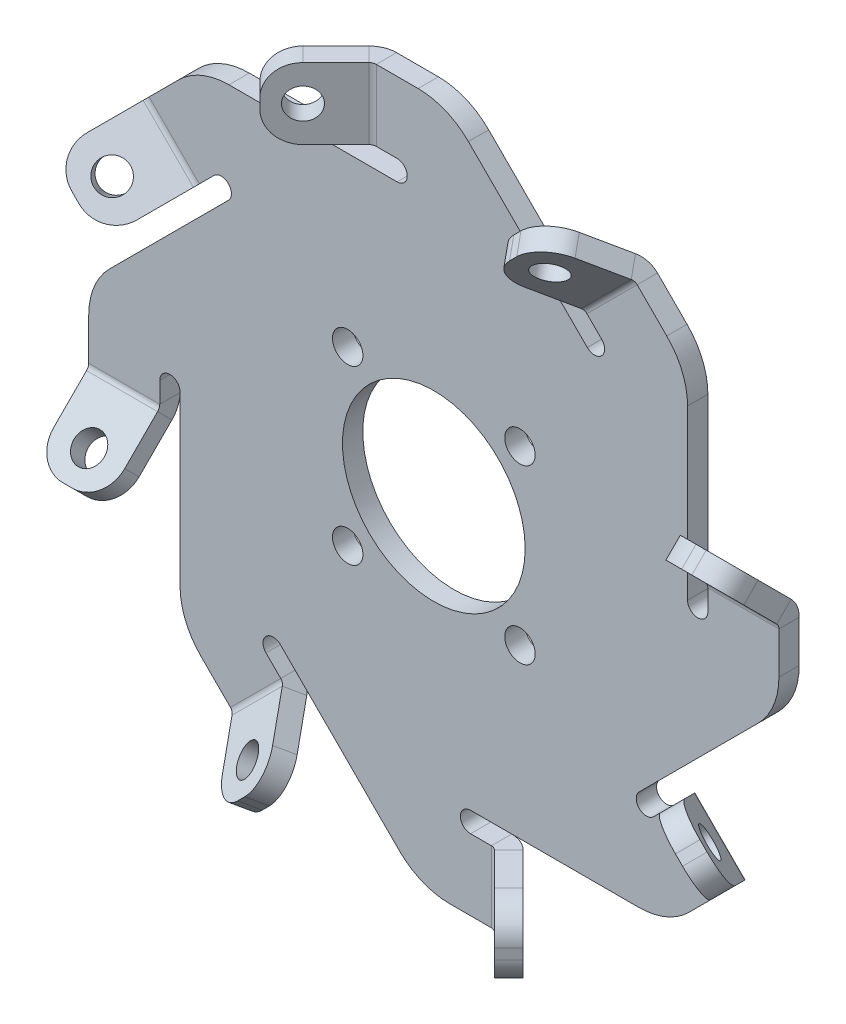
ISO-10303-21;
HEADER;
FILE_DESCRIPTION(('STEP AP214'),'2;1');
FILE_NAME('part.step','',(''),(''),'','','');
FILE_SCHEMA(('AUTOMOTIVE_DESIGN { 1 0 10303 214 1 1 1 1 }'));
ENDSEC;
DATA;
#1=APPLICATION_CONTEXT('core data for automotive mechanical design processes');
#2=APPLICATION_PROTOCOL_DEFINITION('international standard','automotive_design',2000,#1);
#3=PRODUCT_CONTEXT('',#1,'mechanical');
#4=PRODUCT('Part','Part','',(#3));
#5=PRODUCT_RELATED_PRODUCT_CATEGORY('part','',(#4));
#6=PRODUCT_DEFINITION_FORMATION('','',#4);
#7=PRODUCT_DEFINITION_CONTEXT('part definition',#1,'design');
#8=PRODUCT_DEFINITION('design','',#6,#7);
#9=PRODUCT_DEFINITION_SHAPE('','',#8);
#10=(LENGTH_UNIT() NAMED_UNIT(*) SI_UNIT(.MILLI.,.METRE.));
#11=(NAMED_UNIT(*) PLANE_ANGLE_UNIT() SI_UNIT($,.RADIAN.));
#12=(NAMED_UNIT(*) SI_UNIT($,.STERADIAN.) SOLID_ANGLE_UNIT());
#13=UNCERTAINTY_MEASURE_WITH_UNIT(LENGTH_MEASURE(1.E-05),#10,'distance_accuracy_value','');
#14=(GEOMETRIC_REPRESENTATION_CONTEXT(3) GLOBAL_UNCERTAINTY_ASSIGNED_CONTEXT((#13)) GLOBAL_UNIT_ASSIGNED_CONTEXT((#10,
#11,#12)) REPRESENTATION_CONTEXT('',''));
#15=CARTESIAN_POINT('',(0.,0.,0.));
#16=DIRECTION('',(0.,0.,1.));
#17=DIRECTION('',(1.,0.,0.));
#18=AXIS2_PLACEMENT_3D('',#15,#16,#17);
#19=CARTESIAN_POINT('',(-22.9497474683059,-25.1335136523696,-2.));
#20=DIRECTION('',(-0.707106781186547,-0.707106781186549,0.));
#21=DIRECTION('',(0.707106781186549,-0.707106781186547,0.));
#22=AXIS2_PLACEMENT_3D('',#19,#20,#21);
#23=PLANE('',#22);
#24=DIRECTION('',(0.707106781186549,-0.707106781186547,0.));
#25=VECTOR('',#24,1.);
#26=CARTESIAN_POINT('',(-22.9497474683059,-25.1335136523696,-2.));
#27=LINE('',#26,#25);
#28=CARTESIAN_POINT('',(-22.9497474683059,-25.1335136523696,-2.));
#29=VERTEX_POINT('',#28);
#30=CARTESIAN_POINT('',(-20.0337216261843,-28.0495394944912,-2.));
#31=VERTEX_POINT('',#30);
#32=EDGE_CURVE('E1240',#29,#31,#27,.T.);
#33=ORIENTED_EDGE('',*,*,#32,.T.);
#34=DIRECTION('',(0.,0.,1.));
#35=VECTOR('',#34,1.);
#36=CARTESIAN_POINT('',(-20.0337216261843,-28.0495394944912,-2.00000000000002));
#37=LINE('',#36,#35);
#38=CARTESIAN_POINT('',(-20.0337216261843,-28.0495394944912,0.));
#39=VERTEX_POINT('',#38);
#40=EDGE_CURVE('E12',#31,#39,#37,.T.);
#41=ORIENTED_EDGE('',*,*,#40,.T.);
#42=DIRECTION('',(0.707106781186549,-0.707106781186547,0.));
#43=VECTOR('',#42,1.);
#44=CARTESIAN_POINT('',(-22.9497474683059,-25.1335136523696,0.));
#45=LINE('',#44,#43);
#46=CARTESIAN_POINT('',(-22.9497474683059,-25.1335136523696,0.));
#47=VERTEX_POINT('',#46);
#48=EDGE_CURVE('E1322',#47,#39,#45,.T.);
#49=ORIENTED_EDGE('',*,*,#48,.F.);
#50=DIRECTION('',(0.,0.,1.));
#51=VECTOR('',#50,1.);
#52=CARTESIAN_POINT('',(-22.9497474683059,-25.1335136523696,-2.));
#53=LINE('',#52,#51);
#54=EDGE_CURVE('E1390',#29,#47,#53,.T.);
#55=ORIENTED_EDGE('',*,*,#54,.F.);
#56=EDGE_LOOP('',(#33,#41,#49,#55));
#57=FACE_BOUND('',#56,.T.);
#58=ADVANCED_FACE('F73',(#57),#23,.T.);
#59=CARTESIAN_POINT('',(-16.5335430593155,-21.6502231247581,-2.));
#60=DIRECTION('',(0.707106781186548,0.707106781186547,0.));
#61=DIRECTION('',(-0.707106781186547,0.707106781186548,0.));
#62=AXIS2_PLACEMENT_3D('',#59,#60,#61);
#63=PLANE('',#62);
#64=DIRECTION('',(-0.707106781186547,0.707106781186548,0.));
#65=VECTOR('',#64,1.);
#66=CARTESIAN_POINT('',(-16.5335430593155,-21.6502231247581,0.));
#67=LINE('',#66,#65);
#68=CARTESIAN_POINT('',(-15.0839741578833,-23.0997920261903,0.));
#69=VERTEX_POINT('',#68);
#70=CARTESIAN_POINT('',(-16.5335430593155,-21.6502231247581,0.));
#71=VERTEX_POINT('',#70);
#72=EDGE_CURVE('E1327',#69,#71,#67,.T.);
#73=ORIENTED_EDGE('',*,*,#72,.F.);
#74=DIRECTION('',(0.,0.,-1.));
#75=VECTOR('',#74,1.);
#76=CARTESIAN_POINT('',(-15.0839741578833,-23.0997920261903,-2.00000000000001));
#77=LINE('',#76,#75);
#78=CARTESIAN_POINT('',(-15.0839741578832,-23.0997920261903,-2.));
#79=VERTEX_POINT('',#78);
#80=EDGE_CURVE('E1558',#69,#79,#77,.T.);
#81=ORIENTED_EDGE('',*,*,#80,.T.);
#82=DIRECTION('',(-0.707106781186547,0.707106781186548,0.));
#83=VECTOR('',#82,1.);
#84=CARTESIAN_POINT('',(-16.5335430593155,-21.6502231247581,-2.));
#85=LINE('',#84,#83);
#86=CARTESIAN_POINT('',(-16.5335430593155,-21.6502231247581,-2.));
#87=VERTEX_POINT('',#86);
#88=EDGE_CURVE('E76',#79,#87,#85,.T.);
#89=ORIENTED_EDGE('',*,*,#88,.T.);
#90=DIRECTION('',(0.,0.,1.));
#91=VECTOR('',#90,1.);
#92=CARTESIAN_POINT('',(-16.5335430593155,-21.6502231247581,-2.));
#93=LINE('',#92,#91);
#94=EDGE_CURVE('E1387',#87,#71,#93,.T.);
#95=ORIENTED_EDGE('',*,*,#94,.T.);
#96=EDGE_LOOP('',(#73,#81,#89,#95));
#97=FACE_BOUND('',#96,.T.);
#98=ADVANCED_FACE('F1589',(#97),#63,.T.);
#99=CARTESIAN_POINT('',(26.,3.61803917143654,0.));
#100=DIRECTION('',(0.,0.,1.));
#101=DIRECTION('',(1.,0.,0.));
#102=AXIS2_PLACEMENT_3D('',#99,#100,#101);
#103=PLANE('',#102);
#104=CARTESIAN_POINT('',(-8.48528137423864,-8.4852813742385,0.));
#105=DIRECTION('',(0.,0.,1.));
#106=DIRECTION('',(1.,0.,0.));
#107=AXIS2_PLACEMENT_3D('',#104,#105,#106);
#108=CIRCLE('',#107,1.5);
#109=CARTESIAN_POINT('',(-6.98528137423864,-8.4852813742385,0.));
#110=VERTEX_POINT('',#109);
#111=EDGE_CURVE('E1157',#110,#110,#108,.T.);
#112=ORIENTED_EDGE('',*,*,#111,.F.);
#113=EDGE_LOOP('',(#112));
#114=FACE_BOUND('',#113,.T.);
#115=CARTESIAN_POINT('',(8.48528137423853,-8.48528137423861,0.));
#116=DIRECTION('',(0.,0.,1.));
#117=DIRECTION('',(1.,0.,0.));
#118=AXIS2_PLACEMENT_3D('',#115,#116,#117);
#119=CIRCLE('',#118,1.5);
#120=CARTESIAN_POINT('',(9.98528137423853,-8.48528137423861,0.));
#121=VERTEX_POINT('',#120);
#122=EDGE_CURVE('E1164',#121,#121,#119,.T.);
#123=ORIENTED_EDGE('',*,*,#122,.F.);
#124=EDGE_LOOP('',(#123));
#125=FACE_BOUND('',#124,.T.);
#126=CARTESIAN_POINT('',(8.48528137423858,8.48528137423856,0.));
#127=DIRECTION('',(0.,0.,1.));
#128=DIRECTION('',(1.,0.,0.));
#129=AXIS2_PLACEMENT_3D('',#126,#127,#128);
#130=CIRCLE('',#129,1.5);
#131=CARTESIAN_POINT('',(9.98528137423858,8.48528137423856,0.));
#132=VERTEX_POINT('',#131);
#133=EDGE_CURVE('E1170',#132,#132,#130,.T.);
#134=ORIENTED_EDGE('',*,*,#133,.F.);
#135=EDGE_LOOP('',(#134));
#136=FACE_BOUND('',#135,.T.);
#137=CARTESIAN_POINT('',(-8.48528137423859,8.48528137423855,0.));
#138=DIRECTION('',(0.,0.,1.));
#139=DIRECTION('',(1.,0.,0.));
#140=AXIS2_PLACEMENT_3D('',#137,#138,#139);
#141=CIRCLE('',#140,1.5);
#142=CARTESIAN_POINT('',(-6.98528137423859,8.48528137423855,0.));
#143=VERTEX_POINT('',#142);
#144=EDGE_CURVE('E1176',#143,#143,#141,.T.);
#145=ORIENTED_EDGE('',*,*,#144,.F.);
#146=EDGE_LOOP('',(#145));
#147=FACE_BOUND('',#146,.T.);
#148=CARTESIAN_POINT('',(0.,0.,0.));
#149=DIRECTION('',(0.,0.,1.));
#150=DIRECTION('',(1.,0.,0.));
#151=AXIS2_PLACEMENT_3D('',#148,#149,#150);
#152=CIRCLE('',#151,9.);
#153=CARTESIAN_POINT('',(9.,0.,0.));
#154=VERTEX_POINT('',#153);
#155=EDGE_CURVE('E1182',#154,#154,#152,.T.);
#156=ORIENTED_EDGE('',*,*,#155,.F.);
#157=EDGE_LOOP('',(#156));
#158=FACE_BOUND('',#157,.T.);
#159=ORIENTED_EDGE('',*,*,#48,.T.);
#160=DIRECTION('',(0.707106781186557,0.707106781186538,0.));
#161=VECTOR('',#160,1.);
#162=CARTESIAN_POINT('',(18.8169285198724,10.8011106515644,0.));
#163=LINE('',#162,#161);
#164=EDGE_CURVE('E81',#39,#69,#163,.T.);
#165=ORIENTED_EDGE('',*,*,#164,.T.);
#166=ORIENTED_EDGE('',*,*,#72,.T.);
#167=CARTESIAN_POINT('',(-15.8264362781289,-20.9431163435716,0.));
#168=DIRECTION('',(0.,0.,-1.));
#169=DIRECTION('',(1.,0.,0.));
#170=AXIS2_PLACEMENT_3D('',#167,#168,#169);
#171=CIRCLE('',#170,1.);
#172=CARTESIAN_POINT('',(-15.1193294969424,-20.236009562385,0.));
#173=VERTEX_POINT('',#172);
#174=EDGE_CURVE('E1323',#71,#173,#171,.T.);
#175=ORIENTED_EDGE('',*,*,#174,.T.);
#176=DIRECTION('',(0.707106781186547,-0.707106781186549,0.));
#177=VECTOR('',#176,1.);
#178=CARTESIAN_POINT('',(-10.3553390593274,-25.,0.));
#179=LINE('',#178,#177);
#180=CARTESIAN_POINT('',(-3.4055915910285,-31.9497474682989,0.));
#181=VERTEX_POINT('',#180);
#182=EDGE_CURVE('E1326',#173,#181,#179,.T.);
#183=ORIENTED_EDGE('',*,*,#182,.T.);
#184=CARTESIAN_POINT('',(1.54415587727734,-26.9999999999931,0.));
#185=DIRECTION('',(0.,0.,1.));
#186=DIRECTION('',(1.,0.,0.));
#187=AXIS2_PLACEMENT_3D('',#184,#185,#186);
#188=CIRCLE('',#187,7.);
#189=CARTESIAN_POINT('',(1.54415587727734,-33.9999999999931,0.));
#190=VERTEX_POINT('',#189);
#191=EDGE_CURVE('E1330',#181,#190,#188,.T.);
#192=ORIENTED_EDGE('',*,*,#191,.T.);
#193=DIRECTION('',(1.,0.,0.));
#194=VECTOR('',#193,1.);
#195=CARTESIAN_POINT('',(1.54415587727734,-33.9999999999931,0.));
#196=LINE('',#195,#194);
#197=CARTESIAN_POINT('',(5.66803917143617,-33.9999999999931,0.));
#198=VERTEX_POINT('',#197);
#199=EDGE_CURVE('E1333',#190,#198,#196,.T.);
#200=ORIENTED_EDGE('',*,*,#199,.T.);
#201=DIRECTION('',(0.,1.,0.));
#202=VECTOR('',#201,1.);
#203=CARTESIAN_POINT('',(5.66803917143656,3.61803917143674,0.));
#204=LINE('',#203,#202);
#205=CARTESIAN_POINT('',(5.66803917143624,-27.,0.));
#206=VERTEX_POINT('',#205);
#207=EDGE_CURVE('E1544',#198,#206,#204,.T.);
#208=ORIENTED_EDGE('',*,*,#207,.T.);
#209=DIRECTION('',(-1.,0.,0.));
#210=VECTOR('',#209,1.);
#211=CARTESIAN_POINT('',(3.61803917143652,-27.,0.));
#212=LINE('',#211,#210);
#213=CARTESIAN_POINT('',(3.61803917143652,-27.,0.));
#214=VERTEX_POINT('',#213);
#215=EDGE_CURVE('E1338',#206,#214,#212,.T.);
#216=ORIENTED_EDGE('',*,*,#215,.T.);
#217=CARTESIAN_POINT('',(3.61803917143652,-26.,0.));
#218=DIRECTION('',(0.,0.,-1.));
#219=DIRECTION('',(1.,0.,0.));
#220=AXIS2_PLACEMENT_3D('',#217,#218,#219);
#221=CIRCLE('',#220,1.);
#222=CARTESIAN_POINT('',(3.61803917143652,-25.,0.));
#223=VERTEX_POINT('',#222);
#224=EDGE_CURVE('E1334',#214,#223,#221,.T.);
#225=ORIENTED_EDGE('',*,*,#224,.T.);
#226=DIRECTION('',(1.,0.,0.));
#227=VECTOR('',#226,1.);
#228=CARTESIAN_POINT('',(10.3553390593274,-25.,0.));
#229=LINE('',#228,#227);
#230=CARTESIAN_POINT('',(20.1837661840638,-25.,0.));
#231=VERTEX_POINT('',#230);
#232=EDGE_CURVE('E1337',#223,#231,#229,.T.);
#233=ORIENTED_EDGE('',*,*,#232,.T.);
#234=CARTESIAN_POINT('',(20.1837661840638,-18.,0.));
#235=DIRECTION('',(0.,0.,1.));
#236=DIRECTION('',(1.,0.,0.));
#237=AXIS2_PLACEMENT_3D('',#234,#235,#236);
#238=CIRCLE('',#237,7.);
#239=CARTESIAN_POINT('',(25.1335136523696,-22.9497474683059,0.));
#240=VERTEX_POINT('',#239);
#241=EDGE_CURVE('E1341',#231,#240,#238,.T.);
#242=ORIENTED_EDGE('',*,*,#241,.T.);
#243=DIRECTION('',(0.707106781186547,0.707106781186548,0.));
#244=VECTOR('',#243,1.);
#245=CARTESIAN_POINT('',(25.1335136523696,-22.9497474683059,0.));
#246=LINE('',#245,#244);
#247=CARTESIAN_POINT('',(28.0495394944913,-20.0337216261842,0.));
#248=VERTEX_POINT('',#247);
#249=EDGE_CURVE('E1344',#240,#248,#246,.T.);
#250=ORIENTED_EDGE('',*,*,#249,.T.);
#251=DIRECTION('',(-0.707106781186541,0.707106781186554,0.));
#252=VECTOR('',#251,1.);
#253=CARTESIAN_POINT('',(15.1988893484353,-7.18307148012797,0.));
#254=LINE('',#253,#252);
#255=CARTESIAN_POINT('',(23.0997920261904,-15.0839741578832,0.));
#256=VERTEX_POINT('',#255);
#257=EDGE_CURVE('E1527',#248,#256,#254,.T.);
#258=ORIENTED_EDGE('',*,*,#257,.T.);
#259=DIRECTION('',(-0.707106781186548,-0.707106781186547,0.));
#260=VECTOR('',#259,1.);
#261=CARTESIAN_POINT('',(21.6502231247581,-16.5335430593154,0.));
#262=LINE('',#261,#260);
#263=CARTESIAN_POINT('',(21.6502231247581,-16.5335430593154,0.));
#264=VERTEX_POINT('',#263);
#265=EDGE_CURVE('E1349',#256,#264,#262,.T.);
#266=ORIENTED_EDGE('',*,*,#265,.T.);
#267=CARTESIAN_POINT('',(20.9431163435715,-15.8264362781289,0.));
#268=DIRECTION('',(0.,0.,-1.));
#269=DIRECTION('',(1.,0.,0.));
#270=AXIS2_PLACEMENT_3D('',#267,#268,#269);
#271=CIRCLE('',#270,1.);
#272=CARTESIAN_POINT('',(20.236009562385,-15.1193294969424,0.));
#273=VERTEX_POINT('',#272);
#274=EDGE_CURVE('E1345',#264,#273,#271,.T.);
#275=ORIENTED_EDGE('',*,*,#274,.T.);
#276=DIRECTION('',(0.707106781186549,0.707106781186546,0.));
#277=VECTOR('',#276,1.);
#278=CARTESIAN_POINT('',(25.,-10.3553390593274,0.));
#279=LINE('',#278,#277);
#280=CARTESIAN_POINT('',(31.9497474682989,-3.40559159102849,0.));
#281=VERTEX_POINT('',#280);
#282=EDGE_CURVE('E1348',#273,#281,#279,.T.);
#283=ORIENTED_EDGE('',*,*,#282,.T.);
#284=CARTESIAN_POINT('',(26.9999999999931,1.54415587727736,0.));
#285=DIRECTION('',(0.,0.,1.));
#286=DIRECTION('',(1.,0.,0.));
#287=AXIS2_PLACEMENT_3D('',#284,#285,#286);
#288=CIRCLE('',#287,7.00000000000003);
#289=CARTESIAN_POINT('',(33.9999999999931,1.54415587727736,0.));
#290=VERTEX_POINT('',#289);
#291=EDGE_CURVE('E1352',#281,#290,#288,.T.);
#292=ORIENTED_EDGE('',*,*,#291,.T.);
#293=DIRECTION('',(0.,1.,0.));
#294=VECTOR('',#293,1.);
#295=CARTESIAN_POINT('',(33.9999999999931,1.54415587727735,0.));
#296=LINE('',#295,#294);
#297=CARTESIAN_POINT('',(33.9999999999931,5.6680391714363,0.));
#298=VERTEX_POINT('',#297);
#299=EDGE_CURVE('E1355',#290,#298,#296,.T.);
#300=ORIENTED_EDGE('',*,*,#299,.T.);
#301=DIRECTION('',(-1.,0.,0.));
#302=VECTOR('',#301,1.);
#303=CARTESIAN_POINT('',(26.,5.66803917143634,0.));
#304=LINE('',#303,#302);
#305=CARTESIAN_POINT('',(27.,5.66803917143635,0.));
#306=VERTEX_POINT('',#305);
#307=EDGE_CURVE('E1510',#298,#306,#304,.T.);
#308=ORIENTED_EDGE('',*,*,#307,.T.);
#309=DIRECTION('',(0.,-1.,0.));
#310=VECTOR('',#309,1.);
#311=CARTESIAN_POINT('',(27.,3.61803917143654,0.));
#312=LINE('',#311,#310);
#313=CARTESIAN_POINT('',(27.,3.61803917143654,0.));
#314=VERTEX_POINT('',#313);
#315=EDGE_CURVE('E1195',#306,#314,#312,.T.);
#316=ORIENTED_EDGE('',*,*,#315,.T.);
#317=CARTESIAN_POINT('',(26.,3.61803917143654,0.));
#318=DIRECTION('',(0.,0.,-1.));
#319=DIRECTION('',(1.,0.,0.));
#320=AXIS2_PLACEMENT_3D('',#317,#318,#319);
#321=CIRCLE('',#320,1.);
#322=CARTESIAN_POINT('',(25.,3.61803917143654,0.));
#323=VERTEX_POINT('',#322);
#324=EDGE_CURVE('E1188',#314,#323,#321,.T.);
#325=ORIENTED_EDGE('',*,*,#324,.T.);
#326=DIRECTION('',(0.,1.,0.));
#327=VECTOR('',#326,1.);
#328=CARTESIAN_POINT('',(25.,10.3553390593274,0.));
#329=LINE('',#328,#327);
#330=CARTESIAN_POINT('',(25.,20.1837661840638,0.));
#331=VERTEX_POINT('',#330);
#332=EDGE_CURVE('E1272',#323,#331,#329,.T.);
#333=ORIENTED_EDGE('',*,*,#332,.T.);
#334=CARTESIAN_POINT('',(18.,20.1837661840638,0.));
#335=DIRECTION('',(0.,0.,1.));
#336=DIRECTION('',(1.,0.,0.));
#337=AXIS2_PLACEMENT_3D('',#334,#335,#336);
#338=CIRCLE('',#337,7.);
#339=CARTESIAN_POINT('',(22.9497474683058,25.1335136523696,0.));
#340=VERTEX_POINT('',#339);
#341=EDGE_CURVE('E1275',#331,#340,#338,.T.);
#342=ORIENTED_EDGE('',*,*,#341,.T.);
#343=DIRECTION('',(-0.707106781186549,0.707106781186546,0.));
#344=VECTOR('',#343,1.);
#345=CARTESIAN_POINT('',(22.9497474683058,25.1335136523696,0.));
#346=LINE('',#345,#344);
#347=CARTESIAN_POINT('',(20.0337216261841,28.0495394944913,0.));
#348=VERTEX_POINT('',#347);
#349=EDGE_CURVE('E1278',#340,#348,#346,.T.);
#350=ORIENTED_EDGE('',*,*,#349,.T.);
#351=DIRECTION('',(-0.707106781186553,-0.707106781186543,0.));
#352=VECTOR('',#351,1.);
#353=CARTESIAN_POINT('',(10.8011106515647,18.8169285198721,0.));
#354=LINE('',#353,#352);
#355=CARTESIAN_POINT('',(15.0839741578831,23.0997920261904,0.));
#356=VERTEX_POINT('',#355);
#357=EDGE_CURVE('E1493',#348,#356,#354,.T.);
#358=ORIENTED_EDGE('',*,*,#357,.T.);
#359=DIRECTION('',(0.707106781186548,-0.707106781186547,0.));
#360=VECTOR('',#359,1.);
#361=CARTESIAN_POINT('',(16.5335430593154,21.6502231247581,0.));
#362=LINE('',#361,#360);
#363=CARTESIAN_POINT('',(16.5335430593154,21.6502231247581,0.));
#364=VERTEX_POINT('',#363);
#365=EDGE_CURVE('E1283',#356,#364,#362,.T.);
#366=ORIENTED_EDGE('',*,*,#365,.T.);
#367=CARTESIAN_POINT('',(15.8264362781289,20.9431163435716,0.));
#368=DIRECTION('',(0.,0.,-1.));
#369=DIRECTION('',(1.,0.,0.));
#370=AXIS2_PLACEMENT_3D('',#367,#368,#369);
#371=CIRCLE('',#370,1.);
#372=CARTESIAN_POINT('',(15.1193294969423,20.236009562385,0.));
#373=VERTEX_POINT('',#372);
#374=EDGE_CURVE('E1279',#364,#373,#371,.T.);
#375=ORIENTED_EDGE('',*,*,#374,.T.);
#376=DIRECTION('',(-0.707106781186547,0.707106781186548,0.));
#377=VECTOR('',#376,1.);
#378=CARTESIAN_POINT('',(10.3553390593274,25.,0.));
#379=LINE('',#378,#377);
#380=CARTESIAN_POINT('',(3.40559159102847,31.9497474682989,0.));
#381=VERTEX_POINT('',#380);
#382=EDGE_CURVE('E1282',#373,#381,#379,.T.);
#383=ORIENTED_EDGE('',*,*,#382,.T.);
#384=CARTESIAN_POINT('',(-1.54415587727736,26.9999999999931,0.));
#385=DIRECTION('',(0.,0.,1.));
#386=DIRECTION('',(1.,0.,0.));
#387=AXIS2_PLACEMENT_3D('',#384,#385,#386);
#388=CIRCLE('',#387,7.);
#389=CARTESIAN_POINT('',(-1.54415587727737,33.9999999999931,0.));
#390=VERTEX_POINT('',#389);
#391=EDGE_CURVE('E1286',#381,#390,#388,.T.);
#392=ORIENTED_EDGE('',*,*,#391,.T.);
#393=DIRECTION('',(-1.,0.,0.));
#394=VECTOR('',#393,1.);
#395=CARTESIAN_POINT('',(-1.54415587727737,33.9999999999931,0.));
#396=LINE('',#395,#394);
#397=CARTESIAN_POINT('',(-5.66803917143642,33.9999999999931,0.));
#398=VERTEX_POINT('',#397);
#399=EDGE_CURVE('E1289',#390,#398,#396,.T.);
#400=ORIENTED_EDGE('',*,*,#399,.T.);
#401=DIRECTION('',(0.,-1.,0.));
#402=VECTOR('',#401,1.);
#403=CARTESIAN_POINT('',(-5.66803917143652,3.61803917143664,0.));
#404=LINE('',#403,#402);
#405=CARTESIAN_POINT('',(-5.66803917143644,27.,0.));
#406=VERTEX_POINT('',#405);
#407=EDGE_CURVE('E1476',#398,#406,#404,.T.);
#408=ORIENTED_EDGE('',*,*,#407,.T.);
#409=DIRECTION('',(1.,0.,0.));
#410=VECTOR('',#409,1.);
#411=CARTESIAN_POINT('',(-3.61803917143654,27.,0.));
#412=LINE('',#411,#410);
#413=CARTESIAN_POINT('',(-3.61803917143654,27.,0.));
#414=VERTEX_POINT('',#413);
#415=EDGE_CURVE('E1294',#406,#414,#412,.T.);
#416=ORIENTED_EDGE('',*,*,#415,.T.);
#417=CARTESIAN_POINT('',(-3.61803917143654,26.,0.));
#418=DIRECTION('',(0.,0.,-1.));
#419=DIRECTION('',(1.,0.,0.));
#420=AXIS2_PLACEMENT_3D('',#417,#418,#419);
#421=CIRCLE('',#420,1.);
#422=CARTESIAN_POINT('',(-3.61803917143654,25.,0.));
#423=VERTEX_POINT('',#422);
#424=EDGE_CURVE('E1290',#414,#423,#421,.T.);
#425=ORIENTED_EDGE('',*,*,#424,.T.);
#426=DIRECTION('',(-1.,0.,0.));
#427=VECTOR('',#426,1.);
#428=CARTESIAN_POINT('',(-10.3553390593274,25.,0.));
#429=LINE('',#428,#427);
#430=CARTESIAN_POINT('',(-20.1837661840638,25.,0.));
#431=VERTEX_POINT('',#430);
#432=EDGE_CURVE('E1293',#423,#431,#429,.T.);
#433=ORIENTED_EDGE('',*,*,#432,.T.);
#434=CARTESIAN_POINT('',(-20.1837661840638,18.,0.));
#435=DIRECTION('',(0.,0.,1.));
#436=DIRECTION('',(1.,0.,0.));
#437=AXIS2_PLACEMENT_3D('',#434,#435,#436);
#438=CIRCLE('',#437,7.);
#439=CARTESIAN_POINT('',(-25.1335136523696,22.9497474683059,0.));
#440=VERTEX_POINT('',#439);
#441=EDGE_CURVE('E1297',#431,#440,#438,.T.);
#442=ORIENTED_EDGE('',*,*,#441,.T.);
#443=DIRECTION('',(-0.707106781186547,-0.707106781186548,0.));
#444=VECTOR('',#443,1.);
#445=CARTESIAN_POINT('',(-25.1335136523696,22.9497474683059,0.));
#446=LINE('',#445,#444);
#447=CARTESIAN_POINT('',(-28.0495394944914,20.033721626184,0.));
#448=VERTEX_POINT('',#447);
#449=EDGE_CURVE('E1300',#440,#448,#446,.T.);
#450=ORIENTED_EDGE('',*,*,#449,.T.);
#451=DIRECTION('',(0.707106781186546,-0.707106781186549,0.));
#452=VECTOR('',#451,1.);
#453=CARTESIAN_POINT('',(7.18307148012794,-15.1988893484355,0.));
#454=LINE('',#453,#452);
#455=CARTESIAN_POINT('',(-23.0997920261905,15.0839741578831,0.));
#456=VERTEX_POINT('',#455);
#457=EDGE_CURVE('E1459',#448,#456,#454,.T.);
#458=ORIENTED_EDGE('',*,*,#457,.T.);
#459=DIRECTION('',(0.707106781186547,0.707106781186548,0.));
#460=VECTOR('',#459,1.);
#461=CARTESIAN_POINT('',(-21.6502231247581,16.5335430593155,0.));
#462=LINE('',#461,#460);
#463=CARTESIAN_POINT('',(-21.6502231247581,16.5335430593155,0.));
#464=VERTEX_POINT('',#463);
#465=EDGE_CURVE('E1305',#456,#464,#462,.T.);
#466=ORIENTED_EDGE('',*,*,#465,.T.);
#467=CARTESIAN_POINT('',(-20.9431163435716,15.8264362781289,0.));
#468=DIRECTION('',(0.,0.,-1.));
#469=DIRECTION('',(1.,0.,0.));
#470=AXIS2_PLACEMENT_3D('',#467,#468,#469);
#471=CIRCLE('',#470,1.);
#472=CARTESIAN_POINT('',(-20.236009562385,15.1193294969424,0.));
#473=VERTEX_POINT('',#472);
#474=EDGE_CURVE('E1301',#464,#473,#471,.T.);
#475=ORIENTED_EDGE('',*,*,#474,.T.);
#476=DIRECTION('',(-0.707106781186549,-0.707106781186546,0.));
#477=VECTOR('',#476,1.);
#478=CARTESIAN_POINT('',(-25.,10.3553390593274,0.));
#479=LINE('',#478,#477);
#480=CARTESIAN_POINT('',(-31.9497474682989,3.40559159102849,0.));
#481=VERTEX_POINT('',#480);
#482=EDGE_CURVE('E1304',#473,#481,#479,.T.);
#483=ORIENTED_EDGE('',*,*,#482,.T.);
#484=CARTESIAN_POINT('',(-26.9999999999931,-1.54415587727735,0.));
#485=DIRECTION('',(0.,0.,1.));
#486=DIRECTION('',(1.,0.,0.));
#487=AXIS2_PLACEMENT_3D('',#484,#485,#486);
#488=CIRCLE('',#487,7.);
#489=CARTESIAN_POINT('',(-33.9999999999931,-1.54415587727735,0.));
#490=VERTEX_POINT('',#489);
#491=EDGE_CURVE('E1308',#481,#490,#488,.T.);
#492=ORIENTED_EDGE('',*,*,#491,.T.);
#493=DIRECTION('',(0.,-1.,0.));
#494=VECTOR('',#493,1.);
#495=CARTESIAN_POINT('',(-33.9999999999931,-1.54415587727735,0.));
#496=LINE('',#495,#494);
#497=CARTESIAN_POINT('',(-33.9999999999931,-5.66803917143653,0.));
#498=VERTEX_POINT('',#497);
#499=EDGE_CURVE('E1311',#490,#498,#496,.T.);
#500=ORIENTED_EDGE('',*,*,#499,.T.);
#501=DIRECTION('',(1.,0.,0.));
#502=VECTOR('',#501,1.);
#503=CARTESIAN_POINT('',(26.,-5.66803917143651,0.));
#504=LINE('',#503,#502);
#505=CARTESIAN_POINT('',(-27.,-5.66803917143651,0.));
#506=VERTEX_POINT('',#505);
#507=EDGE_CURVE('E1442',#498,#506,#504,.T.);
#508=ORIENTED_EDGE('',*,*,#507,.T.);
#509=DIRECTION('',(0.,1.,0.));
#510=VECTOR('',#509,1.);
#511=CARTESIAN_POINT('',(-27.,-3.61803917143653,0.));
#512=LINE('',#511,#510);
#513=CARTESIAN_POINT('',(-27.,-3.61803917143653,0.));
#514=VERTEX_POINT('',#513);
#515=EDGE_CURVE('E1316',#506,#514,#512,.T.);
#516=ORIENTED_EDGE('',*,*,#515,.T.);
#517=CARTESIAN_POINT('',(-26.,-3.61803917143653,0.));
#518=DIRECTION('',(0.,0.,-1.));
#519=DIRECTION('',(1.,0.,0.));
#520=AXIS2_PLACEMENT_3D('',#517,#518,#519);
#521=CIRCLE('',#520,1.);
#522=CARTESIAN_POINT('',(-25.,-3.61803917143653,0.));
#523=VERTEX_POINT('',#522);
#524=EDGE_CURVE('E1312',#514,#523,#521,.T.);
#525=ORIENTED_EDGE('',*,*,#524,.T.);
#526=DIRECTION('',(0.,-1.,0.));
#527=VECTOR('',#526,1.);
#528=CARTESIAN_POINT('',(-25.,-10.3553390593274,0.));
#529=LINE('',#528,#527);
#530=CARTESIAN_POINT('',(-25.,-20.1837661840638,0.));
#531=VERTEX_POINT('',#530);
#532=EDGE_CURVE('E1315',#523,#531,#529,.T.);
#533=ORIENTED_EDGE('',*,*,#532,.T.);
#534=CARTESIAN_POINT('',(-18.,-20.1837661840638,0.));
#535=DIRECTION('',(0.,0.,1.));
#536=DIRECTION('',(1.,0.,0.));
#537=AXIS2_PLACEMENT_3D('',#534,#535,#536);
#538=CIRCLE('',#537,7.);
#539=EDGE_CURVE('E1319',#531,#47,#538,.T.);
#540=ORIENTED_EDGE('',*,*,#539,.T.);
#541=EDGE_LOOP('',(#159,#165,#166,#175,#183,#192,#200,#208,#216,#225,#233,#242,#250,#258,#266,
#275,#283,#292,#300,#308,#316,#325,#333,#342,#350,#358,#366,#375,#383,#392,#400,#408,#416,#425,
#433,#442,#450,#458,#466,#475,#483,#492,#500,#508,#516,#525,#533,#540));
#542=FACE_BOUND('',#541,.T.);
#543=ADVANCED_FACE('F1568',(#114,#125,#136,#147,#158,#542),#103,.T.);
#544=CARTESIAN_POINT('',(1.54415587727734,-33.9999999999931,-2.));
#545=DIRECTION('',(0.,-1.,0.));
#546=DIRECTION('',(1.,0.,0.));
#547=AXIS2_PLACEMENT_3D('',#544,#545,#546);
#548=PLANE('',#547);
#549=DIRECTION('',(1.,0.,0.));
#550=VECTOR('',#549,1.);
#551=CARTESIAN_POINT('',(1.54415587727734,-33.9999999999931,-2.));
#552=LINE('',#551,#550);
#553=CARTESIAN_POINT('',(1.54415587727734,-33.9999999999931,-2.));
#554=VERTEX_POINT('',#553);
#555=CARTESIAN_POINT('',(5.66803917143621,-33.9999999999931,-2.));
#556=VERTEX_POINT('',#555);
#557=EDGE_CURVE('E1249',#554,#556,#552,.T.);
#558=ORIENTED_EDGE('',*,*,#557,.T.);
#559=DIRECTION('',(0.,0.,1.));
#560=VECTOR('',#559,1.);
#561=CARTESIAN_POINT('',(5.66803917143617,-33.9999999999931,-2.));
#562=LINE('',#561,#560);
#563=EDGE_CURVE('E1547',#556,#198,#562,.T.);
#564=ORIENTED_EDGE('',*,*,#563,.T.);
#565=ORIENTED_EDGE('',*,*,#199,.F.);
#566=DIRECTION('',(0.,0.,1.));
#567=VECTOR('',#566,1.);
#568=CARTESIAN_POINT('',(1.54415587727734,-33.9999999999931,-2.));
#569=LINE('',#568,#567);
#570=EDGE_CURVE('E1380',#554,#190,#569,.T.);
#571=ORIENTED_EDGE('',*,*,#570,.F.);
#572=EDGE_LOOP('',(#558,#564,#565,#571));
#573=FACE_BOUND('',#572,.T.);
#574=ADVANCED_FACE('F1655',(#573),#548,.T.);
#575=CARTESIAN_POINT('',(3.61803917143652,-27.,-2.));
#576=DIRECTION('',(0.,1.,0.));
#577=DIRECTION('',(0.,0.,1.));
#578=AXIS2_PLACEMENT_3D('',#575,#576,#577);
#579=PLANE('',#578);
#580=ORIENTED_EDGE('',*,*,#215,.F.);
#581=DIRECTION('',(0.,0.,-1.));
#582=VECTOR('',#581,1.);
#583=CARTESIAN_POINT('',(5.66803917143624,-27.,-2.));
#584=LINE('',#583,#582);
#585=CARTESIAN_POINT('',(5.66803917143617,-27.,-2.));
#586=VERTEX_POINT('',#585);
#587=EDGE_CURVE('E1541',#206,#586,#584,.T.);
#588=ORIENTED_EDGE('',*,*,#587,.T.);
#589=DIRECTION('',(-1.,0.,0.));
#590=VECTOR('',#589,1.);
#591=CARTESIAN_POINT('',(3.61803917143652,-27.,-2.));
#592=LINE('',#591,#590);
#593=CARTESIAN_POINT('',(3.61803917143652,-27.,-2.));
#594=VERTEX_POINT('',#593);
#595=EDGE_CURVE('E1254',#586,#594,#592,.T.);
#596=ORIENTED_EDGE('',*,*,#595,.T.);
#597=DIRECTION('',(0.,0.,1.));
#598=VECTOR('',#597,1.);
#599=CARTESIAN_POINT('',(3.61803917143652,-27.,-2.));
#600=LINE('',#599,#598);
#601=EDGE_CURVE('E1377',#594,#214,#600,.T.);
#602=ORIENTED_EDGE('',*,*,#601,.T.);
#603=EDGE_LOOP('',(#580,#588,#596,#602));
#604=FACE_BOUND('',#603,.T.);
#605=ADVANCED_FACE('F1664',(#604),#579,.T.);
#606=CARTESIAN_POINT('',(25.1335136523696,-22.9497474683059,-2.));
#607=DIRECTION('',(0.707106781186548,-0.707106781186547,0.));
#608=DIRECTION('',(0.707106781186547,0.707106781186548,0.));
#609=AXIS2_PLACEMENT_3D('',#606,#607,#608);
#610=PLANE('',#609);
#611=DIRECTION('',(0.707106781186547,0.707106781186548,0.));
#612=VECTOR('',#611,1.);
#613=CARTESIAN_POINT('',(25.1335136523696,-22.9497474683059,-2.));
#614=LINE('',#613,#612);
#615=CARTESIAN_POINT('',(25.1335136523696,-22.9497474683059,-2.));
#616=VERTEX_POINT('',#615);
#617=CARTESIAN_POINT('',(28.0495394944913,-20.0337216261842,-2.));
#618=VERTEX_POINT('',#617);
#619=EDGE_CURVE('E1259',#616,#618,#614,.T.);
#620=ORIENTED_EDGE('',*,*,#619,.T.);
#621=DIRECTION('',(0.,0.,1.));
#622=VECTOR('',#621,1.);
#623=CARTESIAN_POINT('',(28.0495394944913,-20.0337216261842,-1.99999999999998));
#624=LINE('',#623,#622);
#625=EDGE_CURVE('E1530',#618,#248,#624,.T.);
#626=ORIENTED_EDGE('',*,*,#625,.T.);
#627=ORIENTED_EDGE('',*,*,#249,.F.);
#628=DIRECTION('',(0.,0.,1.));
#629=VECTOR('',#628,1.);
#630=CARTESIAN_POINT('',(25.1335136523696,-22.9497474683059,-2.));
#631=LINE('',#630,#629);
#632=EDGE_CURVE('E1370',#616,#240,#631,.T.);
#633=ORIENTED_EDGE('',*,*,#632,.F.);
#634=EDGE_LOOP('',(#620,#626,#627,#633));
#635=FACE_BOUND('',#634,.T.);
#636=ADVANCED_FACE('F1668',(#635),#610,.T.);
#637=CARTESIAN_POINT('',(21.6502231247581,-16.5335430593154,-2.));
#638=DIRECTION('',(-0.707106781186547,0.707106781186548,0.));
#639=DIRECTION('',(-0.707106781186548,-0.707106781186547,0.));
#640=AXIS2_PLACEMENT_3D('',#637,#638,#639);
#641=PLANE('',#640);
#642=ORIENTED_EDGE('',*,*,#265,.F.);
#643=DIRECTION('',(0.,0.,-1.));
#644=VECTOR('',#643,1.);
#645=CARTESIAN_POINT('',(23.0997920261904,-15.0839741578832,-1.99999999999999));
#646=LINE('',#645,#644);
#647=CARTESIAN_POINT('',(23.0997920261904,-15.0839741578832,-2.));
#648=VERTEX_POINT('',#647);
#649=EDGE_CURVE('E1524',#256,#648,#646,.T.);
#650=ORIENTED_EDGE('',*,*,#649,.T.);
#651=DIRECTION('',(-0.707106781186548,-0.707106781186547,0.));
#652=VECTOR('',#651,1.);
#653=CARTESIAN_POINT('',(21.6502231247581,-16.5335430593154,-2.));
#654=LINE('',#653,#652);
#655=CARTESIAN_POINT('',(21.6502231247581,-16.5335430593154,-2.));
#656=VERTEX_POINT('',#655);
#657=EDGE_CURVE('E1264',#648,#656,#654,.T.);
#658=ORIENTED_EDGE('',*,*,#657,.T.);
#659=DIRECTION('',(0.,0.,1.));
#660=VECTOR('',#659,1.);
#661=CARTESIAN_POINT('',(21.6502231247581,-16.5335430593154,-2.));
#662=LINE('',#661,#660);
#663=EDGE_CURVE('E1367',#656,#264,#662,.T.);
#664=ORIENTED_EDGE('',*,*,#663,.T.);
#665=EDGE_LOOP('',(#642,#650,#658,#664));
#666=FACE_BOUND('',#665,.T.);
#667=ADVANCED_FACE('F1672',(#666),#641,.T.);
#668=CARTESIAN_POINT('',(33.9999999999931,1.54415587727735,-2.));
#669=DIRECTION('',(1.,0.,0.));
#670=DIRECTION('',(0.,1.,0.));
#671=AXIS2_PLACEMENT_3D('',#668,#669,#670);
#672=PLANE('',#671);
#673=DIRECTION('',(0.,1.,0.));
#674=VECTOR('',#673,1.);
#675=CARTESIAN_POINT('',(33.9999999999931,1.54415587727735,-2.));
#676=LINE('',#675,#674);
#677=CARTESIAN_POINT('',(33.9999999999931,1.54415587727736,-2.));
#678=VERTEX_POINT('',#677);
#679=CARTESIAN_POINT('',(33.9999999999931,5.66803917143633,-2.));
#680=VERTEX_POINT('',#679);
#681=EDGE_CURVE('E1269',#678,#680,#676,.T.);
#682=ORIENTED_EDGE('',*,*,#681,.T.);
#683=DIRECTION('',(0.,0.,1.));
#684=VECTOR('',#683,1.);
#685=CARTESIAN_POINT('',(33.9999999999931,5.6680391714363,-1.99999999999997));
#686=LINE('',#685,#684);
#687=EDGE_CURVE('E1513',#680,#298,#686,.T.);
#688=ORIENTED_EDGE('',*,*,#687,.T.);
#689=ORIENTED_EDGE('',*,*,#299,.F.);
#690=DIRECTION('',(0.,0.,1.));
#691=VECTOR('',#690,1.);
#692=CARTESIAN_POINT('',(33.9999999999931,1.54415587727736,-2.));
#693=LINE('',#692,#691);
#694=EDGE_CURVE('E1360',#678,#290,#693,.T.);
#695=ORIENTED_EDGE('',*,*,#694,.F.);
#696=EDGE_LOOP('',(#682,#688,#689,#695));
#697=FACE_BOUND('',#696,.T.);
#698=ADVANCED_FACE('F1676',(#697),#672,.T.);
#699=CARTESIAN_POINT('',(27.,3.61803917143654,-2.));
#700=DIRECTION('',(-1.,0.,0.));
#701=DIRECTION('',(0.,0.,1.));
#702=AXIS2_PLACEMENT_3D('',#699,#700,#701);
#703=PLANE('',#702);
#704=ORIENTED_EDGE('',*,*,#315,.F.);
#705=DIRECTION('',(0.,0.,-1.));
#706=VECTOR('',#705,1.);
#707=CARTESIAN_POINT('',(27.,5.66803917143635,-1.99999999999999));
#708=LINE('',#707,#706);
#709=CARTESIAN_POINT('',(27.,5.6680391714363,-2.));
#710=VERTEX_POINT('',#709);
#711=EDGE_CURVE('E1507',#306,#710,#708,.T.);
#712=ORIENTED_EDGE('',*,*,#711,.T.);
#713=DIRECTION('',(0.,-1.,0.));
#714=VECTOR('',#713,1.);
#715=CARTESIAN_POINT('',(27.,3.61803917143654,-2.));
#716=LINE('',#715,#714);
#717=CARTESIAN_POINT('',(27.,3.61803917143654,-2.));
#718=VERTEX_POINT('',#717);
#719=EDGE_CURVE('E1437',#710,#718,#716,.T.);
#720=ORIENTED_EDGE('',*,*,#719,.T.);
#721=DIRECTION('',(0.,0.,1.));
#722=VECTOR('',#721,1.);
#723=CARTESIAN_POINT('',(27.,3.61803917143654,-2.));
#724=LINE('',#723,#722);
#725=EDGE_CURVE('E1356',#718,#314,#724,.T.);
#726=ORIENTED_EDGE('',*,*,#725,.T.);
#727=EDGE_LOOP('',(#704,#712,#720,#726));
#728=FACE_BOUND('',#727,.T.);
#729=ADVANCED_FACE('F1680',(#728),#703,.T.);
#730=CARTESIAN_POINT('',(22.9497474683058,25.1335136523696,-2.));
#731=DIRECTION('',(0.707106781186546,0.707106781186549,0.));
#732=DIRECTION('',(-0.707106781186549,0.707106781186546,0.));
#733=AXIS2_PLACEMENT_3D('',#730,#731,#732);
#734=PLANE('',#733);
#735=DIRECTION('',(-0.707106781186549,0.707106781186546,0.));
#736=VECTOR('',#735,1.);
#737=CARTESIAN_POINT('',(22.9497474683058,25.1335136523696,-2.));
#738=LINE('',#737,#736);
#739=CARTESIAN_POINT('',(22.9497474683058,25.1335136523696,-2.));
#740=VERTEX_POINT('',#739);
#741=CARTESIAN_POINT('',(20.0337216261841,28.0495394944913,-2.));
#742=VERTEX_POINT('',#741);
#743=EDGE_CURVE('E1200',#740,#742,#738,.T.);
#744=ORIENTED_EDGE('',*,*,#743,.T.);
#745=DIRECTION('',(0.,0.,1.));
#746=VECTOR('',#745,1.);
#747=CARTESIAN_POINT('',(20.0337216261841,28.0495394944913,-1.99999999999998));
#748=LINE('',#747,#746);
#749=EDGE_CURVE('E1496',#742,#348,#748,.T.);
#750=ORIENTED_EDGE('',*,*,#749,.T.);
#751=ORIENTED_EDGE('',*,*,#349,.F.);
#752=DIRECTION('',(0.,0.,1.));
#753=VECTOR('',#752,1.);
#754=CARTESIAN_POINT('',(22.9497474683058,25.1335136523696,-2.));
#755=LINE('',#754,#753);
#756=EDGE_CURVE('E1430',#740,#340,#755,.T.);
#757=ORIENTED_EDGE('',*,*,#756,.F.);
#758=EDGE_LOOP('',(#744,#750,#751,#757));
#759=FACE_BOUND('',#758,.T.);
#760=ADVANCED_FACE('F1684',(#759),#734,.T.);
#761=CARTESIAN_POINT('',(16.5335430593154,21.6502231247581,-2.));
#762=DIRECTION('',(-0.707106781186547,-0.707106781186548,0.));
#763=DIRECTION('',(0.707106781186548,-0.707106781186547,0.));
#764=AXIS2_PLACEMENT_3D('',#761,#762,#763);
#765=PLANE('',#764);
#766=ORIENTED_EDGE('',*,*,#365,.F.);
#767=DIRECTION('',(0.,0.,-1.));
#768=VECTOR('',#767,1.);
#769=CARTESIAN_POINT('',(15.0839741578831,23.0997920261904,-1.99999999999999));
#770=LINE('',#769,#768);
#771=CARTESIAN_POINT('',(15.0839741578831,23.0997920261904,-2.));
#772=VERTEX_POINT('',#771);
#773=EDGE_CURVE('E1490',#356,#772,#770,.T.);
#774=ORIENTED_EDGE('',*,*,#773,.T.);
#775=DIRECTION('',(0.707106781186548,-0.707106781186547,0.));
#776=VECTOR('',#775,1.);
#777=CARTESIAN_POINT('',(16.5335430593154,21.6502231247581,-2.));
#778=LINE('',#777,#776);
#779=CARTESIAN_POINT('',(16.5335430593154,21.6502231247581,-2.));
#780=VERTEX_POINT('',#779);
#781=EDGE_CURVE('E1205',#772,#780,#778,.T.);
#782=ORIENTED_EDGE('',*,*,#781,.T.);
#783=DIRECTION('',(0.,0.,1.));
#784=VECTOR('',#783,1.);
#785=CARTESIAN_POINT('',(16.5335430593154,21.6502231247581,-2.));
#786=LINE('',#785,#784);
#787=EDGE_CURVE('E1427',#780,#364,#786,.T.);
#788=ORIENTED_EDGE('',*,*,#787,.T.);
#789=EDGE_LOOP('',(#766,#774,#782,#788));
#790=FACE_BOUND('',#789,.T.);
#791=ADVANCED_FACE('F1688',(#790),#765,.T.);
#792=CARTESIAN_POINT('',(-1.54415587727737,33.9999999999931,-2.));
#793=DIRECTION('',(0.,1.,0.));
#794=DIRECTION('',(-1.,0.,0.));
#795=AXIS2_PLACEMENT_3D('',#792,#793,#794);
#796=PLANE('',#795);
#797=DIRECTION('',(-1.,0.,0.));
#798=VECTOR('',#797,1.);
#799=CARTESIAN_POINT('',(-1.54415587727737,33.9999999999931,-2.));
#800=LINE('',#799,#798);
#801=CARTESIAN_POINT('',(-1.54415587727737,33.9999999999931,-2.));
#802=VERTEX_POINT('',#801);
#803=CARTESIAN_POINT('',(-5.66803917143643,33.9999999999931,-2.));
#804=VERTEX_POINT('',#803);
#805=EDGE_CURVE('E1210',#802,#804,#800,.T.);
#806=ORIENTED_EDGE('',*,*,#805,.T.);
#807=DIRECTION('',(0.,0.,1.));
#808=VECTOR('',#807,1.);
#809=CARTESIAN_POINT('',(-5.66803917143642,33.9999999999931,-2.));
#810=LINE('',#809,#808);
#811=EDGE_CURVE('E1479',#804,#398,#810,.T.);
#812=ORIENTED_EDGE('',*,*,#811,.T.);
#813=ORIENTED_EDGE('',*,*,#399,.F.);
#814=DIRECTION('',(0.,0.,1.));
#815=VECTOR('',#814,1.);
#816=CARTESIAN_POINT('',(-1.54415587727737,33.9999999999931,-2.));
#817=LINE('',#816,#815);
#818=EDGE_CURVE('E1420',#802,#390,#817,.T.);
#819=ORIENTED_EDGE('',*,*,#818,.F.);
#820=EDGE_LOOP('',(#806,#812,#813,#819));
#821=FACE_BOUND('',#820,.T.);
#822=ADVANCED_FACE('F1692',(#821),#796,.T.);
#823=CARTESIAN_POINT('',(-3.61803917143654,27.,-2.));
#824=DIRECTION('',(0.,-1.,0.));
#825=DIRECTION('',(1.,0.,0.));
#826=AXIS2_PLACEMENT_3D('',#823,#824,#825);
#827=PLANE('',#826);
#828=ORIENTED_EDGE('',*,*,#415,.F.);
#829=DIRECTION('',(0.,0.,-1.));
#830=VECTOR('',#829,1.);
#831=CARTESIAN_POINT('',(-5.66803917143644,27.,-2.));
#832=LINE('',#831,#830);
#833=CARTESIAN_POINT('',(-5.66803917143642,27.,-2.));
#834=VERTEX_POINT('',#833);
#835=EDGE_CURVE('E1473',#406,#834,#832,.T.);
#836=ORIENTED_EDGE('',*,*,#835,.T.);
#837=DIRECTION('',(1.,0.,0.));
#838=VECTOR('',#837,1.);
#839=CARTESIAN_POINT('',(-3.61803917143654,27.,-2.));
#840=LINE('',#839,#838);
#841=CARTESIAN_POINT('',(-3.61803917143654,27.,-2.));
#842=VERTEX_POINT('',#841);
#843=EDGE_CURVE('E1215',#834,#842,#840,.T.);
#844=ORIENTED_EDGE('',*,*,#843,.T.);
#845=DIRECTION('',(0.,0.,1.));
#846=VECTOR('',#845,1.);
#847=CARTESIAN_POINT('',(-3.61803917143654,27.,-2.));
#848=LINE('',#847,#846);
#849=EDGE_CURVE('E1417',#842,#414,#848,.T.);
#850=ORIENTED_EDGE('',*,*,#849,.T.);
#851=EDGE_LOOP('',(#828,#836,#844,#850));
#852=FACE_BOUND('',#851,.T.);
#853=ADVANCED_FACE('F1696',(#852),#827,.T.);
#854=CARTESIAN_POINT('',(-25.1335136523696,22.9497474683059,-2.));
#855=DIRECTION('',(-0.707106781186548,0.707106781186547,0.));
#856=DIRECTION('',(-0.707106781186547,-0.707106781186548,0.));
#857=AXIS2_PLACEMENT_3D('',#854,#855,#856);
#858=PLANE('',#857);
#859=DIRECTION('',(-0.707106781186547,-0.707106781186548,0.));
#860=VECTOR('',#859,1.);
#861=CARTESIAN_POINT('',(-25.1335136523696,22.9497474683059,-2.));
#862=LINE('',#861,#860);
#863=CARTESIAN_POINT('',(-25.1335136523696,22.9497474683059,-2.));
#864=VERTEX_POINT('',#863);
#865=CARTESIAN_POINT('',(-28.0495394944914,20.033721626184,-2.));
#866=VERTEX_POINT('',#865);
#867=EDGE_CURVE('E1220',#864,#866,#862,.T.);
#868=ORIENTED_EDGE('',*,*,#867,.T.);
#869=DIRECTION('',(0.,0.,1.));
#870=VECTOR('',#869,1.);
#871=CARTESIAN_POINT('',(-28.0495394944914,20.033721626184,-2.00000000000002));
#872=LINE('',#871,#870);
#873=EDGE_CURVE('E1462',#866,#448,#872,.T.);
#874=ORIENTED_EDGE('',*,*,#873,.T.);
#875=ORIENTED_EDGE('',*,*,#449,.F.);
#876=DIRECTION('',(0.,0.,1.));
#877=VECTOR('',#876,1.);
#878=CARTESIAN_POINT('',(-25.1335136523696,22.9497474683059,-2.));
#879=LINE('',#878,#877);
#880=EDGE_CURVE('E1410',#864,#440,#879,.T.);
#881=ORIENTED_EDGE('',*,*,#880,.F.);
#882=EDGE_LOOP('',(#868,#874,#875,#881));
#883=FACE_BOUND('',#882,.T.);
#884=ADVANCED_FACE('F1700',(#883),#858,.T.);
#885=CARTESIAN_POINT('',(-21.6502231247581,16.5335430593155,-2.));
#886=DIRECTION('',(0.707106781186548,-0.707106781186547,0.));
#887=DIRECTION('',(0.707106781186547,0.707106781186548,0.));
#888=AXIS2_PLACEMENT_3D('',#885,#886,#887);
#889=PLANE('',#888);
#890=ORIENTED_EDGE('',*,*,#465,.F.);
#891=DIRECTION('',(0.,0.,-1.));
#892=VECTOR('',#891,1.);
#893=CARTESIAN_POINT('',(-23.0997920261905,15.0839741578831,-2.00000000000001));
#894=LINE('',#893,#892);
#895=CARTESIAN_POINT('',(-23.0997920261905,15.0839741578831,-2.));
#896=VERTEX_POINT('',#895);
#897=EDGE_CURVE('E1456',#456,#896,#894,.T.);
#898=ORIENTED_EDGE('',*,*,#897,.T.);
#899=DIRECTION('',(0.707106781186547,0.707106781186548,0.));
#900=VECTOR('',#899,1.);
#901=CARTESIAN_POINT('',(-21.6502231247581,16.5335430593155,-2.));
#902=LINE('',#901,#900);
#903=CARTESIAN_POINT('',(-21.6502231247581,16.5335430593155,-2.));
#904=VERTEX_POINT('',#903);
#905=EDGE_CURVE('E1225',#896,#904,#902,.T.);
#906=ORIENTED_EDGE('',*,*,#905,.T.);
#907=DIRECTION('',(0.,0.,1.));
#908=VECTOR('',#907,1.);
#909=CARTESIAN_POINT('',(-21.6502231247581,16.5335430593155,-2.));
#910=LINE('',#909,#908);
#911=EDGE_CURVE('E1407',#904,#464,#910,.T.);
#912=ORIENTED_EDGE('',*,*,#911,.T.);
#913=EDGE_LOOP('',(#890,#898,#906,#912));
#914=FACE_BOUND('',#913,.T.);
#915=ADVANCED_FACE('F1704',(#914),#889,.T.);
#916=CARTESIAN_POINT('',(-33.9999999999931,-1.54415587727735,-2.));
#917=DIRECTION('',(-1.,0.,0.));
#918=DIRECTION('',(0.,-1.,0.));
#919=AXIS2_PLACEMENT_3D('',#916,#917,#918);
#920=PLANE('',#919);
#921=DIRECTION('',(0.,-1.,0.));
#922=VECTOR('',#921,1.);
#923=CARTESIAN_POINT('',(-33.9999999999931,-1.54415587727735,-2.));
#924=LINE('',#923,#922);
#925=CARTESIAN_POINT('',(-33.9999999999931,-1.54415587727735,-2.));
#926=VERTEX_POINT('',#925);
#927=CARTESIAN_POINT('',(-33.9999999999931,-5.66803917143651,-2.));
#928=VERTEX_POINT('',#927);
#929=EDGE_CURVE('E1230',#926,#928,#924,.T.);
#930=ORIENTED_EDGE('',*,*,#929,.T.);
#931=DIRECTION('',(0.,0.,1.));
#932=VECTOR('',#931,1.);
#933=CARTESIAN_POINT('',(-33.9999999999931,-5.66803917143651,-2.00000000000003));
#934=LINE('',#933,#932);
#935=EDGE_CURVE('E1445',#928,#498,#934,.T.);
#936=ORIENTED_EDGE('',*,*,#935,.T.);
#937=ORIENTED_EDGE('',*,*,#499,.F.);
#938=DIRECTION('',(0.,0.,1.));
#939=VECTOR('',#938,1.);
#940=CARTESIAN_POINT('',(-33.9999999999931,-1.54415587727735,-2.));
#941=LINE('',#940,#939);
#942=EDGE_CURVE('E1400',#926,#490,#941,.T.);
#943=ORIENTED_EDGE('',*,*,#942,.F.);
#944=EDGE_LOOP('',(#930,#936,#937,#943));
#945=FACE_BOUND('',#944,.T.);
#946=ADVANCED_FACE('F1708',(#945),#920,.T.);
#947=CARTESIAN_POINT('',(-27.,-3.61803917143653,-2.));
#948=DIRECTION('',(1.,0.,0.));
#949=DIRECTION('',(0.,0.,-1.));
#950=AXIS2_PLACEMENT_3D('',#947,#948,#949);
#951=PLANE('',#950);
#952=ORIENTED_EDGE('',*,*,#515,.F.);
#953=DIRECTION('',(0.,0.,-1.));
#954=VECTOR('',#953,1.);
#955=CARTESIAN_POINT('',(-27.,-5.66803917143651,-2.00000000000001));
#956=LINE('',#955,#954);
#957=CARTESIAN_POINT('',(-27.,-5.66803917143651,-2.));
#958=VERTEX_POINT('',#957);
#959=EDGE_CURVE('E1439',#506,#958,#956,.T.);
#960=ORIENTED_EDGE('',*,*,#959,.T.);
#961=DIRECTION('',(0.,1.,0.));
#962=VECTOR('',#961,1.);
#963=CARTESIAN_POINT('',(-27.,-3.61803917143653,-2.));
#964=LINE('',#963,#962);
#965=CARTESIAN_POINT('',(-27.,-3.61803917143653,-2.));
#966=VERTEX_POINT('',#965);
#967=EDGE_CURVE('E1235',#958,#966,#964,.T.);
#968=ORIENTED_EDGE('',*,*,#967,.T.);
#969=DIRECTION('',(0.,0.,1.));
#970=VECTOR('',#969,1.);
#971=CARTESIAN_POINT('',(-27.,-3.61803917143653,-2.));
#972=LINE('',#971,#970);
#973=EDGE_CURVE('E1397',#966,#514,#972,.T.);
#974=ORIENTED_EDGE('',*,*,#973,.T.);
#975=EDGE_LOOP('',(#952,#960,#968,#974));
#976=FACE_BOUND('',#975,.T.);
#977=ADVANCED_FACE('F1712',(#976),#951,.T.);
#978=CARTESIAN_POINT('',(26.,3.61803917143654,-2.));
#979=DIRECTION('',(0.,0.,1.));
#980=DIRECTION('',(1.,0.,0.));
#981=AXIS2_PLACEMENT_3D('',#978,#979,#980);
#982=CYLINDRICAL_SURFACE('',#981,1.);
#983=ORIENTED_EDGE('',*,*,#324,.F.);
#984=ORIENTED_EDGE('',*,*,#725,.F.);
#985=CARTESIAN_POINT('',(26.,3.61803917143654,-2.));
#986=DIRECTION('',(0.,0.,-1.));
#987=DIRECTION('',(1.,0.,0.));
#988=AXIS2_PLACEMENT_3D('',#985,#986,#987);
#989=CIRCLE('',#988,1.);
#990=CARTESIAN_POINT('',(25.,3.61803917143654,-2.));
#991=VERTEX_POINT('',#990);
#992=EDGE_CURVE('E1191',#718,#991,#989,.T.);
#993=ORIENTED_EDGE('',*,*,#992,.T.);
#994=DIRECTION('',(0.,0.,1.));
#995=VECTOR('',#994,1.);
#996=CARTESIAN_POINT('',(25.,3.61803917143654,-2.));
#997=LINE('',#996,#995);
#998=EDGE_CURVE('E1434',#991,#323,#997,.T.);
#999=ORIENTED_EDGE('',*,*,#998,.T.);
#1000=EDGE_LOOP('',(#983,#984,#993,#999));
#1001=FACE_BOUND('',#1000,.T.);
#1002=ADVANCED_FACE('F1716',(#1001),#982,.F.);
#1003=CARTESIAN_POINT('',(26.9999999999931,1.54415587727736,-2.));
#1004=DIRECTION('',(0.,0.,1.));
#1005=DIRECTION('',(1.,0.,0.));
#1006=AXIS2_PLACEMENT_3D('',#1003,#1004,#1005);
#1007=CYLINDRICAL_SURFACE('',#1006,7.00000000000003);
#1008=ORIENTED_EDGE('',*,*,#291,.F.);
#1009=DIRECTION('',(0.,0.,1.));
#1010=VECTOR('',#1009,1.);
#1011=CARTESIAN_POINT('',(31.9497474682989,-3.40559159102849,-2.));
#1012=LINE('',#1011,#1010);
#1013=CARTESIAN_POINT('',(31.9497474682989,-3.40559159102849,-2.));
#1014=VERTEX_POINT('',#1013);
#1015=EDGE_CURVE('E1362',#1014,#281,#1012,.T.);
#1016=ORIENTED_EDGE('',*,*,#1015,.F.);
#1017=CARTESIAN_POINT('',(26.9999999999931,1.54415587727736,-2.));
#1018=DIRECTION('',(0.,0.,1.));
#1019=DIRECTION('',(1.,0.,0.));
#1020=AXIS2_PLACEMENT_3D('',#1017,#1018,#1019);
#1021=CIRCLE('',#1020,7.00000000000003);
#1022=EDGE_CURVE('E1266',#1014,#678,#1021,.T.);
#1023=ORIENTED_EDGE('',*,*,#1022,.T.);
#1024=ORIENTED_EDGE('',*,*,#694,.T.);
#1025=EDGE_LOOP('',(#1008,#1016,#1023,#1024));
#1026=FACE_BOUND('',#1025,.T.);
#1027=ADVANCED_FACE('F1720',(#1026),#1007,.T.);
#1028=CARTESIAN_POINT('',(25.,-10.3553390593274,-2.));
#1029=DIRECTION('',(0.707106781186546,-0.707106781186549,0.));
#1030=DIRECTION('',(0.707106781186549,0.707106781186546,0.));
#1031=AXIS2_PLACEMENT_3D('',#1028,#1029,#1030);
#1032=PLANE('',#1031);
#1033=ORIENTED_EDGE('',*,*,#282,.F.);
#1034=DIRECTION('',(0.,0.,1.));
#1035=VECTOR('',#1034,1.);
#1036=CARTESIAN_POINT('',(20.236009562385,-15.1193294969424,-2.));
#1037=LINE('',#1036,#1035);
#1038=CARTESIAN_POINT('',(20.236009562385,-15.1193294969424,-2.));
#1039=VERTEX_POINT('',#1038);
#1040=EDGE_CURVE('E1364',#1039,#273,#1037,.T.);
#1041=ORIENTED_EDGE('',*,*,#1040,.F.);
#1042=DIRECTION('',(0.70710678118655,0.707106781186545,0.));
#1043=VECTOR('',#1042,1.);
#1044=CARTESIAN_POINT('',(25.,-10.3553390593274,-2.));
#1045=LINE('',#1044,#1043);
#1046=EDGE_CURVE('E1263',#1039,#1014,#1045,.T.);
#1047=ORIENTED_EDGE('',*,*,#1046,.T.);
#1048=ORIENTED_EDGE('',*,*,#1015,.T.);
#1049=EDGE_LOOP('',(#1033,#1041,#1047,#1048));
#1050=FACE_BOUND('',#1049,.T.);
#1051=ADVANCED_FACE('F1804',(#1050),#1032,.T.);
#1052=CARTESIAN_POINT('',(20.9431163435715,-15.8264362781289,-2.));
#1053=DIRECTION('',(0.,0.,1.));
#1054=DIRECTION('',(1.,0.,0.));
#1055=AXIS2_PLACEMENT_3D('',#1052,#1053,#1054);
#1056=CYLINDRICAL_SURFACE('',#1055,1.);
#1057=ORIENTED_EDGE('',*,*,#274,.F.);
#1058=ORIENTED_EDGE('',*,*,#663,.F.);
#1059=CARTESIAN_POINT('',(20.9431163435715,-15.8264362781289,-2.));
#1060=DIRECTION('',(0.,0.,-1.));
#1061=DIRECTION('',(1.,0.,0.));
#1062=AXIS2_PLACEMENT_3D('',#1059,#1060,#1061);
#1063=CIRCLE('',#1062,1.);
#1064=EDGE_CURVE('E1260',#656,#1039,#1063,.T.);
#1065=ORIENTED_EDGE('',*,*,#1064,.T.);
#1066=ORIENTED_EDGE('',*,*,#1040,.T.);
#1067=EDGE_LOOP('',(#1057,#1058,#1065,#1066));
#1068=FACE_BOUND('',#1067,.T.);
#1069=ADVANCED_FACE('F1800',(#1068),#1056,.F.);
#1070=CARTESIAN_POINT('',(20.1837661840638,-18.,-2.));
#1071=DIRECTION('',(0.,0.,1.));
#1072=DIRECTION('',(1.,0.,0.));
#1073=AXIS2_PLACEMENT_3D('',#1070,#1071,#1072);
#1074=CYLINDRICAL_SURFACE('',#1073,7.);
#1075=ORIENTED_EDGE('',*,*,#241,.F.);
#1076=DIRECTION('',(0.,0.,1.));
#1077=VECTOR('',#1076,1.);
#1078=CARTESIAN_POINT('',(20.1837661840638,-25.,-2.));
#1079=LINE('',#1078,#1077);
#1080=CARTESIAN_POINT('',(20.1837661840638,-25.,-2.));
#1081=VERTEX_POINT('',#1080);
#1082=EDGE_CURVE('E1372',#1081,#231,#1079,.T.);
#1083=ORIENTED_EDGE('',*,*,#1082,.F.);
#1084=CARTESIAN_POINT('',(20.1837661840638,-18.,-2.));
#1085=DIRECTION('',(0.,0.,1.));
#1086=DIRECTION('',(1.,0.,0.));
#1087=AXIS2_PLACEMENT_3D('',#1084,#1085,#1086);
#1088=CIRCLE('',#1087,7.);
#1089=EDGE_CURVE('E1256',#1081,#616,#1088,.T.);
#1090=ORIENTED_EDGE('',*,*,#1089,.T.);
#1091=ORIENTED_EDGE('',*,*,#632,.T.);
#1092=EDGE_LOOP('',(#1075,#1083,#1090,#1091));
#1093=FACE_BOUND('',#1092,.T.);
#1094=ADVANCED_FACE('F1796',(#1093),#1074,.T.);
#1095=CARTESIAN_POINT('',(10.3553390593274,-25.,-2.));
#1096=DIRECTION('',(0.,-1.,0.));
#1097=DIRECTION('',(1.,0.,0.));
#1098=AXIS2_PLACEMENT_3D('',#1095,#1096,#1097);
#1099=PLANE('',#1098);
#1100=ORIENTED_EDGE('',*,*,#232,.F.);
#1101=DIRECTION('',(0.,0.,1.));
#1102=VECTOR('',#1101,1.);
#1103=CARTESIAN_POINT('',(3.61803917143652,-25.,-2.));
#1104=LINE('',#1103,#1102);
#1105=CARTESIAN_POINT('',(3.61803917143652,-25.,-2.));
#1106=VERTEX_POINT('',#1105);
#1107=EDGE_CURVE('E1374',#1106,#223,#1104,.T.);
#1108=ORIENTED_EDGE('',*,*,#1107,.F.);
#1109=DIRECTION('',(1.,0.,0.));
#1110=VECTOR('',#1109,1.);
#1111=CARTESIAN_POINT('',(10.3553390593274,-25.,-2.));
#1112=LINE('',#1111,#1110);
#1113=EDGE_CURVE('E1253',#1106,#1081,#1112,.T.);
#1114=ORIENTED_EDGE('',*,*,#1113,.T.);
#1115=ORIENTED_EDGE('',*,*,#1082,.T.);
#1116=EDGE_LOOP('',(#1100,#1108,#1114,#1115));
#1117=FACE_BOUND('',#1116,.T.);
#1118=ADVANCED_FACE('F1792',(#1117),#1099,.T.);
#1119=CARTESIAN_POINT('',(3.61803917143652,-26.,-2.));
#1120=DIRECTION('',(0.,0.,1.));
#1121=DIRECTION('',(1.,0.,0.));
#1122=AXIS2_PLACEMENT_3D('',#1119,#1120,#1121);
#1123=CYLINDRICAL_SURFACE('',#1122,1.);
#1124=ORIENTED_EDGE('',*,*,#224,.F.);
#1125=ORIENTED_EDGE('',*,*,#601,.F.);
#1126=CARTESIAN_POINT('',(3.61803917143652,-26.,-2.));
#1127=DIRECTION('',(0.,0.,-1.));
#1128=DIRECTION('',(1.,0.,0.));
#1129=AXIS2_PLACEMENT_3D('',#1126,#1127,#1128);
#1130=CIRCLE('',#1129,1.);
#1131=EDGE_CURVE('E1250',#594,#1106,#1130,.T.);
#1132=ORIENTED_EDGE('',*,*,#1131,.T.);
#1133=ORIENTED_EDGE('',*,*,#1107,.T.);
#1134=EDGE_LOOP('',(#1124,#1125,#1132,#1133));
#1135=FACE_BOUND('',#1134,.T.);
#1136=ADVANCED_FACE('F1788',(#1135),#1123,.F.);
#1137=CARTESIAN_POINT('',(1.54415587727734,-26.9999999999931,-2.));
#1138=DIRECTION('',(0.,0.,1.));
#1139=DIRECTION('',(1.,0.,0.));
#1140=AXIS2_PLACEMENT_3D('',#1137,#1138,#1139);
#1141=CYLINDRICAL_SURFACE('',#1140,7.);
#1142=ORIENTED_EDGE('',*,*,#191,.F.);
#1143=DIRECTION('',(0.,0.,1.));
#1144=VECTOR('',#1143,1.);
#1145=CARTESIAN_POINT('',(-3.4055915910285,-31.9497474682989,-2.));
#1146=LINE('',#1145,#1144);
#1147=CARTESIAN_POINT('',(-3.4055915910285,-31.9497474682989,-2.));
#1148=VERTEX_POINT('',#1147);
#1149=EDGE_CURVE('E1382',#1148,#181,#1146,.T.);
#1150=ORIENTED_EDGE('',*,*,#1149,.F.);
#1151=CARTESIAN_POINT('',(1.54415587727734,-26.9999999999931,-2.));
#1152=DIRECTION('',(0.,0.,1.));
#1153=DIRECTION('',(1.,0.,0.));
#1154=AXIS2_PLACEMENT_3D('',#1151,#1152,#1153);
#1155=CIRCLE('',#1154,7.);
#1156=EDGE_CURVE('E1246',#1148,#554,#1155,.T.);
#1157=ORIENTED_EDGE('',*,*,#1156,.T.);
#1158=ORIENTED_EDGE('',*,*,#570,.T.);
#1159=EDGE_LOOP('',(#1142,#1150,#1157,#1158));
#1160=FACE_BOUND('',#1159,.T.);
#1161=ADVANCED_FACE('F1784',(#1160),#1141,.T.);
#1162=CARTESIAN_POINT('',(-10.3553390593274,-25.,-2.));
#1163=DIRECTION('',(-0.707106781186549,-0.707106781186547,0.));
#1164=DIRECTION('',(0.707106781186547,-0.707106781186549,0.));
#1165=AXIS2_PLACEMENT_3D('',#1162,#1163,#1164);
#1166=PLANE('',#1165);
#1167=ORIENTED_EDGE('',*,*,#182,.F.);
#1168=DIRECTION('',(0.,0.,1.));
#1169=VECTOR('',#1168,1.);
#1170=CARTESIAN_POINT('',(-15.1193294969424,-20.236009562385,-2.));
#1171=LINE('',#1170,#1169);
#1172=CARTESIAN_POINT('',(-15.1193294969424,-20.236009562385,-2.));
#1173=VERTEX_POINT('',#1172);
#1174=EDGE_CURVE('E1384',#1173,#173,#1171,.T.);
#1175=ORIENTED_EDGE('',*,*,#1174,.F.);
#1176=DIRECTION('',(0.707106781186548,-0.707106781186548,0.));
#1177=VECTOR('',#1176,1.);
#1178=CARTESIAN_POINT('',(-10.3553390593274,-25.,-2.));
#1179=LINE('',#1178,#1177);
#1180=EDGE_CURVE('E1244',#1173,#1148,#1179,.T.);
#1181=ORIENTED_EDGE('',*,*,#1180,.T.);
#1182=ORIENTED_EDGE('',*,*,#1149,.T.);
#1183=EDGE_LOOP('',(#1167,#1175,#1181,#1182));
#1184=FACE_BOUND('',#1183,.T.);
#1185=ADVANCED_FACE('F1780',(#1184),#1166,.T.);
#1186=CARTESIAN_POINT('',(-15.8264362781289,-20.9431163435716,-2.));
#1187=DIRECTION('',(0.,0.,1.));
#1188=DIRECTION('',(1.,0.,0.));
#1189=AXIS2_PLACEMENT_3D('',#1186,#1187,#1188);
#1190=CYLINDRICAL_SURFACE('',#1189,1.);
#1191=ORIENTED_EDGE('',*,*,#174,.F.);
#1192=ORIENTED_EDGE('',*,*,#94,.F.);
#1193=CARTESIAN_POINT('',(-15.8264362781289,-20.9431163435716,-2.));
#1194=DIRECTION('',(0.,0.,-1.));
#1195=DIRECTION('',(1.,0.,0.));
#1196=AXIS2_PLACEMENT_3D('',#1193,#1194,#1195);
#1197=CIRCLE('',#1196,1.);
#1198=EDGE_CURVE('E1241',#87,#1173,#1197,.T.);
#1199=ORIENTED_EDGE('',*,*,#1198,.T.);
#1200=ORIENTED_EDGE('',*,*,#1174,.T.);
#1201=EDGE_LOOP('',(#1191,#1192,#1199,#1200));
#1202=FACE_BOUND('',#1201,.T.);
#1203=ADVANCED_FACE('F1776',(#1202),#1190,.F.);
#1204=CARTESIAN_POINT('',(-18.,-20.1837661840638,-2.));
#1205=DIRECTION('',(0.,0.,1.));
#1206=DIRECTION('',(1.,0.,0.));
#1207=AXIS2_PLACEMENT_3D('',#1204,#1205,#1206);
#1208=CYLINDRICAL_SURFACE('',#1207,7.);
#1209=ORIENTED_EDGE('',*,*,#539,.F.);
#1210=DIRECTION('',(0.,0.,1.));
#1211=VECTOR('',#1210,1.);
#1212=CARTESIAN_POINT('',(-25.,-20.1837661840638,-2.));
#1213=LINE('',#1212,#1211);
#1214=CARTESIAN_POINT('',(-25.,-20.1837661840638,-2.));
#1215=VERTEX_POINT('',#1214);
#1216=EDGE_CURVE('E1392',#1215,#531,#1213,.T.);
#1217=ORIENTED_EDGE('',*,*,#1216,.F.);
#1218=CARTESIAN_POINT('',(-18.,-20.1837661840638,-2.));
#1219=DIRECTION('',(0.,0.,1.));
#1220=DIRECTION('',(1.,0.,0.));
#1221=AXIS2_PLACEMENT_3D('',#1218,#1219,#1220);
#1222=CIRCLE('',#1221,7.);
#1223=EDGE_CURVE('E1237',#1215,#29,#1222,.T.);
#1224=ORIENTED_EDGE('',*,*,#1223,.T.);
#1225=ORIENTED_EDGE('',*,*,#54,.T.);
#1226=EDGE_LOOP('',(#1209,#1217,#1224,#1225));
#1227=FACE_BOUND('',#1226,.T.);
#1228=ADVANCED_FACE('F1772',(#1227),#1208,.T.);
#1229=CARTESIAN_POINT('',(-25.,-10.3553390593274,-2.));
#1230=DIRECTION('',(-1.,0.,0.));
#1231=DIRECTION('',(0.,-1.,0.));
#1232=AXIS2_PLACEMENT_3D('',#1229,#1230,#1231);
#1233=PLANE('',#1232);
#1234=ORIENTED_EDGE('',*,*,#532,.F.);
#1235=DIRECTION('',(0.,0.,1.));
#1236=VECTOR('',#1235,1.);
#1237=CARTESIAN_POINT('',(-25.,-3.61803917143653,-2.));
#1238=LINE('',#1237,#1236);
#1239=CARTESIAN_POINT('',(-25.,-3.61803917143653,-2.));
#1240=VERTEX_POINT('',#1239);
#1241=EDGE_CURVE('E1394',#1240,#523,#1238,.T.);
#1242=ORIENTED_EDGE('',*,*,#1241,.F.);
#1243=DIRECTION('',(0.,-1.,0.));
#1244=VECTOR('',#1243,1.);
#1245=CARTESIAN_POINT('',(-25.,-10.3553390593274,-2.));
#1246=LINE('',#1245,#1244);
#1247=EDGE_CURVE('E1234',#1240,#1215,#1246,.T.);
#1248=ORIENTED_EDGE('',*,*,#1247,.T.);
#1249=ORIENTED_EDGE('',*,*,#1216,.T.);
#1250=EDGE_LOOP('',(#1234,#1242,#1248,#1249));
#1251=FACE_BOUND('',#1250,.T.);
#1252=ADVANCED_FACE('F1768',(#1251),#1233,.T.);
#1253=CARTESIAN_POINT('',(-26.,-3.61803917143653,-2.));
#1254=DIRECTION('',(0.,0.,1.));
#1255=DIRECTION('',(1.,0.,0.));
#1256=AXIS2_PLACEMENT_3D('',#1253,#1254,#1255);
#1257=CYLINDRICAL_SURFACE('',#1256,1.);
#1258=ORIENTED_EDGE('',*,*,#524,.F.);
#1259=ORIENTED_EDGE('',*,*,#973,.F.);
#1260=CARTESIAN_POINT('',(-26.,-3.61803917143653,-2.));
#1261=DIRECTION('',(0.,0.,-1.));
#1262=DIRECTION('',(1.,0.,0.));
#1263=AXIS2_PLACEMENT_3D('',#1260,#1261,#1262);
#1264=CIRCLE('',#1263,1.);
#1265=EDGE_CURVE('E1231',#966,#1240,#1264,.T.);
#1266=ORIENTED_EDGE('',*,*,#1265,.T.);
#1267=ORIENTED_EDGE('',*,*,#1241,.T.);
#1268=EDGE_LOOP('',(#1258,#1259,#1266,#1267));
#1269=FACE_BOUND('',#1268,.T.);
#1270=ADVANCED_FACE('F1764',(#1269),#1257,.F.);
#1271=CARTESIAN_POINT('',(-26.9999999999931,-1.54415587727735,-2.));
#1272=DIRECTION('',(0.,0.,1.));
#1273=DIRECTION('',(1.,0.,0.));
#1274=AXIS2_PLACEMENT_3D('',#1271,#1272,#1273);
#1275=CYLINDRICAL_SURFACE('',#1274,7.);
#1276=ORIENTED_EDGE('',*,*,#491,.F.);
#1277=DIRECTION('',(0.,0.,1.));
#1278=VECTOR('',#1277,1.);
#1279=CARTESIAN_POINT('',(-31.9497474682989,3.40559159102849,-2.));
#1280=LINE('',#1279,#1278);
#1281=CARTESIAN_POINT('',(-31.9497474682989,3.40559159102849,-2.));
#1282=VERTEX_POINT('',#1281);
#1283=EDGE_CURVE('E1402',#1282,#481,#1280,.T.);
#1284=ORIENTED_EDGE('',*,*,#1283,.F.);
#1285=CARTESIAN_POINT('',(-26.9999999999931,-1.54415587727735,-2.));
#1286=DIRECTION('',(0.,0.,1.));
#1287=DIRECTION('',(1.,0.,0.));
#1288=AXIS2_PLACEMENT_3D('',#1285,#1286,#1287);
#1289=CIRCLE('',#1288,7.);
#1290=EDGE_CURVE('E1227',#1282,#926,#1289,.T.);
#1291=ORIENTED_EDGE('',*,*,#1290,.T.);
#1292=ORIENTED_EDGE('',*,*,#942,.T.);
#1293=EDGE_LOOP('',(#1276,#1284,#1291,#1292));
#1294=FACE_BOUND('',#1293,.T.);
#1295=ADVANCED_FACE('F1760',(#1294),#1275,.T.);
#1296=CARTESIAN_POINT('',(-25.,10.3553390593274,-2.));
#1297=DIRECTION('',(-0.707106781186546,0.707106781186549,0.));
#1298=DIRECTION('',(-0.707106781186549,-0.707106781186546,0.));
#1299=AXIS2_PLACEMENT_3D('',#1296,#1297,#1298);
#1300=PLANE('',#1299);
#1301=ORIENTED_EDGE('',*,*,#482,.F.);
#1302=DIRECTION('',(0.,0.,1.));
#1303=VECTOR('',#1302,1.);
#1304=CARTESIAN_POINT('',(-20.236009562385,15.1193294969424,-2.));
#1305=LINE('',#1304,#1303);
#1306=CARTESIAN_POINT('',(-20.236009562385,15.1193294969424,-2.));
#1307=VERTEX_POINT('',#1306);
#1308=EDGE_CURVE('E1404',#1307,#473,#1305,.T.);
#1309=ORIENTED_EDGE('',*,*,#1308,.F.);
#1310=DIRECTION('',(-0.707106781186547,-0.707106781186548,0.));
#1311=VECTOR('',#1310,1.);
#1312=CARTESIAN_POINT('',(-25.,10.3553390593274,-2.));
#1313=LINE('',#1312,#1311);
#1314=EDGE_CURVE('E1224',#1307,#1282,#1313,.T.);
#1315=ORIENTED_EDGE('',*,*,#1314,.T.);
#1316=ORIENTED_EDGE('',*,*,#1283,.T.);
#1317=EDGE_LOOP('',(#1301,#1309,#1315,#1316));
#1318=FACE_BOUND('',#1317,.T.);
#1319=ADVANCED_FACE('F1756',(#1318),#1300,.T.);
#1320=CARTESIAN_POINT('',(-20.9431163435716,15.8264362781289,-2.));
#1321=DIRECTION('',(0.,0.,1.));
#1322=DIRECTION('',(1.,0.,0.));
#1323=AXIS2_PLACEMENT_3D('',#1320,#1321,#1322);
#1324=CYLINDRICAL_SURFACE('',#1323,1.);
#1325=ORIENTED_EDGE('',*,*,#474,.F.);
#1326=ORIENTED_EDGE('',*,*,#911,.F.);
#1327=CARTESIAN_POINT('',(-20.9431163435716,15.8264362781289,-2.));
#1328=DIRECTION('',(0.,0.,-1.));
#1329=DIRECTION('',(1.,0.,0.));
#1330=AXIS2_PLACEMENT_3D('',#1327,#1328,#1329);
#1331=CIRCLE('',#1330,1.);
#1332=EDGE_CURVE('E1221',#904,#1307,#1331,.T.);
#1333=ORIENTED_EDGE('',*,*,#1332,.T.);
#1334=ORIENTED_EDGE('',*,*,#1308,.T.);
#1335=EDGE_LOOP('',(#1325,#1326,#1333,#1334));
#1336=FACE_BOUND('',#1335,.T.);
#1337=ADVANCED_FACE('F1752',(#1336),#1324,.F.);
#1338=CARTESIAN_POINT('',(-20.1837661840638,18.,-2.));
#1339=DIRECTION('',(0.,0.,1.));
#1340=DIRECTION('',(1.,0.,0.));
#1341=AXIS2_PLACEMENT_3D('',#1338,#1339,#1340);
#1342=CYLINDRICAL_SURFACE('',#1341,7.);
#1343=ORIENTED_EDGE('',*,*,#441,.F.);
#1344=DIRECTION('',(0.,0.,1.));
#1345=VECTOR('',#1344,1.);
#1346=CARTESIAN_POINT('',(-20.1837661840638,25.,-2.));
#1347=LINE('',#1346,#1345);
#1348=CARTESIAN_POINT('',(-20.1837661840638,25.,-2.));
#1349=VERTEX_POINT('',#1348);
#1350=EDGE_CURVE('E1412',#1349,#431,#1347,.T.);
#1351=ORIENTED_EDGE('',*,*,#1350,.F.);
#1352=CARTESIAN_POINT('',(-20.1837661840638,18.,-2.));
#1353=DIRECTION('',(0.,0.,1.));
#1354=DIRECTION('',(1.,0.,0.));
#1355=AXIS2_PLACEMENT_3D('',#1352,#1353,#1354);
#1356=CIRCLE('',#1355,7.);
#1357=EDGE_CURVE('E1217',#1349,#864,#1356,.T.);
#1358=ORIENTED_EDGE('',*,*,#1357,.T.);
#1359=ORIENTED_EDGE('',*,*,#880,.T.);
#1360=EDGE_LOOP('',(#1343,#1351,#1358,#1359));
#1361=FACE_BOUND('',#1360,.T.);
#1362=ADVANCED_FACE('F1748',(#1361),#1342,.T.);
#1363=CARTESIAN_POINT('',(-10.3553390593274,25.,-2.));
#1364=DIRECTION('',(0.,1.,0.));
#1365=DIRECTION('',(-1.,0.,0.));
#1366=AXIS2_PLACEMENT_3D('',#1363,#1364,#1365);
#1367=PLANE('',#1366);
#1368=ORIENTED_EDGE('',*,*,#432,.F.);
#1369=DIRECTION('',(0.,0.,1.));
#1370=VECTOR('',#1369,1.);
#1371=CARTESIAN_POINT('',(-3.61803917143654,25.,-2.));
#1372=LINE('',#1371,#1370);
#1373=CARTESIAN_POINT('',(-3.61803917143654,25.,-2.));
#1374=VERTEX_POINT('',#1373);
#1375=EDGE_CURVE('E1414',#1374,#423,#1372,.T.);
#1376=ORIENTED_EDGE('',*,*,#1375,.F.);
#1377=DIRECTION('',(-1.,0.,0.));
#1378=VECTOR('',#1377,1.);
#1379=CARTESIAN_POINT('',(-10.3553390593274,25.,-2.));
#1380=LINE('',#1379,#1378);
#1381=EDGE_CURVE('E1214',#1374,#1349,#1380,.T.);
#1382=ORIENTED_EDGE('',*,*,#1381,.T.);
#1383=ORIENTED_EDGE('',*,*,#1350,.T.);
#1384=EDGE_LOOP('',(#1368,#1376,#1382,#1383));
#1385=FACE_BOUND('',#1384,.T.);
#1386=ADVANCED_FACE('F1744',(#1385),#1367,.T.);
#1387=CARTESIAN_POINT('',(-3.61803917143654,26.,-2.));
#1388=DIRECTION('',(0.,0.,1.));
#1389=DIRECTION('',(1.,0.,0.));
#1390=AXIS2_PLACEMENT_3D('',#1387,#1388,#1389);
#1391=CYLINDRICAL_SURFACE('',#1390,1.);
#1392=ORIENTED_EDGE('',*,*,#424,.F.);
#1393=ORIENTED_EDGE('',*,*,#849,.F.);
#1394=CARTESIAN_POINT('',(-3.61803917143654,26.,-2.));
#1395=DIRECTION('',(0.,0.,-1.));
#1396=DIRECTION('',(1.,0.,0.));
#1397=AXIS2_PLACEMENT_3D('',#1394,#1395,#1396);
#1398=CIRCLE('',#1397,1.);
#1399=EDGE_CURVE('E1211',#842,#1374,#1398,.T.);
#1400=ORIENTED_EDGE('',*,*,#1399,.T.);
#1401=ORIENTED_EDGE('',*,*,#1375,.T.);
#1402=EDGE_LOOP('',(#1392,#1393,#1400,#1401));
#1403=FACE_BOUND('',#1402,.T.);
#1404=ADVANCED_FACE('F1740',(#1403),#1391,.F.);
#1405=CARTESIAN_POINT('',(-1.54415587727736,26.9999999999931,-2.));
#1406=DIRECTION('',(0.,0.,1.));
#1407=DIRECTION('',(1.,0.,0.));
#1408=AXIS2_PLACEMENT_3D('',#1405,#1406,#1407);
#1409=CYLINDRICAL_SURFACE('',#1408,7.);
#1410=ORIENTED_EDGE('',*,*,#391,.F.);
#1411=DIRECTION('',(0.,0.,1.));
#1412=VECTOR('',#1411,1.);
#1413=CARTESIAN_POINT('',(3.40559159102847,31.9497474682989,-2.));
#1414=LINE('',#1413,#1412);
#1415=CARTESIAN_POINT('',(3.40559159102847,31.9497474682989,-2.));
#1416=VERTEX_POINT('',#1415);
#1417=EDGE_CURVE('E1422',#1416,#381,#1414,.T.);
#1418=ORIENTED_EDGE('',*,*,#1417,.F.);
#1419=CARTESIAN_POINT('',(-1.54415587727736,26.9999999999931,-2.));
#1420=DIRECTION('',(0.,0.,1.));
#1421=DIRECTION('',(1.,0.,0.));
#1422=AXIS2_PLACEMENT_3D('',#1419,#1420,#1421);
#1423=CIRCLE('',#1422,7.);
#1424=EDGE_CURVE('E1207',#1416,#802,#1423,.T.);
#1425=ORIENTED_EDGE('',*,*,#1424,.T.);
#1426=ORIENTED_EDGE('',*,*,#818,.T.);
#1427=EDGE_LOOP('',(#1410,#1418,#1425,#1426));
#1428=FACE_BOUND('',#1427,.T.);
#1429=ADVANCED_FACE('F1736',(#1428),#1409,.T.);
#1430=CARTESIAN_POINT('',(10.3553390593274,25.,-2.));
#1431=DIRECTION('',(0.707106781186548,0.707106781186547,0.));
#1432=DIRECTION('',(-0.707106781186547,0.707106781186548,0.));
#1433=AXIS2_PLACEMENT_3D('',#1430,#1431,#1432);
#1434=PLANE('',#1433);
#1435=ORIENTED_EDGE('',*,*,#382,.F.);
#1436=DIRECTION('',(0.,0.,1.));
#1437=VECTOR('',#1436,1.);
#1438=CARTESIAN_POINT('',(15.1193294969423,20.236009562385,-2.));
#1439=LINE('',#1438,#1437);
#1440=CARTESIAN_POINT('',(15.1193294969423,20.236009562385,-2.));
#1441=VERTEX_POINT('',#1440);
#1442=EDGE_CURVE('E1424',#1441,#373,#1439,.T.);
#1443=ORIENTED_EDGE('',*,*,#1442,.F.);
#1444=DIRECTION('',(-0.707106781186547,0.707106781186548,0.));
#1445=VECTOR('',#1444,1.);
#1446=CARTESIAN_POINT('',(10.3553390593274,25.,-2.));
#1447=LINE('',#1446,#1445);
#1448=EDGE_CURVE('E1204',#1441,#1416,#1447,.T.);
#1449=ORIENTED_EDGE('',*,*,#1448,.T.);
#1450=ORIENTED_EDGE('',*,*,#1417,.T.);
#1451=EDGE_LOOP('',(#1435,#1443,#1449,#1450));
#1452=FACE_BOUND('',#1451,.T.);
#1453=ADVANCED_FACE('F1732',(#1452),#1434,.T.);
#1454=CARTESIAN_POINT('',(15.8264362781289,20.9431163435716,-2.));
#1455=DIRECTION('',(0.,0.,1.));
#1456=DIRECTION('',(1.,0.,0.));
#1457=AXIS2_PLACEMENT_3D('',#1454,#1455,#1456);
#1458=CYLINDRICAL_SURFACE('',#1457,1.);
#1459=ORIENTED_EDGE('',*,*,#374,.F.);
#1460=ORIENTED_EDGE('',*,*,#787,.F.);
#1461=CARTESIAN_POINT('',(15.8264362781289,20.9431163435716,-2.));
#1462=DIRECTION('',(0.,0.,-1.));
#1463=DIRECTION('',(1.,0.,0.));
#1464=AXIS2_PLACEMENT_3D('',#1461,#1462,#1463);
#1465=CIRCLE('',#1464,1.);
#1466=EDGE_CURVE('E1201',#780,#1441,#1465,.T.);
#1467=ORIENTED_EDGE('',*,*,#1466,.T.);
#1468=ORIENTED_EDGE('',*,*,#1442,.T.);
#1469=EDGE_LOOP('',(#1459,#1460,#1467,#1468));
#1470=FACE_BOUND('',#1469,.T.);
#1471=ADVANCED_FACE('F1728',(#1470),#1458,.F.);
#1472=CARTESIAN_POINT('',(18.,20.1837661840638,-2.));
#1473=DIRECTION('',(0.,0.,1.));
#1474=DIRECTION('',(1.,0.,0.));
#1475=AXIS2_PLACEMENT_3D('',#1472,#1473,#1474);
#1476=CYLINDRICAL_SURFACE('',#1475,7.);
#1477=ORIENTED_EDGE('',*,*,#341,.F.);
#1478=DIRECTION('',(0.,0.,1.));
#1479=VECTOR('',#1478,1.);
#1480=CARTESIAN_POINT('',(25.,20.1837661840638,-2.));
#1481=LINE('',#1480,#1479);
#1482=CARTESIAN_POINT('',(25.,20.1837661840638,-2.));
#1483=VERTEX_POINT('',#1482);
#1484=EDGE_CURVE('E1432',#1483,#331,#1481,.T.);
#1485=ORIENTED_EDGE('',*,*,#1484,.F.);
#1486=CARTESIAN_POINT('',(18.,20.1837661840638,-2.));
#1487=DIRECTION('',(0.,0.,1.));
#1488=DIRECTION('',(1.,0.,0.));
#1489=AXIS2_PLACEMENT_3D('',#1486,#1487,#1488);
#1490=CIRCLE('',#1489,7.);
#1491=EDGE_CURVE('E1197',#1483,#740,#1490,.T.);
#1492=ORIENTED_EDGE('',*,*,#1491,.T.);
#1493=ORIENTED_EDGE('',*,*,#756,.T.);
#1494=EDGE_LOOP('',(#1477,#1485,#1492,#1493));
#1495=FACE_BOUND('',#1494,.T.);
#1496=ADVANCED_FACE('F1724',(#1495),#1476,.T.);
#1497=CARTESIAN_POINT('',(25.,10.3553390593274,-2.));
#1498=DIRECTION('',(1.,0.,0.));
#1499=DIRECTION('',(0.,1.,0.));
#1500=AXIS2_PLACEMENT_3D('',#1497,#1498,#1499);
#1501=PLANE('',#1500);
#1502=ORIENTED_EDGE('',*,*,#332,.F.);
#1503=ORIENTED_EDGE('',*,*,#998,.F.);
#1504=DIRECTION('',(0.,1.,0.));
#1505=VECTOR('',#1504,1.);
#1506=CARTESIAN_POINT('',(25.,10.3553390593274,-2.));
#1507=LINE('',#1506,#1505);
#1508=EDGE_CURVE('E1194',#991,#1483,#1507,.T.);
#1509=ORIENTED_EDGE('',*,*,#1508,.T.);
#1510=ORIENTED_EDGE('',*,*,#1484,.T.);
#1511=EDGE_LOOP('',(#1502,#1503,#1509,#1510));
#1512=FACE_BOUND('',#1511,.T.);
#1513=ADVANCED_FACE('F1661',(#1512),#1501,.T.);
#1514=CARTESIAN_POINT('',(26.,3.61803917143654,-2.));
#1515=DIRECTION('',(0.,0.,1.));
#1516=DIRECTION('',(1.,0.,0.));
#1517=AXIS2_PLACEMENT_3D('',#1514,#1515,#1516);
#1518=PLANE('',#1517);
#1519=DIRECTION('',(0.707106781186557,0.707106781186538,0.));
#1520=VECTOR('',#1519,1.);
#1521=CARTESIAN_POINT('',(18.8169285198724,10.8011106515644,-2.));
#1522=LINE('',#1521,#1520);
#1523=EDGE_CURVE('E1550',#31,#79,#1522,.T.);
#1524=ORIENTED_EDGE('',*,*,#1523,.F.);
#1525=ORIENTED_EDGE('',*,*,#32,.F.);
#1526=ORIENTED_EDGE('',*,*,#1223,.F.);
#1527=ORIENTED_EDGE('',*,*,#1247,.F.);
#1528=ORIENTED_EDGE('',*,*,#1265,.F.);
#1529=ORIENTED_EDGE('',*,*,#967,.F.);
#1530=DIRECTION('',(1.,0.,0.));
#1531=VECTOR('',#1530,1.);
#1532=CARTESIAN_POINT('',(26.,-5.6680391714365,-2.));
#1533=LINE('',#1532,#1531);
#1534=EDGE_CURVE('E1359',#928,#958,#1533,.T.);
#1535=ORIENTED_EDGE('',*,*,#1534,.F.);
#1536=ORIENTED_EDGE('',*,*,#929,.F.);
#1537=ORIENTED_EDGE('',*,*,#1290,.F.);
#1538=ORIENTED_EDGE('',*,*,#1314,.F.);
#1539=ORIENTED_EDGE('',*,*,#1332,.F.);
#1540=ORIENTED_EDGE('',*,*,#905,.F.);
#1541=DIRECTION('',(0.707106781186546,-0.707106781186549,0.));
#1542=VECTOR('',#1541,1.);
#1543=CARTESIAN_POINT('',(7.18307148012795,-15.1988893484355,-2.));
#1544=LINE('',#1543,#1542);
#1545=EDGE_CURVE('E1448',#866,#896,#1544,.T.);
#1546=ORIENTED_EDGE('',*,*,#1545,.F.);
#1547=ORIENTED_EDGE('',*,*,#867,.F.);
#1548=ORIENTED_EDGE('',*,*,#1357,.F.);
#1549=ORIENTED_EDGE('',*,*,#1381,.F.);
#1550=ORIENTED_EDGE('',*,*,#1399,.F.);
#1551=ORIENTED_EDGE('',*,*,#843,.F.);
#1552=DIRECTION('',(0.,-1.,0.));
#1553=VECTOR('',#1552,1.);
#1554=CARTESIAN_POINT('',(-5.66803917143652,3.61803917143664,-2.));
#1555=LINE('',#1554,#1553);
#1556=EDGE_CURVE('E1465',#804,#834,#1555,.T.);
#1557=ORIENTED_EDGE('',*,*,#1556,.F.);
#1558=ORIENTED_EDGE('',*,*,#805,.F.);
#1559=ORIENTED_EDGE('',*,*,#1424,.F.);
#1560=ORIENTED_EDGE('',*,*,#1448,.F.);
#1561=ORIENTED_EDGE('',*,*,#1466,.F.);
#1562=ORIENTED_EDGE('',*,*,#781,.F.);
#1563=DIRECTION('',(-0.707106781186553,-0.707106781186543,0.));
#1564=VECTOR('',#1563,1.);
#1565=CARTESIAN_POINT('',(10.8011106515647,18.8169285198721,-2.));
#1566=LINE('',#1565,#1564);
#1567=EDGE_CURVE('E1482',#742,#772,#1566,.T.);
#1568=ORIENTED_EDGE('',*,*,#1567,.F.);
#1569=ORIENTED_EDGE('',*,*,#743,.F.);
#1570=ORIENTED_EDGE('',*,*,#1491,.F.);
#1571=ORIENTED_EDGE('',*,*,#1508,.F.);
#1572=ORIENTED_EDGE('',*,*,#992,.F.);
#1573=ORIENTED_EDGE('',*,*,#719,.F.);
#1574=DIRECTION('',(-1.,0.,0.));
#1575=VECTOR('',#1574,1.);
#1576=CARTESIAN_POINT('',(26.,5.66803917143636,-2.));
#1577=LINE('',#1576,#1575);
#1578=EDGE_CURVE('E1499',#680,#710,#1577,.T.);
#1579=ORIENTED_EDGE('',*,*,#1578,.F.);
#1580=ORIENTED_EDGE('',*,*,#681,.F.);
#1581=ORIENTED_EDGE('',*,*,#1022,.F.);
#1582=ORIENTED_EDGE('',*,*,#1046,.F.);
#1583=ORIENTED_EDGE('',*,*,#1064,.F.);
#1584=ORIENTED_EDGE('',*,*,#657,.F.);
#1585=DIRECTION('',(-0.707106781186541,0.707106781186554,0.));
#1586=VECTOR('',#1585,1.);
#1587=CARTESIAN_POINT('',(15.1988893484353,-7.18307148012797,-2.));
#1588=LINE('',#1587,#1586);
#1589=EDGE_CURVE('E1516',#618,#648,#1588,.T.);
#1590=ORIENTED_EDGE('',*,*,#1589,.F.);
#1591=ORIENTED_EDGE('',*,*,#619,.F.);
#1592=ORIENTED_EDGE('',*,*,#1089,.F.);
#1593=ORIENTED_EDGE('',*,*,#1113,.F.);
#1594=ORIENTED_EDGE('',*,*,#1131,.F.);
#1595=ORIENTED_EDGE('',*,*,#595,.F.);
#1596=DIRECTION('',(0.,1.,0.));
#1597=VECTOR('',#1596,1.);
#1598=CARTESIAN_POINT('',(5.66803917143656,3.61803917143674,-2.));
#1599=LINE('',#1598,#1597);
#1600=EDGE_CURVE('E1533',#556,#586,#1599,.T.);
#1601=ORIENTED_EDGE('',*,*,#1600,.F.);
#1602=ORIENTED_EDGE('',*,*,#557,.F.);
#1603=ORIENTED_EDGE('',*,*,#1156,.F.);
#1604=ORIENTED_EDGE('',*,*,#1180,.F.);
#1605=ORIENTED_EDGE('',*,*,#1198,.F.);
#1606=ORIENTED_EDGE('',*,*,#88,.F.);
#1607=EDGE_LOOP('',(#1524,#1525,#1526,#1527,#1528,#1529,#1535,#1536,#1537,#1538,#1539,#1540,
#1546,#1547,#1548,#1549,#1550,#1551,#1557,#1558,#1559,#1560,#1561,#1562,#1568,#1569,#1570,#1571,
#1572,#1573,#1579,#1580,#1581,#1582,#1583,#1584,#1590,#1591,#1592,#1593,#1594,#1595,#1601,#1602,
#1603,#1604,#1605,#1606));
#1608=FACE_BOUND('',#1607,.T.);
#1609=CARTESIAN_POINT('',(-8.48528137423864,-8.4852813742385,-2.));
#1610=DIRECTION('',(0.,0.,1.));
#1611=DIRECTION('',(1.,0.,0.));
#1612=AXIS2_PLACEMENT_3D('',#1609,#1610,#1611);
#1613=CIRCLE('',#1612,1.5);
#1614=CARTESIAN_POINT('',(-6.98528137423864,-8.4852813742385,-2.));
#1615=VERTEX_POINT('',#1614);
#1616=EDGE_CURVE('E1161',#1615,#1615,#1613,.T.);
#1617=ORIENTED_EDGE('',*,*,#1616,.T.);
#1618=EDGE_LOOP('',(#1617));
#1619=FACE_BOUND('',#1618,.T.);
#1620=CARTESIAN_POINT('',(8.48528137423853,-8.48528137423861,-2.));
#1621=DIRECTION('',(0.,0.,1.));
#1622=DIRECTION('',(1.,0.,0.));
#1623=AXIS2_PLACEMENT_3D('',#1620,#1621,#1622);
#1624=CIRCLE('',#1623,1.5);
#1625=CARTESIAN_POINT('',(9.98528137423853,-8.48528137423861,-2.));
#1626=VERTEX_POINT('',#1625);
#1627=EDGE_CURVE('E1167',#1626,#1626,#1624,.T.);
#1628=ORIENTED_EDGE('',*,*,#1627,.T.);
#1629=EDGE_LOOP('',(#1628));
#1630=FACE_BOUND('',#1629,.T.);
#1631=CARTESIAN_POINT('',(8.48528137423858,8.48528137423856,-2.));
#1632=DIRECTION('',(0.,0.,1.));
#1633=DIRECTION('',(1.,0.,0.));
#1634=AXIS2_PLACEMENT_3D('',#1631,#1632,#1633);
#1635=CIRCLE('',#1634,1.5);
#1636=CARTESIAN_POINT('',(9.98528137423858,8.48528137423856,-2.));
#1637=VERTEX_POINT('',#1636);
#1638=EDGE_CURVE('E1173',#1637,#1637,#1635,.T.);
#1639=ORIENTED_EDGE('',*,*,#1638,.T.);
#1640=EDGE_LOOP('',(#1639));
#1641=FACE_BOUND('',#1640,.T.);
#1642=CARTESIAN_POINT('',(-8.48528137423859,8.48528137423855,-2.));
#1643=DIRECTION('',(0.,0.,1.));
#1644=DIRECTION('',(1.,0.,0.));
#1645=AXIS2_PLACEMENT_3D('',#1642,#1643,#1644);
#1646=CIRCLE('',#1645,1.5);
#1647=CARTESIAN_POINT('',(-6.98528137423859,8.48528137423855,-2.));
#1648=VERTEX_POINT('',#1647);
#1649=EDGE_CURVE('E1179',#1648,#1648,#1646,.T.);
#1650=ORIENTED_EDGE('',*,*,#1649,.T.);
#1651=EDGE_LOOP('',(#1650));
#1652=FACE_BOUND('',#1651,.T.);
#1653=CARTESIAN_POINT('',(0.,0.,-2.));
#1654=DIRECTION('',(0.,0.,1.));
#1655=DIRECTION('',(1.,0.,0.));
#1656=AXIS2_PLACEMENT_3D('',#1653,#1654,#1655);
#1657=CIRCLE('',#1656,9.);
#1658=CARTESIAN_POINT('',(9.,0.,-2.));
#1659=VERTEX_POINT('',#1658);
#1660=EDGE_CURVE('E1185',#1659,#1659,#1657,.T.);
#1661=ORIENTED_EDGE('',*,*,#1660,.T.);
#1662=EDGE_LOOP('',(#1661));
#1663=FACE_BOUND('',#1662,.T.);
#1664=ADVANCED_FACE('F1581',(#1608,#1619,#1630,#1641,#1652,#1663),#1518,.F.);
#1665=CARTESIAN_POINT('',(0.,0.,-2.));
#1666=DIRECTION('',(0.,0.,1.));
#1667=DIRECTION('',(1.,0.,0.));
#1668=AXIS2_PLACEMENT_3D('',#1665,#1666,#1667);
#1669=CYLINDRICAL_SURFACE('',#1668,9.);
#1670=ORIENTED_EDGE('',*,*,#1660,.F.);
#1671=EDGE_LOOP('',(#1670));
#1672=FACE_BOUND('',#1671,.T.);
#1673=ORIENTED_EDGE('',*,*,#155,.T.);
#1674=EDGE_LOOP('',(#1673));
#1675=FACE_BOUND('',#1674,.T.);
#1676=ADVANCED_FACE('F1660',(#1672,#1675),#1669,.F.);
#1677=CARTESIAN_POINT('',(-8.48528137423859,8.48528137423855,-2.));
#1678=DIRECTION('',(0.,0.,1.));
#1679=DIRECTION('',(1.,0.,0.));
#1680=AXIS2_PLACEMENT_3D('',#1677,#1678,#1679);
#1681=CYLINDRICAL_SURFACE('',#1680,1.5);
#1682=ORIENTED_EDGE('',*,*,#1649,.F.);
#1683=EDGE_LOOP('',(#1682));
#1684=FACE_BOUND('',#1683,.T.);
#1685=ORIENTED_EDGE('',*,*,#144,.T.);
#1686=EDGE_LOOP('',(#1685));
#1687=FACE_BOUND('',#1686,.T.);
#1688=ADVANCED_FACE('F1814',(#1684,#1687),#1681,.F.);
#1689=CARTESIAN_POINT('',(8.48528137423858,8.48528137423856,-2.));
#1690=DIRECTION('',(0.,0.,1.));
#1691=DIRECTION('',(1.,0.,0.));
#1692=AXIS2_PLACEMENT_3D('',#1689,#1690,#1691);
#1693=CYLINDRICAL_SURFACE('',#1692,1.5);
#1694=ORIENTED_EDGE('',*,*,#1638,.F.);
#1695=EDGE_LOOP('',(#1694));
#1696=FACE_BOUND('',#1695,.T.);
#1697=ORIENTED_EDGE('',*,*,#133,.T.);
#1698=EDGE_LOOP('',(#1697));
#1699=FACE_BOUND('',#1698,.T.);
#1700=ADVANCED_FACE('F1818',(#1696,#1699),#1693,.F.);
#1701=CARTESIAN_POINT('',(8.48528137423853,-8.48528137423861,-2.));
#1702=DIRECTION('',(0.,0.,1.));
#1703=DIRECTION('',(1.,0.,0.));
#1704=AXIS2_PLACEMENT_3D('',#1701,#1702,#1703);
#1705=CYLINDRICAL_SURFACE('',#1704,1.5);
#1706=ORIENTED_EDGE('',*,*,#1627,.F.);
#1707=EDGE_LOOP('',(#1706));
#1708=FACE_BOUND('',#1707,.T.);
#1709=ORIENTED_EDGE('',*,*,#122,.T.);
#1710=EDGE_LOOP('',(#1709));
#1711=FACE_BOUND('',#1710,.T.);
#1712=ADVANCED_FACE('F1822',(#1708,#1711),#1705,.F.);
#1713=CARTESIAN_POINT('',(-8.48528137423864,-8.4852813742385,-2.));
#1714=DIRECTION('',(0.,0.,1.));
#1715=DIRECTION('',(1.,0.,0.));
#1716=AXIS2_PLACEMENT_3D('',#1713,#1714,#1715);
#1717=CYLINDRICAL_SURFACE('',#1716,1.5);
#1718=ORIENTED_EDGE('',*,*,#1616,.F.);
#1719=EDGE_LOOP('',(#1718));
#1720=FACE_BOUND('',#1719,.T.);
#1721=ORIENTED_EDGE('',*,*,#111,.T.);
#1722=EDGE_LOOP('',(#1721));
#1723=FACE_BOUND('',#1722,.T.);
#1724=ADVANCED_FACE('F1826',(#1720,#1723),#1717,.F.);
#1725=CARTESIAN_POINT('',(-33.9999999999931,-5.66803917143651,0.7366));
#1726=DIRECTION('',(-1.,0.,0.));
#1727=DIRECTION('',(0.,0.,1.));
#1728=AXIS2_PLACEMENT_3D('',#1725,#1726,#1727);
#1729=PLANE('',#1728);
#1730=DIRECTION('',(0.,0.707106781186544,0.707106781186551));
#1731=VECTOR('',#1730,1.);
#1732=CARTESIAN_POINT('',(-33.9999999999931,-7.60310758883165,-1.19846841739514));
#1733=LINE('',#1732,#1731);
#1734=CARTESIAN_POINT('',(-33.9999999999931,-7.60310758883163,-1.19846841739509));
#1735=VERTEX_POINT('',#1734);
#1736=CARTESIAN_POINT('',(-33.9999999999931,-6.18889402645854,0.215745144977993));
#1737=VERTEX_POINT('',#1736);
#1738=EDGE_CURVE('E1093',#1735,#1737,#1733,.T.);
#1739=ORIENTED_EDGE('',*,*,#1738,.T.);
#1740=CARTESIAN_POINT('',(-33.9999999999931,-5.66803917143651,0.7366));
#1741=DIRECTION('',(-1.,0.,0.));
#1742=DIRECTION('',(0.,-1.,0.));
#1743=AXIS2_PLACEMENT_3D('',#1740,#1741,#1742);
#1744=CIRCLE('',#1743,0.7366);
#1745=EDGE_CURVE('E1100',#1737,#498,#1744,.F.);
#1746=ORIENTED_EDGE('',*,*,#1745,.T.);
#1747=ORIENTED_EDGE('',*,*,#935,.F.);
#1748=CARTESIAN_POINT('',(-33.9999999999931,-5.66803917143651,0.7366));
#1749=DIRECTION('',(1.,0.,0.));
#1750=DIRECTION('',(0.,0.,1.));
#1751=AXIS2_PLACEMENT_3D('',#1748,#1749,#1750);
#1752=CIRCLE('',#1751,2.7366);
#1753=EDGE_CURVE('E1150',#1735,#928,#1752,.T.);
#1754=ORIENTED_EDGE('',*,*,#1753,.F.);
#1755=EDGE_LOOP('',(#1739,#1746,#1747,#1754));
#1756=FACE_BOUND('',#1755,.T.);
#1757=ADVANCED_FACE('F1830',(#1756),#1729,.T.);
#1758=CARTESIAN_POINT('',(-27.,-5.66803917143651,0.7366));
#1759=DIRECTION('',(1.,0.,0.));
#1760=DIRECTION('',(0.,0.,-1.));
#1761=AXIS2_PLACEMENT_3D('',#1758,#1759,#1760);
#1762=PLANE('',#1761);
#1763=CARTESIAN_POINT('',(-27.,-5.66803917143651,0.7366));
#1764=DIRECTION('',(-1.,0.,0.));
#1765=DIRECTION('',(0.,-1.,0.));
#1766=AXIS2_PLACEMENT_3D('',#1763,#1764,#1765);
#1767=CIRCLE('',#1766,0.7366);
#1768=CARTESIAN_POINT('',(-27.,-6.18889402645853,0.215745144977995));
#1769=VERTEX_POINT('',#1768);
#1770=EDGE_CURVE('E1154',#506,#1769,#1767,.T.);
#1771=ORIENTED_EDGE('',*,*,#1770,.T.);
#1772=DIRECTION('',(0.,-0.707106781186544,-0.707106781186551));
#1773=VECTOR('',#1772,1.);
#1774=CARTESIAN_POINT('',(-27.,-7.60310758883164,-1.19846841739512));
#1775=LINE('',#1774,#1773);
#1776=CARTESIAN_POINT('',(-27.,-7.60310758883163,-1.1984684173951));
#1777=VERTEX_POINT('',#1776);
#1778=EDGE_CURVE('E1142',#1769,#1777,#1775,.T.);
#1779=ORIENTED_EDGE('',*,*,#1778,.T.);
#1780=CARTESIAN_POINT('',(-27.,-5.66803917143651,0.7366));
#1781=DIRECTION('',(-1.,0.,0.));
#1782=DIRECTION('',(0.,0.,-1.));
#1783=AXIS2_PLACEMENT_3D('',#1780,#1781,#1782);
#1784=CIRCLE('',#1783,2.7366);
#1785=EDGE_CURVE('E1153',#958,#1777,#1784,.T.);
#1786=ORIENTED_EDGE('',*,*,#1785,.F.);
#1787=ORIENTED_EDGE('',*,*,#959,.F.);
#1788=EDGE_LOOP('',(#1771,#1779,#1786,#1787));
#1789=FACE_BOUND('',#1788,.T.);
#1790=ADVANCED_FACE('F1832',(#1789),#1762,.T.);
#1791=CARTESIAN_POINT('',(-23.0932271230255,-5.66803917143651,0.7366));
#1792=DIRECTION('',(-1.,0.,0.));
#1793=DIRECTION('',(0.,-1.,0.));
#1794=AXIS2_PLACEMENT_3D('',#1791,#1792,#1793);
#1795=CYLINDRICAL_SURFACE('',#1794,2.7366);
#1796=ORIENTED_EDGE('',*,*,#1534,.T.);
#1797=ORIENTED_EDGE('',*,*,#1785,.T.);
#1798=DIRECTION('',(1.,0.,0.));
#1799=VECTOR('',#1798,1.);
#1800=CARTESIAN_POINT('',(26.,-7.60310758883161,-1.19846841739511));
#1801=LINE('',#1800,#1799);
#1802=EDGE_CURVE('E1119',#1735,#1777,#1801,.T.);
#1803=ORIENTED_EDGE('',*,*,#1802,.F.);
#1804=ORIENTED_EDGE('',*,*,#1753,.T.);
#1805=EDGE_LOOP('',(#1796,#1797,#1803,#1804));
#1806=FACE_BOUND('',#1805,.T.);
#1807=ADVANCED_FACE('F1835',(#1806),#1795,.T.);
#1808=CARTESIAN_POINT('',(-23.0932271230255,-5.66803917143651,0.7366));
#1809=DIRECTION('',(-1.,0.,0.));
#1810=DIRECTION('',(0.,-1.,0.));
#1811=AXIS2_PLACEMENT_3D('',#1808,#1809,#1810);
#1812=CYLINDRICAL_SURFACE('',#1811,0.7366);
#1813=ORIENTED_EDGE('',*,*,#507,.F.);
#1814=ORIENTED_EDGE('',*,*,#1745,.F.);
#1815=DIRECTION('',(1.,0.,0.));
#1816=VECTOR('',#1815,1.);
#1817=CARTESIAN_POINT('',(26.,-6.18889402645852,0.215745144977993));
#1818=LINE('',#1817,#1816);
#1819=EDGE_CURVE('E1145',#1737,#1769,#1818,.T.);
#1820=ORIENTED_EDGE('',*,*,#1819,.T.);
#1821=ORIENTED_EDGE('',*,*,#1770,.F.);
#1822=EDGE_LOOP('',(#1813,#1814,#1820,#1821));
#1823=FACE_BOUND('',#1822,.T.);
#1824=ADVANCED_FACE('F1840',(#1823),#1812,.F.);
#1825=CARTESIAN_POINT('',(-30.9999999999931,-10.8459541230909,2.04437811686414));
#1826=DIRECTION('',(0.,0.707106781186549,0.707106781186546));
#1827=DIRECTION('',(1.,0.,0.));
#1828=AXIS2_PLACEMENT_3D('',#1825,#1826,#1827);
#1829=CYLINDRICAL_SURFACE('',#1828,3.);
#1830=CARTESIAN_POINT('',(-30.9999999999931,-9.43174056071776,3.45859167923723));
#1831=DIRECTION('',(0.,0.707106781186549,0.707106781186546));
#1832=DIRECTION('',(1.,0.,0.));
#1833=AXIS2_PLACEMENT_3D('',#1830,#1831,#1832);
#1834=CIRCLE('',#1833,3.);
#1835=CARTESIAN_POINT('',(-33.9999999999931,-9.43174056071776,3.45859167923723));
#1836=VERTEX_POINT('',#1835);
#1837=CARTESIAN_POINT('',(-30.9999999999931,-11.5530609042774,5.57991202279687));
#1838=VERTEX_POINT('',#1837);
#1839=EDGE_CURVE('E1111',#1836,#1838,#1834,.T.);
#1840=ORIENTED_EDGE('',*,*,#1839,.F.);
#1841=DIRECTION('',(0.,0.707106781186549,0.707106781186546));
#1842=VECTOR('',#1841,1.);
#1843=CARTESIAN_POINT('',(-33.9999999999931,-10.8459541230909,2.04437811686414));
#1844=LINE('',#1843,#1842);
#1845=CARTESIAN_POINT('',(-33.9999999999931,-10.8459541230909,2.04437811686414));
#1846=VERTEX_POINT('',#1845);
#1847=EDGE_CURVE('E1097',#1846,#1836,#1844,.T.);
#1848=ORIENTED_EDGE('',*,*,#1847,.F.);
#1849=CARTESIAN_POINT('',(-30.9999999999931,-10.8459541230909,2.04437811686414));
#1850=DIRECTION('',(0.,0.707106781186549,0.707106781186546));
#1851=DIRECTION('',(1.,0.,0.));
#1852=AXIS2_PLACEMENT_3D('',#1849,#1850,#1851);
#1853=CIRCLE('',#1852,3.);
#1854=CARTESIAN_POINT('',(-30.9999999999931,-12.9672744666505,4.16569846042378));
#1855=VERTEX_POINT('',#1854);
#1856=EDGE_CURVE('E1139',#1846,#1855,#1853,.T.);
#1857=ORIENTED_EDGE('',*,*,#1856,.T.);
#1858=DIRECTION('',(0.,0.707106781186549,0.707106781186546));
#1859=VECTOR('',#1858,1.);
#1860=CARTESIAN_POINT('',(-30.9999999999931,-12.9672744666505,4.16569846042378));
#1861=LINE('',#1860,#1859);
#1862=EDGE_CURVE('E1137',#1855,#1838,#1861,.T.);
#1863=ORIENTED_EDGE('',*,*,#1862,.T.);
#1864=EDGE_LOOP('',(#1840,#1848,#1857,#1863));
#1865=FACE_BOUND('',#1864,.T.);
#1866=ADVANCED_FACE('F1843',(#1865),#1829,.T.);
#1867=CARTESIAN_POINT('',(-30.9999999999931,-12.9672744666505,4.16569846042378));
#1868=DIRECTION('',(0.,-0.707106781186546,0.707106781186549));
#1869=DIRECTION('',(0.,-0.707106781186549,-0.707106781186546));
#1870=AXIS2_PLACEMENT_3D('',#1867,#1868,#1869);
#1871=PLANE('',#1870);
#1872=DIRECTION('',(1.,0.,0.));
#1873=VECTOR('',#1872,1.);
#1874=CARTESIAN_POINT('',(-30.9999999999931,-11.5530609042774,5.57991202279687));
#1875=LINE('',#1874,#1873);
#1876=CARTESIAN_POINT('',(-30.,-11.5530609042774,5.57991202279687));
#1877=VERTEX_POINT('',#1876);
#1878=EDGE_CURVE('E1108',#1838,#1877,#1875,.T.);
#1879=ORIENTED_EDGE('',*,*,#1878,.F.);
#1880=ORIENTED_EDGE('',*,*,#1862,.F.);
#1881=DIRECTION('',(1.,0.,0.));
#1882=VECTOR('',#1881,1.);
#1883=CARTESIAN_POINT('',(-30.9999999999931,-12.9672744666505,4.16569846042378));
#1884=LINE('',#1883,#1882);
#1885=CARTESIAN_POINT('',(-30.,-12.9672744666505,4.16569846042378));
#1886=VERTEX_POINT('',#1885);
#1887=EDGE_CURVE('E1134',#1855,#1886,#1884,.T.);
#1888=ORIENTED_EDGE('',*,*,#1887,.T.);
#1889=DIRECTION('',(0.,0.707106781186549,0.707106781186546));
#1890=VECTOR('',#1889,1.);
#1891=CARTESIAN_POINT('',(-30.,-12.9672744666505,4.16569846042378));
#1892=LINE('',#1891,#1890);
#1893=EDGE_CURVE('E1132',#1886,#1877,#1892,.T.);
#1894=ORIENTED_EDGE('',*,*,#1893,.T.);
#1895=EDGE_LOOP('',(#1879,#1880,#1888,#1894));
#1896=FACE_BOUND('',#1895,.T.);
#1897=ADVANCED_FACE('F1872',(#1896),#1871,.T.);
#1898=CARTESIAN_POINT('',(-30.,-10.8459541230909,2.04437811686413));
#1899=DIRECTION('',(0.,0.707106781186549,0.707106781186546));
#1900=DIRECTION('',(1.,0.,0.));
#1901=AXIS2_PLACEMENT_3D('',#1898,#1899,#1900);
#1902=CYLINDRICAL_SURFACE('',#1901,3.);
#1903=CARTESIAN_POINT('',(-30.,-9.43174056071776,3.45859167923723));
#1904=DIRECTION('',(0.,0.707106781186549,0.707106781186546));
#1905=DIRECTION('',(1.,0.,0.));
#1906=AXIS2_PLACEMENT_3D('',#1903,#1904,#1905);
#1907=CIRCLE('',#1906,3.);
#1908=CARTESIAN_POINT('',(-27.,-9.43174056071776,3.45859167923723));
#1909=VERTEX_POINT('',#1908);
#1910=EDGE_CURVE('E1105',#1877,#1909,#1907,.T.);
#1911=ORIENTED_EDGE('',*,*,#1910,.F.);
#1912=ORIENTED_EDGE('',*,*,#1893,.F.);
#1913=CARTESIAN_POINT('',(-30.,-10.8459541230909,2.04437811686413));
#1914=DIRECTION('',(0.,0.707106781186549,0.707106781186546));
#1915=DIRECTION('',(1.,0.,0.));
#1916=AXIS2_PLACEMENT_3D('',#1913,#1914,#1915);
#1917=CIRCLE('',#1916,3.);
#1918=CARTESIAN_POINT('',(-27.,-10.8459541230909,2.04437811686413));
#1919=VERTEX_POINT('',#1918);
#1920=EDGE_CURVE('E1129',#1886,#1919,#1917,.T.);
#1921=ORIENTED_EDGE('',*,*,#1920,.T.);
#1922=DIRECTION('',(0.,0.707106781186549,0.707106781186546));
#1923=VECTOR('',#1922,1.);
#1924=CARTESIAN_POINT('',(-27.,-10.8459541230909,2.04437811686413));
#1925=LINE('',#1924,#1923);
#1926=EDGE_CURVE('E1127',#1919,#1909,#1925,.T.);
#1927=ORIENTED_EDGE('',*,*,#1926,.T.);
#1928=EDGE_LOOP('',(#1911,#1912,#1921,#1927));
#1929=FACE_BOUND('',#1928,.T.);
#1930=ADVANCED_FACE('F1868',(#1929),#1902,.T.);
#1931=CARTESIAN_POINT('',(-30.5,-10.8459541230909,2.04437811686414));
#1932=DIRECTION('',(0.,0.707106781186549,0.707106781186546));
#1933=DIRECTION('',(1.,0.,0.));
#1934=AXIS2_PLACEMENT_3D('',#1931,#1932,#1933);
#1935=CYLINDRICAL_SURFACE('',#1934,1.49999999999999);
#1936=CARTESIAN_POINT('',(-30.5,-10.8459541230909,2.04437811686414));
#1937=DIRECTION('',(0.,0.707106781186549,0.707106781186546));
#1938=DIRECTION('',(1.,0.,0.));
#1939=AXIS2_PLACEMENT_3D('',#1936,#1937,#1938);
#1940=CIRCLE('',#1939,1.49999999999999);
#1941=CARTESIAN_POINT('',(-29.,-10.8459541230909,2.04437811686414));
#1942=VERTEX_POINT('',#1941);
#1943=EDGE_CURVE('E1121',#1942,#1942,#1940,.T.);
#1944=ORIENTED_EDGE('',*,*,#1943,.F.);
#1945=EDGE_LOOP('',(#1944));
#1946=FACE_BOUND('',#1945,.T.);
#1947=CARTESIAN_POINT('',(-30.5,-9.43174056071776,3.45859167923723));
#1948=DIRECTION('',(0.,0.707106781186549,0.707106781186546));
#1949=DIRECTION('',(1.,0.,0.));
#1950=AXIS2_PLACEMENT_3D('',#1947,#1948,#1949);
#1951=CIRCLE('',#1950,1.49999999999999);
#1952=CARTESIAN_POINT('',(-29.,-9.43174056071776,3.45859167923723));
#1953=VERTEX_POINT('',#1952);
#1954=EDGE_CURVE('E1124',#1953,#1953,#1951,.T.);
#1955=ORIENTED_EDGE('',*,*,#1954,.T.);
#1956=EDGE_LOOP('',(#1955));
#1957=FACE_BOUND('',#1956,.T.);
#1958=ADVANCED_FACE('F1864',(#1946,#1957),#1935,.F.);
#1959=CARTESIAN_POINT('',(26.,-0.0724198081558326,-8.72915619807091));
#1960=DIRECTION('',(0.,0.707106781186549,0.707106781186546));
#1961=DIRECTION('',(1.,0.,0.));
#1962=AXIS2_PLACEMENT_3D('',#1959,#1960,#1961);
#1963=PLANE('',#1962);
#1964=ORIENTED_EDGE('',*,*,#1943,.T.);
#1965=EDGE_LOOP('',(#1964));
#1966=FACE_BOUND('',#1965,.T.);
#1967=DIRECTION('',(0.,-0.707106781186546,0.707106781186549));
#1968=VECTOR('',#1967,1.);
#1969=CARTESIAN_POINT('',(-33.9999999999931,-3.72264293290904,-5.07893307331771));
#1970=LINE('',#1969,#1968);
#1971=EDGE_CURVE('E1101',#1735,#1846,#1970,.T.);
#1972=ORIENTED_EDGE('',*,*,#1971,.F.);
#1973=ORIENTED_EDGE('',*,*,#1802,.T.);
#1974=DIRECTION('',(0.,0.707106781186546,-0.707106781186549));
#1975=VECTOR('',#1974,1.);
#1976=CARTESIAN_POINT('',(-27.,-5.18909987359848,-3.61247613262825));
#1977=LINE('',#1976,#1975);
#1978=EDGE_CURVE('E1116',#1919,#1777,#1977,.T.);
#1979=ORIENTED_EDGE('',*,*,#1978,.F.);
#1980=ORIENTED_EDGE('',*,*,#1920,.F.);
#1981=ORIENTED_EDGE('',*,*,#1887,.F.);
#1982=ORIENTED_EDGE('',*,*,#1856,.F.);
#1983=EDGE_LOOP('',(#1972,#1973,#1979,#1980,#1981,#1982));
#1984=FACE_BOUND('',#1983,.T.);
#1985=ADVANCED_FACE('F1860',(#1966,#1984),#1963,.F.);
#1986=CARTESIAN_POINT('',(-27.,-5.18909987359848,-3.61247613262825));
#1987=DIRECTION('',(1.,0.,0.));
#1988=DIRECTION('',(0.,-0.707106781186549,-0.707106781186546));
#1989=AXIS2_PLACEMENT_3D('',#1986,#1987,#1988);
#1990=PLANE('',#1989);
#1991=ORIENTED_EDGE('',*,*,#1778,.F.);
#1992=DIRECTION('',(0.,0.707106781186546,-0.707106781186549));
#1993=VECTOR('',#1992,1.);
#1994=CARTESIAN_POINT('',(-27.,-3.77488631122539,-2.19826257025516));
#1995=LINE('',#1994,#1993);
#1996=EDGE_CURVE('E1103',#1909,#1769,#1995,.T.);
#1997=ORIENTED_EDGE('',*,*,#1996,.F.);
#1998=ORIENTED_EDGE('',*,*,#1926,.F.);
#1999=ORIENTED_EDGE('',*,*,#1978,.T.);
#2000=EDGE_LOOP('',(#1991,#1997,#1998,#1999));
#2001=FACE_BOUND('',#2000,.T.);
#2002=ADVANCED_FACE('F1856',(#2001),#1990,.T.);
#2003=CARTESIAN_POINT('',(26.,1.34179375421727,-7.31494263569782));
#2004=DIRECTION('',(0.,0.707106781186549,0.707106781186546));
#2005=DIRECTION('',(1.,0.,0.));
#2006=AXIS2_PLACEMENT_3D('',#2003,#2004,#2005);
#2007=PLANE('',#2006);
#2008=ORIENTED_EDGE('',*,*,#1819,.F.);
#2009=DIRECTION('',(0.,-0.707106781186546,0.707106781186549));
#2010=VECTOR('',#2009,1.);
#2011=CARTESIAN_POINT('',(-33.9999999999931,-2.30842937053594,-3.66471951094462));
#2012=LINE('',#2011,#2010);
#2013=EDGE_CURVE('E1114',#1737,#1836,#2012,.T.);
#2014=ORIENTED_EDGE('',*,*,#2013,.T.);
#2015=ORIENTED_EDGE('',*,*,#1839,.T.);
#2016=ORIENTED_EDGE('',*,*,#1878,.T.);
#2017=ORIENTED_EDGE('',*,*,#1910,.T.);
#2018=ORIENTED_EDGE('',*,*,#1996,.T.);
#2019=EDGE_LOOP('',(#2008,#2014,#2015,#2016,#2017,#2018));
#2020=FACE_BOUND('',#2019,.T.);
#2021=ORIENTED_EDGE('',*,*,#1954,.F.);
#2022=EDGE_LOOP('',(#2021));
#2023=FACE_BOUND('',#2022,.T.);
#2024=ADVANCED_FACE('F1852',(#2020,#2023),#2007,.T.);
#2025=CARTESIAN_POINT('',(-33.9999999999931,-3.72264293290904,-5.07893307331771));
#2026=DIRECTION('',(-1.,0.,0.));
#2027=DIRECTION('',(0.,-0.707106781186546,0.707106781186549));
#2028=AXIS2_PLACEMENT_3D('',#2025,#2026,#2027);
#2029=PLANE('',#2028);
#2030=ORIENTED_EDGE('',*,*,#1738,.F.);
#2031=ORIENTED_EDGE('',*,*,#1971,.T.);
#2032=ORIENTED_EDGE('',*,*,#1847,.T.);
#2033=ORIENTED_EDGE('',*,*,#2013,.F.);
#2034=EDGE_LOOP('',(#2030,#2031,#2032,#2033));
#2035=FACE_BOUND('',#2034,.T.);
#2036=ADVANCED_FACE('F1848',(#2035),#2029,.T.);
#2037=CARTESIAN_POINT('',(-28.0495394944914,20.033721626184,0.7366));
#2038=DIRECTION('',(-0.707106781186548,0.707106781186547,0.));
#2039=DIRECTION('',(-0.707106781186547,-0.707106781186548,0.));
#2040=AXIS2_PLACEMENT_3D('',#2037,#2038,#2039);
#2041=PLANE('',#2040);
#2042=DIRECTION('',(0.499999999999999,0.499999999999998,0.70710678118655));
#2043=VECTOR('',#2042,1.);
#2044=CARTESIAN_POINT('',(-29.4178394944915,18.665421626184,-1.19846841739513));
#2045=LINE('',#2044,#2043);
#2046=CARTESIAN_POINT('',(-29.4178394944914,18.665421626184,-1.19846841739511));
#2047=VERTEX_POINT('',#2046);
#2048=CARTESIAN_POINT('',(-28.4178394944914,19.665421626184,0.21574514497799));
#2049=VERTEX_POINT('',#2048);
#2050=EDGE_CURVE('E1029',#2047,#2049,#2045,.T.);
#2051=ORIENTED_EDGE('',*,*,#2050,.T.);
#2052=CARTESIAN_POINT('',(-28.0495394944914,20.033721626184,0.7366));
#2053=DIRECTION('',(-0.707106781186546,0.707106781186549,0.));
#2054=DIRECTION('',(-0.707106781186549,-0.707106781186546,0.));
#2055=AXIS2_PLACEMENT_3D('',#2052,#2053,#2054);
#2056=CIRCLE('',#2055,0.7366);
#2057=EDGE_CURVE('E1036',#2049,#448,#2056,.F.);
#2058=ORIENTED_EDGE('',*,*,#2057,.T.);
#2059=ORIENTED_EDGE('',*,*,#873,.F.);
#2060=CARTESIAN_POINT('',(-28.0495394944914,20.033721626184,0.7366));
#2061=DIRECTION('',(0.707106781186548,-0.707106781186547,0.));
#2062=DIRECTION('',(-0.707106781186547,-0.707106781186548,0.));
#2063=AXIS2_PLACEMENT_3D('',#2060,#2061,#2062);
#2064=CIRCLE('',#2063,2.7366);
#2065=EDGE_CURVE('E1086',#2047,#866,#2064,.T.);
#2066=ORIENTED_EDGE('',*,*,#2065,.F.);
#2067=EDGE_LOOP('',(#2051,#2058,#2059,#2066));
#2068=FACE_BOUND('',#2067,.T.);
#2069=ADVANCED_FACE('F1851',(#2068),#2041,.T.);
#2070=CARTESIAN_POINT('',(-23.0997920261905,15.0839741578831,0.7366));
#2071=DIRECTION('',(0.70710678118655,-0.707106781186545,0.));
#2072=DIRECTION('',(0.707106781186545,0.70710678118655,0.));
#2073=AXIS2_PLACEMENT_3D('',#2070,#2071,#2072);
#2074=PLANE('',#2073);
#2075=CARTESIAN_POINT('',(-23.0997920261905,15.0839741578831,0.7366));
#2076=DIRECTION('',(-0.707106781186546,0.707106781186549,0.));
#2077=DIRECTION('',(-0.707106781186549,-0.707106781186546,0.));
#2078=AXIS2_PLACEMENT_3D('',#2075,#2076,#2077);
#2079=CIRCLE('',#2078,0.7366);
#2080=CARTESIAN_POINT('',(-23.4680920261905,14.7156741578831,0.215745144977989));
#2081=VERTEX_POINT('',#2080);
#2082=EDGE_CURVE('E1090',#456,#2081,#2079,.T.);
#2083=ORIENTED_EDGE('',*,*,#2082,.T.);
#2084=DIRECTION('',(-0.499999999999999,-0.499999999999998,-0.70710678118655));
#2085=VECTOR('',#2084,1.);
#2086=CARTESIAN_POINT('',(-24.4680920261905,13.7156741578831,-1.19846841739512));
#2087=LINE('',#2086,#2085);
#2088=CARTESIAN_POINT('',(-24.4680920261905,13.7156741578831,-1.1984684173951));
#2089=VERTEX_POINT('',#2088);
#2090=EDGE_CURVE('E1078',#2081,#2089,#2087,.T.);
#2091=ORIENTED_EDGE('',*,*,#2090,.T.);
#2092=CARTESIAN_POINT('',(-23.0997920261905,15.0839741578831,0.7366));
#2093=DIRECTION('',(-0.70710678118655,0.707106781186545,0.));
#2094=DIRECTION('',(0.707106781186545,0.70710678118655,0.));
#2095=AXIS2_PLACEMENT_3D('',#2092,#2093,#2094);
#2096=CIRCLE('',#2095,2.7366);
#2097=EDGE_CURVE('E1089',#896,#2089,#2096,.T.);
#2098=ORIENTED_EDGE('',*,*,#2097,.F.);
#2099=ORIENTED_EDGE('',*,*,#897,.F.);
#2100=EDGE_LOOP('',(#2083,#2091,#2098,#2099));
#2101=FACE_BOUND('',#2100,.T.);
#2102=ADVANCED_FACE('F1880',(#2101),#2074,.T.);
#2103=CARTESIAN_POINT('',(-19.493744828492,11.4779269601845,0.7366));
#2104=DIRECTION('',(-0.707106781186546,0.707106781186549,0.));
#2105=DIRECTION('',(-0.707106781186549,-0.707106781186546,0.));
#2106=AXIS2_PLACEMENT_3D('',#2103,#2104,#2105);
#2107=CYLINDRICAL_SURFACE('',#2106,2.7366);
#2108=ORIENTED_EDGE('',*,*,#1545,.T.);
#2109=ORIENTED_EDGE('',*,*,#2097,.T.);
#2110=DIRECTION('',(0.707106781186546,-0.707106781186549,0.));
#2111=VECTOR('',#2110,1.);
#2112=CARTESIAN_POINT('',(5.81477148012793,-16.5671893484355,-1.1984684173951));
#2113=LINE('',#2112,#2111);
#2114=EDGE_CURVE('E1055',#2047,#2089,#2113,.T.);
#2115=ORIENTED_EDGE('',*,*,#2114,.F.);
#2116=ORIENTED_EDGE('',*,*,#2065,.T.);
#2117=EDGE_LOOP('',(#2108,#2109,#2115,#2116));
#2118=FACE_BOUND('',#2117,.T.);
#2119=ADVANCED_FACE('F1883',(#2118),#2107,.T.);
#2120=CARTESIAN_POINT('',(-19.493744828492,11.4779269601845,0.7366));
#2121=DIRECTION('',(-0.707106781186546,0.707106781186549,0.));
#2122=DIRECTION('',(-0.707106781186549,-0.707106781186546,0.));
#2123=AXIS2_PLACEMENT_3D('',#2120,#2121,#2122);
#2124=CYLINDRICAL_SURFACE('',#2123,0.7366);
#2125=ORIENTED_EDGE('',*,*,#457,.F.);
#2126=ORIENTED_EDGE('',*,*,#2057,.F.);
#2127=DIRECTION('',(0.707106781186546,-0.707106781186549,0.));
#2128=VECTOR('',#2127,1.);
#2129=CARTESIAN_POINT('',(6.81477148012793,-15.5671893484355,0.215745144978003));
#2130=LINE('',#2129,#2128);
#2131=EDGE_CURVE('E1081',#2049,#2081,#2130,.T.);
#2132=ORIENTED_EDGE('',*,*,#2131,.T.);
#2133=ORIENTED_EDGE('',*,*,#2082,.F.);
#2134=EDGE_LOOP('',(#2125,#2126,#2132,#2133));
#2135=FACE_BOUND('',#2134,.T.);
#2136=ADVANCED_FACE('F1888',(#2135),#2124,.F.);
#2137=CARTESIAN_POINT('',(-29.5895579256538,14.2510625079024,2.04437811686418));
#2138=DIRECTION('',(0.500000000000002,0.5,0.707106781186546));
#2139=DIRECTION('',(0.853553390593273,-0.146446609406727,-0.500000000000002));
#2140=AXIS2_PLACEMENT_3D('',#2137,#2138,#2139);
#2141=CYLINDRICAL_SURFACE('',#2140,3.);
#2142=CARTESIAN_POINT('',(-28.5895579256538,15.2510625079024,3.45859167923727));
#2143=DIRECTION('',(0.500000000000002,0.5,0.707106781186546));
#2144=DIRECTION('',(0.853553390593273,-0.146446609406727,-0.500000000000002));
#2145=AXIS2_PLACEMENT_3D('',#2142,#2143,#2144);
#2146=CIRCLE('',#2145,3.);
#2147=CARTESIAN_POINT('',(-30.7108782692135,17.372382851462,3.45859167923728));
#2148=VERTEX_POINT('',#2147);
#2149=CARTESIAN_POINT('',(-30.0895579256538,13.7510625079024,5.57991202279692));
#2150=VERTEX_POINT('',#2149);
#2151=EDGE_CURVE('E1047',#2148,#2150,#2146,.T.);
#2152=ORIENTED_EDGE('',*,*,#2151,.F.);
#2153=DIRECTION('',(0.500000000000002,0.5,0.707106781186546));
#2154=VECTOR('',#2153,1.);
#2155=CARTESIAN_POINT('',(-31.7108782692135,16.372382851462,2.04437811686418));
#2156=LINE('',#2155,#2154);
#2157=CARTESIAN_POINT('',(-31.7108782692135,16.372382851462,2.04437811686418));
#2158=VERTEX_POINT('',#2157);
#2159=EDGE_CURVE('E1033',#2158,#2148,#2156,.T.);
#2160=ORIENTED_EDGE('',*,*,#2159,.F.);
#2161=CARTESIAN_POINT('',(-29.5895579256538,14.2510625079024,2.04437811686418));
#2162=DIRECTION('',(0.500000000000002,0.5,0.707106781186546));
#2163=DIRECTION('',(0.853553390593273,-0.146446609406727,-0.500000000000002));
#2164=AXIS2_PLACEMENT_3D('',#2161,#2162,#2163);
#2165=CIRCLE('',#2164,3.);
#2166=CARTESIAN_POINT('',(-31.0895579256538,12.7510625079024,4.16569846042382));
#2167=VERTEX_POINT('',#2166);
#2168=EDGE_CURVE('E1075',#2158,#2167,#2165,.T.);
#2169=ORIENTED_EDGE('',*,*,#2168,.T.);
#2170=DIRECTION('',(0.500000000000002,0.5,0.707106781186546));
#2171=VECTOR('',#2170,1.);
#2172=CARTESIAN_POINT('',(-31.0895579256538,12.7510625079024,4.16569846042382));
#2173=LINE('',#2172,#2171);
#2174=EDGE_CURVE('E1073',#2167,#2150,#2173,.T.);
#2175=ORIENTED_EDGE('',*,*,#2174,.T.);
#2176=EDGE_LOOP('',(#2152,#2160,#2169,#2175));
#2177=FACE_BOUND('',#2176,.T.);
#2178=ADVANCED_FACE('F1891',(#2177),#2141,.T.);
#2179=CARTESIAN_POINT('',(-31.0895579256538,12.7510625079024,4.16569846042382));
#2180=DIRECTION('',(-0.5,-0.499999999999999,0.707106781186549));
#2181=DIRECTION('',(0.707106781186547,-0.707106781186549,0.));
#2182=AXIS2_PLACEMENT_3D('',#2179,#2180,#2181);
#2183=PLANE('',#2182);
#2184=DIRECTION('',(0.707106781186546,-0.707106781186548,0.));
#2185=VECTOR('',#2184,1.);
#2186=CARTESIAN_POINT('',(-30.0895579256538,13.7510625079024,5.57991202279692));
#2187=LINE('',#2186,#2185);
#2188=CARTESIAN_POINT('',(-29.3824511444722,13.0439557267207,5.57991202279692));
#2189=VERTEX_POINT('',#2188);
#2190=EDGE_CURVE('E1044',#2150,#2189,#2187,.T.);
#2191=ORIENTED_EDGE('',*,*,#2190,.F.);
#2192=ORIENTED_EDGE('',*,*,#2174,.F.);
#2193=DIRECTION('',(0.707106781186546,-0.707106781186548,0.));
#2194=VECTOR('',#2193,1.);
#2195=CARTESIAN_POINT('',(-31.0895579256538,12.7510625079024,4.16569846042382));
#2196=LINE('',#2195,#2194);
#2197=CARTESIAN_POINT('',(-30.3824511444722,12.0439557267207,4.16569846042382));
#2198=VERTEX_POINT('',#2197);
#2199=EDGE_CURVE('E1070',#2167,#2198,#2196,.T.);
#2200=ORIENTED_EDGE('',*,*,#2199,.T.);
#2201=DIRECTION('',(0.500000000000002,0.5,0.707106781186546));
#2202=VECTOR('',#2201,1.);
#2203=CARTESIAN_POINT('',(-30.3824511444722,12.0439557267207,4.16569846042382));
#2204=LINE('',#2203,#2202);
#2205=EDGE_CURVE('E1068',#2198,#2189,#2204,.T.);
#2206=ORIENTED_EDGE('',*,*,#2205,.T.);
#2207=EDGE_LOOP('',(#2191,#2192,#2200,#2206));
#2208=FACE_BOUND('',#2207,.T.);
#2209=ADVANCED_FACE('F1920',(#2208),#2183,.T.);
#2210=CARTESIAN_POINT('',(-28.8824511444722,13.5439557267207,2.04437811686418));
#2211=DIRECTION('',(0.500000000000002,0.5,0.707106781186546));
#2212=DIRECTION('',(0.853553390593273,-0.146446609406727,-0.500000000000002));
#2213=AXIS2_PLACEMENT_3D('',#2210,#2211,#2212);
#2214=CYLINDRICAL_SURFACE('',#2213,3.);
#2215=CARTESIAN_POINT('',(-27.8824511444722,14.5439557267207,3.45859167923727));
#2216=DIRECTION('',(0.500000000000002,0.5,0.707106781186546));
#2217=DIRECTION('',(0.853553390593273,-0.146446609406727,-0.500000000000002));
#2218=AXIS2_PLACEMENT_3D('',#2215,#2216,#2217);
#2219=CIRCLE('',#2218,3.);
#2220=CARTESIAN_POINT('',(-25.7611308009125,12.4226353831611,3.45859167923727));
#2221=VERTEX_POINT('',#2220);
#2222=EDGE_CURVE('E1041',#2189,#2221,#2219,.T.);
#2223=ORIENTED_EDGE('',*,*,#2222,.F.);
#2224=ORIENTED_EDGE('',*,*,#2205,.F.);
#2225=CARTESIAN_POINT('',(-28.8824511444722,13.5439557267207,2.04437811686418));
#2226=DIRECTION('',(0.500000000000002,0.5,0.707106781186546));
#2227=DIRECTION('',(0.853553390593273,-0.146446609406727,-0.500000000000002));
#2228=AXIS2_PLACEMENT_3D('',#2225,#2226,#2227);
#2229=CIRCLE('',#2228,3.);
#2230=CARTESIAN_POINT('',(-26.7611308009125,11.4226353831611,2.04437811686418));
#2231=VERTEX_POINT('',#2230);
#2232=EDGE_CURVE('E1065',#2198,#2231,#2229,.T.);
#2233=ORIENTED_EDGE('',*,*,#2232,.T.);
#2234=DIRECTION('',(0.500000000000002,0.5,0.707106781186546));
#2235=VECTOR('',#2234,1.);
#2236=CARTESIAN_POINT('',(-26.7611308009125,11.4226353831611,2.04437811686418));
#2237=LINE('',#2236,#2235);
#2238=EDGE_CURVE('E1063',#2231,#2221,#2237,.T.);
#2239=ORIENTED_EDGE('',*,*,#2238,.T.);
#2240=EDGE_LOOP('',(#2223,#2224,#2233,#2239));
#2241=FACE_BOUND('',#2240,.T.);
#2242=ADVANCED_FACE('F1916',(#2241),#2214,.T.);
#2243=CARTESIAN_POINT('',(-29.2360045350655,13.897509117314,2.04437811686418));
#2244=DIRECTION('',(0.500000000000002,0.5,0.707106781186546));
#2245=DIRECTION('',(0.853553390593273,-0.146446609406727,-0.500000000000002));
#2246=AXIS2_PLACEMENT_3D('',#2243,#2244,#2245);
#2247=CYLINDRICAL_SURFACE('',#2246,1.5);
#2248=CARTESIAN_POINT('',(-29.2360045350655,13.897509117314,2.04437811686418));
#2249=DIRECTION('',(0.500000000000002,0.5,0.707106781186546));
#2250=DIRECTION('',(0.853553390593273,-0.146446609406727,-0.500000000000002));
#2251=AXIS2_PLACEMENT_3D('',#2248,#2249,#2250);
#2252=CIRCLE('',#2251,1.5);
#2253=CARTESIAN_POINT('',(-27.9556744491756,13.6778392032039,1.29437811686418));
#2254=VERTEX_POINT('',#2253);
#2255=EDGE_CURVE('E1057',#2254,#2254,#2252,.T.);
#2256=ORIENTED_EDGE('',*,*,#2255,.F.);
#2257=EDGE_LOOP('',(#2256));
#2258=FACE_BOUND('',#2257,.T.);
#2259=CARTESIAN_POINT('',(-28.2360045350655,14.897509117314,3.45859167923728));
#2260=DIRECTION('',(0.500000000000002,0.5,0.707106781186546));
#2261=DIRECTION('',(0.853553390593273,-0.146446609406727,-0.500000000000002));
#2262=AXIS2_PLACEMENT_3D('',#2259,#2260,#2261);
#2263=CIRCLE('',#2262,1.5);
#2264=CARTESIAN_POINT('',(-26.9556744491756,14.6778392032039,2.70859167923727));
#2265=VERTEX_POINT('',#2264);
#2266=EDGE_CURVE('E1060',#2265,#2265,#2263,.T.);
#2267=ORIENTED_EDGE('',*,*,#2266,.T.);
#2268=EDGE_LOOP('',(#2267));
#2269=FACE_BOUND('',#2268,.T.);
#2270=ADVANCED_FACE('F1912',(#2258,#2269),#2247,.F.);
#2271=CARTESIAN_POINT('',(19.80231046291,-2.57965036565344,-20.9798357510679));
#2272=DIRECTION('',(0.500000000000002,0.5,0.707106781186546));
#2273=DIRECTION('',(0.853553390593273,-0.146446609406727,-0.500000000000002));
#2274=AXIS2_PLACEMENT_3D('',#2271,#2272,#2273);
#2275=PLANE('',#2274);
#2276=ORIENTED_EDGE('',*,*,#2255,.T.);
#2277=EDGE_LOOP('',(#2276));
#2278=FACE_BOUND('',#2277,.T.);
#2279=DIRECTION('',(-0.499999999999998,-0.5,0.707106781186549));
#2280=VECTOR('',#2279,1.);
#2281=CARTESIAN_POINT('',(-26.6739366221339,21.4093244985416,-5.07893307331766));
#2282=LINE('',#2281,#2280);
#2283=EDGE_CURVE('E1037',#2047,#2158,#2282,.T.);
#2284=ORIENTED_EDGE('',*,*,#2283,.F.);
#2285=ORIENTED_EDGE('',*,*,#2114,.T.);
#2286=DIRECTION('',(0.499999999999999,0.5,-0.707106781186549));
#2287=VECTOR('',#2286,1.);
#2288=CARTESIAN_POINT('',(-22.7611308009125,15.4226353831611,-3.61247613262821));
#2289=LINE('',#2288,#2287);
#2290=EDGE_CURVE('E1052',#2231,#2089,#2289,.T.);
#2291=ORIENTED_EDGE('',*,*,#2290,.F.);
#2292=ORIENTED_EDGE('',*,*,#2232,.F.);
#2293=ORIENTED_EDGE('',*,*,#2199,.F.);
#2294=ORIENTED_EDGE('',*,*,#2168,.F.);
#2295=EDGE_LOOP('',(#2284,#2285,#2291,#2292,#2293,#2294));
#2296=FACE_BOUND('',#2295,.T.);
#2297=ADVANCED_FACE('F1908',(#2278,#2296),#2275,.F.);
#2298=CARTESIAN_POINT('',(-22.7611308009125,15.4226353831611,-3.61247613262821));
#2299=DIRECTION('',(0.707106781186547,-0.707106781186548,0.));
#2300=DIRECTION('',(0.499999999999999,0.5,-0.707106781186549));
#2301=AXIS2_PLACEMENT_3D('',#2298,#2299,#2300);
#2302=PLANE('',#2301);
#2303=ORIENTED_EDGE('',*,*,#2090,.F.);
#2304=DIRECTION('',(0.499999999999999,0.5,-0.707106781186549));
#2305=VECTOR('',#2304,1.);
#2306=CARTESIAN_POINT('',(-21.7611308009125,16.4226353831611,-2.19826257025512));
#2307=LINE('',#2306,#2305);
#2308=EDGE_CURVE('E1039',#2221,#2081,#2307,.T.);
#2309=ORIENTED_EDGE('',*,*,#2308,.F.);
#2310=ORIENTED_EDGE('',*,*,#2238,.F.);
#2311=ORIENTED_EDGE('',*,*,#2290,.T.);
#2312=EDGE_LOOP('',(#2303,#2309,#2310,#2311));
#2313=FACE_BOUND('',#2312,.T.);
#2314=ADVANCED_FACE('F1904',(#2313),#2302,.T.);
#2315=CARTESIAN_POINT('',(20.80231046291,-1.57965036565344,-19.5656221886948));
#2316=DIRECTION('',(0.500000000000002,0.5,0.707106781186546));
#2317=DIRECTION('',(0.853553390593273,-0.146446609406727,-0.500000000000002));
#2318=AXIS2_PLACEMENT_3D('',#2315,#2316,#2317);
#2319=PLANE('',#2318);
#2320=ORIENTED_EDGE('',*,*,#2131,.F.);
#2321=DIRECTION('',(-0.499999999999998,-0.5,0.707106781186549));
#2322=VECTOR('',#2321,1.);
#2323=CARTESIAN_POINT('',(-25.6739366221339,22.4093244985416,-3.66471951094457));
#2324=LINE('',#2323,#2322);
#2325=EDGE_CURVE('E1050',#2049,#2148,#2324,.T.);
#2326=ORIENTED_EDGE('',*,*,#2325,.T.);
#2327=ORIENTED_EDGE('',*,*,#2151,.T.);
#2328=ORIENTED_EDGE('',*,*,#2190,.T.);
#2329=ORIENTED_EDGE('',*,*,#2222,.T.);
#2330=ORIENTED_EDGE('',*,*,#2308,.T.);
#2331=EDGE_LOOP('',(#2320,#2326,#2327,#2328,#2329,#2330));
#2332=FACE_BOUND('',#2331,.T.);
#2333=ORIENTED_EDGE('',*,*,#2266,.F.);
#2334=EDGE_LOOP('',(#2333));
#2335=FACE_BOUND('',#2334,.T.);
#2336=ADVANCED_FACE('F1900',(#2332,#2335),#2319,.T.);
#2337=CARTESIAN_POINT('',(-26.6739366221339,21.4093244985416,-5.07893307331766));
#2338=DIRECTION('',(-0.707106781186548,0.707106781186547,0.));
#2339=DIRECTION('',(-0.499999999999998,-0.5,0.707106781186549));
#2340=AXIS2_PLACEMENT_3D('',#2337,#2338,#2339);
#2341=PLANE('',#2340);
#2342=ORIENTED_EDGE('',*,*,#2050,.F.);
#2343=ORIENTED_EDGE('',*,*,#2283,.T.);
#2344=ORIENTED_EDGE('',*,*,#2159,.T.);
#2345=ORIENTED_EDGE('',*,*,#2325,.F.);
#2346=EDGE_LOOP('',(#2342,#2343,#2344,#2345));
#2347=FACE_BOUND('',#2346,.T.);
#2348=ADVANCED_FACE('F1896',(#2347),#2341,.T.);
#2349=CARTESIAN_POINT('',(-5.66803917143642,33.9999999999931,0.7366));
#2350=DIRECTION('',(0.,1.,0.));
#2351=DIRECTION('',(0.,0.,1.));
#2352=AXIS2_PLACEMENT_3D('',#2349,#2350,#2351);
#2353=PLANE('',#2352);
#2354=DIRECTION('',(0.707106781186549,0.,0.707106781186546));
#2355=VECTOR('',#2354,1.);
#2356=CARTESIAN_POINT('',(-7.60310758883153,33.9999999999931,-1.1984684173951));
#2357=LINE('',#2356,#2355);
#2358=CARTESIAN_POINT('',(-7.60310758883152,33.9999999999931,-1.19846841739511));
#2359=VERTEX_POINT('',#2358);
#2360=CARTESIAN_POINT('',(-6.18889402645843,33.9999999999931,0.21574514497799));
#2361=VERTEX_POINT('',#2360);
#2362=EDGE_CURVE('E965',#2359,#2361,#2357,.T.);
#2363=ORIENTED_EDGE('',*,*,#2362,.T.);
#2364=CARTESIAN_POINT('',(-5.66803917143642,33.9999999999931,0.7366));
#2365=DIRECTION('',(0.,1.,0.));
#2366=DIRECTION('',(-1.,0.,0.));
#2367=AXIS2_PLACEMENT_3D('',#2364,#2365,#2366);
#2368=CIRCLE('',#2367,0.7366);
#2369=EDGE_CURVE('E972',#2361,#398,#2368,.F.);
#2370=ORIENTED_EDGE('',*,*,#2369,.T.);
#2371=ORIENTED_EDGE('',*,*,#811,.F.);
#2372=CARTESIAN_POINT('',(-5.66803917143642,33.9999999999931,0.7366));
#2373=DIRECTION('',(0.,-1.,0.));
#2374=DIRECTION('',(0.,0.,1.));
#2375=AXIS2_PLACEMENT_3D('',#2372,#2373,#2374);
#2376=CIRCLE('',#2375,2.7366);
#2377=EDGE_CURVE('E1022',#2359,#804,#2376,.T.);
#2378=ORIENTED_EDGE('',*,*,#2377,.F.);
#2379=EDGE_LOOP('',(#2363,#2370,#2371,#2378));
#2380=FACE_BOUND('',#2379,.T.);
#2381=ADVANCED_FACE('F1899',(#2380),#2353,.T.);
#2382=CARTESIAN_POINT('',(-5.66803917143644,27.,0.7366));
#2383=DIRECTION('',(0.,-1.,0.));
#2384=DIRECTION('',(0.,0.,-1.));
#2385=AXIS2_PLACEMENT_3D('',#2382,#2383,#2384);
#2386=PLANE('',#2385);
#2387=CARTESIAN_POINT('',(-5.66803917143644,27.,0.7366));
#2388=DIRECTION('',(0.,1.,0.));
#2389=DIRECTION('',(-1.,0.,0.));
#2390=AXIS2_PLACEMENT_3D('',#2387,#2388,#2389);
#2391=CIRCLE('',#2390,0.7366);
#2392=CARTESIAN_POINT('',(-6.18889402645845,27.,0.21574514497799));
#2393=VERTEX_POINT('',#2392);
#2394=EDGE_CURVE('E1026',#406,#2393,#2391,.T.);
#2395=ORIENTED_EDGE('',*,*,#2394,.T.);
#2396=DIRECTION('',(-0.707106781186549,0.,-0.707106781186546));
#2397=VECTOR('',#2396,1.);
#2398=CARTESIAN_POINT('',(-7.60310758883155,27.,-1.1984684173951));
#2399=LINE('',#2398,#2397);
#2400=CARTESIAN_POINT('',(-7.60310758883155,27.,-1.1984684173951));
#2401=VERTEX_POINT('',#2400);
#2402=EDGE_CURVE('E1014',#2393,#2401,#2399,.T.);
#2403=ORIENTED_EDGE('',*,*,#2402,.T.);
#2404=CARTESIAN_POINT('',(-5.66803917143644,27.,0.7366));
#2405=DIRECTION('',(0.,1.,0.));
#2406=DIRECTION('',(0.,0.,-1.));
#2407=AXIS2_PLACEMENT_3D('',#2404,#2405,#2406);
#2408=CIRCLE('',#2407,2.7366);
#2409=EDGE_CURVE('E1025',#834,#2401,#2408,.T.);
#2410=ORIENTED_EDGE('',*,*,#2409,.F.);
#2411=ORIENTED_EDGE('',*,*,#835,.F.);
#2412=EDGE_LOOP('',(#2395,#2403,#2410,#2411));
#2413=FACE_BOUND('',#2412,.T.);
#2414=ADVANCED_FACE('F1928',(#2413),#2386,.T.);
#2415=CARTESIAN_POINT('',(-5.66803917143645,23.0932271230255,0.7366));
#2416=DIRECTION('',(0.,1.,0.));
#2417=DIRECTION('',(-1.,0.,0.));
#2418=AXIS2_PLACEMENT_3D('',#2415,#2416,#2417);
#2419=CYLINDRICAL_SURFACE('',#2418,2.7366);
#2420=ORIENTED_EDGE('',*,*,#1556,.T.);
#2421=ORIENTED_EDGE('',*,*,#2409,.T.);
#2422=DIRECTION('',(0.,-1.,0.));
#2423=VECTOR('',#2422,1.);
#2424=CARTESIAN_POINT('',(-7.60310758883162,3.61803917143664,-1.1984684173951));
#2425=LINE('',#2424,#2423);
#2426=EDGE_CURVE('E991',#2359,#2401,#2425,.T.);
#2427=ORIENTED_EDGE('',*,*,#2426,.F.);
#2428=ORIENTED_EDGE('',*,*,#2377,.T.);
#2429=EDGE_LOOP('',(#2420,#2421,#2427,#2428));
#2430=FACE_BOUND('',#2429,.T.);
#2431=ADVANCED_FACE('F1931',(#2430),#2419,.T.);
#2432=CARTESIAN_POINT('',(-5.66803917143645,23.0932271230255,0.7366));
#2433=DIRECTION('',(0.,1.,0.));
#2434=DIRECTION('',(-1.,0.,0.));
#2435=AXIS2_PLACEMENT_3D('',#2432,#2433,#2434);
#2436=CYLINDRICAL_SURFACE('',#2435,0.7366);
#2437=ORIENTED_EDGE('',*,*,#407,.F.);
#2438=ORIENTED_EDGE('',*,*,#2369,.F.);
#2439=DIRECTION('',(0.,-1.,0.));
#2440=VECTOR('',#2439,1.);
#2441=CARTESIAN_POINT('',(-6.18889402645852,3.61803917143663,0.215745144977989));
#2442=LINE('',#2441,#2440);
#2443=EDGE_CURVE('E1017',#2361,#2393,#2442,.T.);
#2444=ORIENTED_EDGE('',*,*,#2443,.T.);
#2445=ORIENTED_EDGE('',*,*,#2394,.F.);
#2446=EDGE_LOOP('',(#2437,#2438,#2444,#2445));
#2447=FACE_BOUND('',#2446,.T.);
#2448=ADVANCED_FACE('F1936',(#2447),#2436,.F.);
#2449=CARTESIAN_POINT('',(-10.8459541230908,30.9999999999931,2.04437811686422));
#2450=DIRECTION('',(0.707106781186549,0.,0.707106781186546));
#2451=DIRECTION('',(0.707106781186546,0.,-0.707106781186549));
#2452=AXIS2_PLACEMENT_3D('',#2449,#2450,#2451);
#2453=CYLINDRICAL_SURFACE('',#2452,3.);
#2454=CARTESIAN_POINT('',(-9.43174056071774,30.9999999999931,3.45859167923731));
#2455=DIRECTION('',(0.707106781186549,0.,0.707106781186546));
#2456=DIRECTION('',(0.707106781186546,0.,-0.707106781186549));
#2457=AXIS2_PLACEMENT_3D('',#2454,#2455,#2456);
#2458=CIRCLE('',#2457,3.);
#2459=CARTESIAN_POINT('',(-9.43174056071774,33.9999999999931,3.45859167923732));
#2460=VERTEX_POINT('',#2459);
#2461=CARTESIAN_POINT('',(-11.5530609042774,30.9999999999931,5.57991202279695));
#2462=VERTEX_POINT('',#2461);
#2463=EDGE_CURVE('E983',#2460,#2462,#2458,.T.);
#2464=ORIENTED_EDGE('',*,*,#2463,.F.);
#2465=DIRECTION('',(0.707106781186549,0.,0.707106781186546));
#2466=VECTOR('',#2465,1.);
#2467=CARTESIAN_POINT('',(-10.8459541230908,33.9999999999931,2.04437811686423));
#2468=LINE('',#2467,#2466);
#2469=CARTESIAN_POINT('',(-10.8459541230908,33.9999999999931,2.04437811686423));
#2470=VERTEX_POINT('',#2469);
#2471=EDGE_CURVE('E969',#2470,#2460,#2468,.T.);
#2472=ORIENTED_EDGE('',*,*,#2471,.F.);
#2473=CARTESIAN_POINT('',(-10.8459541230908,30.9999999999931,2.04437811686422));
#2474=DIRECTION('',(0.707106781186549,0.,0.707106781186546));
#2475=DIRECTION('',(0.707106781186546,0.,-0.707106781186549));
#2476=AXIS2_PLACEMENT_3D('',#2473,#2474,#2475);
#2477=CIRCLE('',#2476,3.);
#2478=CARTESIAN_POINT('',(-12.9672744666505,30.9999999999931,4.16569846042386));
#2479=VERTEX_POINT('',#2478);
#2480=EDGE_CURVE('E1011',#2470,#2479,#2477,.T.);
#2481=ORIENTED_EDGE('',*,*,#2480,.T.);
#2482=DIRECTION('',(0.707106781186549,0.,0.707106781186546));
#2483=VECTOR('',#2482,1.);
#2484=CARTESIAN_POINT('',(-12.9672744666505,30.9999999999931,4.16569846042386));
#2485=LINE('',#2484,#2483);
#2486=EDGE_CURVE('E1009',#2479,#2462,#2485,.T.);
#2487=ORIENTED_EDGE('',*,*,#2486,.T.);
#2488=EDGE_LOOP('',(#2464,#2472,#2481,#2487));
#2489=FACE_BOUND('',#2488,.T.);
#2490=ADVANCED_FACE('F1939',(#2489),#2453,.T.);
#2491=CARTESIAN_POINT('',(-12.9672744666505,30.9999999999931,4.16569846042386));
#2492=DIRECTION('',(-0.707106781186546,0.,0.707106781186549));
#2493=DIRECTION('',(0.707106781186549,0.,0.707106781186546));
#2494=AXIS2_PLACEMENT_3D('',#2491,#2492,#2493);
#2495=PLANE('',#2494);
#2496=DIRECTION('',(0.,-1.,0.));
#2497=VECTOR('',#2496,1.);
#2498=CARTESIAN_POINT('',(-11.5530609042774,30.9999999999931,5.57991202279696));
#2499=LINE('',#2498,#2497);
#2500=CARTESIAN_POINT('',(-11.5530609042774,30.,5.57991202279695));
#2501=VERTEX_POINT('',#2500);
#2502=EDGE_CURVE('E980',#2462,#2501,#2499,.T.);
#2503=ORIENTED_EDGE('',*,*,#2502,.F.);
#2504=ORIENTED_EDGE('',*,*,#2486,.F.);
#2505=DIRECTION('',(0.,-1.,0.));
#2506=VECTOR('',#2505,1.);
#2507=CARTESIAN_POINT('',(-12.9672744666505,30.9999999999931,4.16569846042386));
#2508=LINE('',#2507,#2506);
#2509=CARTESIAN_POINT('',(-12.9672744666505,30.,4.16569846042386));
#2510=VERTEX_POINT('',#2509);
#2511=EDGE_CURVE('E1006',#2479,#2510,#2508,.T.);
#2512=ORIENTED_EDGE('',*,*,#2511,.T.);
#2513=DIRECTION('',(0.707106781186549,0.,0.707106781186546));
#2514=VECTOR('',#2513,1.);
#2515=CARTESIAN_POINT('',(-12.9672744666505,30.,4.16569846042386));
#2516=LINE('',#2515,#2514);
#2517=EDGE_CURVE('E1004',#2510,#2501,#2516,.T.);
#2518=ORIENTED_EDGE('',*,*,#2517,.T.);
#2519=EDGE_LOOP('',(#2503,#2504,#2512,#2518));
#2520=FACE_BOUND('',#2519,.T.);
#2521=ADVANCED_FACE('F1968',(#2520),#2495,.T.);
#2522=CARTESIAN_POINT('',(-10.8459541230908,30.,2.04437811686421));
#2523=DIRECTION('',(0.707106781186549,0.,0.707106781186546));
#2524=DIRECTION('',(0.707106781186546,0.,-0.707106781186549));
#2525=AXIS2_PLACEMENT_3D('',#2522,#2523,#2524);
#2526=CYLINDRICAL_SURFACE('',#2525,3.);
#2527=CARTESIAN_POINT('',(-9.43174056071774,30.,3.45859167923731));
#2528=DIRECTION('',(0.707106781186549,0.,0.707106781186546));
#2529=DIRECTION('',(0.707106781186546,0.,-0.707106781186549));
#2530=AXIS2_PLACEMENT_3D('',#2527,#2528,#2529);
#2531=CIRCLE('',#2530,3.);
#2532=CARTESIAN_POINT('',(-9.43174056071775,27.,3.4585916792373));
#2533=VERTEX_POINT('',#2532);
#2534=EDGE_CURVE('E977',#2501,#2533,#2531,.T.);
#2535=ORIENTED_EDGE('',*,*,#2534,.F.);
#2536=ORIENTED_EDGE('',*,*,#2517,.F.);
#2537=CARTESIAN_POINT('',(-10.8459541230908,30.,2.04437811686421));
#2538=DIRECTION('',(0.707106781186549,0.,0.707106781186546));
#2539=DIRECTION('',(0.707106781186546,0.,-0.707106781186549));
#2540=AXIS2_PLACEMENT_3D('',#2537,#2538,#2539);
#2541=CIRCLE('',#2540,3.);
#2542=CARTESIAN_POINT('',(-10.8459541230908,27.,2.04437811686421));
#2543=VERTEX_POINT('',#2542);
#2544=EDGE_CURVE('E1001',#2510,#2543,#2541,.T.);
#2545=ORIENTED_EDGE('',*,*,#2544,.T.);
#2546=DIRECTION('',(0.707106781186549,0.,0.707106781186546));
#2547=VECTOR('',#2546,1.);
#2548=CARTESIAN_POINT('',(-10.8459541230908,27.,2.04437811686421));
#2549=LINE('',#2548,#2547);
#2550=EDGE_CURVE('E999',#2543,#2533,#2549,.T.);
#2551=ORIENTED_EDGE('',*,*,#2550,.T.);
#2552=EDGE_LOOP('',(#2535,#2536,#2545,#2551));
#2553=FACE_BOUND('',#2552,.T.);
#2554=ADVANCED_FACE('F1964',(#2553),#2526,.T.);
#2555=CARTESIAN_POINT('',(-10.8459541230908,30.5,2.04437811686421));
#2556=DIRECTION('',(0.707106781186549,0.,0.707106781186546));
#2557=DIRECTION('',(0.707106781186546,0.,-0.707106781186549));
#2558=AXIS2_PLACEMENT_3D('',#2555,#2556,#2557);
#2559=CYLINDRICAL_SURFACE('',#2558,1.50000000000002);
#2560=CARTESIAN_POINT('',(-10.8459541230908,30.5,2.04437811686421));
#2561=DIRECTION('',(0.707106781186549,0.,0.707106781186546));
#2562=DIRECTION('',(0.707106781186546,0.,-0.707106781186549));
#2563=AXIS2_PLACEMENT_3D('',#2560,#2561,#2562);
#2564=CIRCLE('',#2563,1.50000000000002);
#2565=CARTESIAN_POINT('',(-9.78529395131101,30.5,0.983717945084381));
#2566=VERTEX_POINT('',#2565);
#2567=EDGE_CURVE('E993',#2566,#2566,#2564,.T.);
#2568=ORIENTED_EDGE('',*,*,#2567,.F.);
#2569=EDGE_LOOP('',(#2568));
#2570=FACE_BOUND('',#2569,.T.);
#2571=CARTESIAN_POINT('',(-9.43174056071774,30.5,3.45859167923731));
#2572=DIRECTION('',(0.707106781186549,0.,0.707106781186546));
#2573=DIRECTION('',(0.707106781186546,0.,-0.707106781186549));
#2574=AXIS2_PLACEMENT_3D('',#2571,#2572,#2573);
#2575=CIRCLE('',#2574,1.50000000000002);
#2576=CARTESIAN_POINT('',(-8.37108038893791,30.5,2.39793150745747));
#2577=VERTEX_POINT('',#2576);
#2578=EDGE_CURVE('E996',#2577,#2577,#2575,.T.);
#2579=ORIENTED_EDGE('',*,*,#2578,.T.);
#2580=EDGE_LOOP('',(#2579));
#2581=FACE_BOUND('',#2580,.T.);
#2582=ADVANCED_FACE('F1960',(#2570,#2581),#2559,.F.);
#2583=CARTESIAN_POINT('',(15.754016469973,3.61803917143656,-24.5555924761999));
#2584=DIRECTION('',(0.707106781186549,0.,0.707106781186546));
#2585=DIRECTION('',(0.707106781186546,0.,-0.707106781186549));
#2586=AXIS2_PLACEMENT_3D('',#2583,#2584,#2585);
#2587=PLANE('',#2586);
#2588=ORIENTED_EDGE('',*,*,#2567,.T.);
#2589=EDGE_LOOP('',(#2588));
#2590=FACE_BOUND('',#2589,.T.);
#2591=DIRECTION('',(-0.707106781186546,0.,0.707106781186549));
#2592=VECTOR('',#2591,1.);
#2593=CARTESIAN_POINT('',(-3.72264293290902,33.9999999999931,-5.07893307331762));
#2594=LINE('',#2593,#2592);
#2595=EDGE_CURVE('E973',#2359,#2470,#2594,.T.);
#2596=ORIENTED_EDGE('',*,*,#2595,.F.);
#2597=ORIENTED_EDGE('',*,*,#2426,.T.);
#2598=DIRECTION('',(0.707106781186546,0.,-0.707106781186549));
#2599=VECTOR('',#2598,1.);
#2600=CARTESIAN_POINT('',(-5.18909987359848,27.,-3.61247613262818));
#2601=LINE('',#2600,#2599);
#2602=EDGE_CURVE('E988',#2543,#2401,#2601,.T.);
#2603=ORIENTED_EDGE('',*,*,#2602,.F.);
#2604=ORIENTED_EDGE('',*,*,#2544,.F.);
#2605=ORIENTED_EDGE('',*,*,#2511,.F.);
#2606=ORIENTED_EDGE('',*,*,#2480,.F.);
#2607=EDGE_LOOP('',(#2596,#2597,#2603,#2604,#2605,#2606));
#2608=FACE_BOUND('',#2607,.T.);
#2609=ADVANCED_FACE('F1956',(#2590,#2608),#2587,.F.);
#2610=CARTESIAN_POINT('',(-5.18909987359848,27.,-3.61247613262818));
#2611=DIRECTION('',(0.,-1.,0.));
#2612=DIRECTION('',(0.707106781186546,0.,-0.707106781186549));
#2613=AXIS2_PLACEMENT_3D('',#2610,#2611,#2612);
#2614=PLANE('',#2613);
#2615=ORIENTED_EDGE('',*,*,#2402,.F.);
#2616=DIRECTION('',(0.707106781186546,0.,-0.707106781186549));
#2617=VECTOR('',#2616,1.);
#2618=CARTESIAN_POINT('',(-3.77488631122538,27.,-2.19826257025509));
#2619=LINE('',#2618,#2617);
#2620=EDGE_CURVE('E975',#2533,#2393,#2619,.T.);
#2621=ORIENTED_EDGE('',*,*,#2620,.F.);
#2622=ORIENTED_EDGE('',*,*,#2550,.F.);
#2623=ORIENTED_EDGE('',*,*,#2602,.T.);
#2624=EDGE_LOOP('',(#2615,#2621,#2622,#2623));
#2625=FACE_BOUND('',#2624,.T.);
#2626=ADVANCED_FACE('F1952',(#2625),#2614,.T.);
#2627=CARTESIAN_POINT('',(17.1682300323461,3.61803917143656,-23.1413789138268));
#2628=DIRECTION('',(0.707106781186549,0.,0.707106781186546));
#2629=DIRECTION('',(0.707106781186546,0.,-0.707106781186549));
#2630=AXIS2_PLACEMENT_3D('',#2627,#2628,#2629);
#2631=PLANE('',#2630);
#2632=ORIENTED_EDGE('',*,*,#2443,.F.);
#2633=DIRECTION('',(-0.707106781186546,0.,0.707106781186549));
#2634=VECTOR('',#2633,1.);
#2635=CARTESIAN_POINT('',(-2.30842937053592,33.9999999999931,-3.66471951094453));
#2636=LINE('',#2635,#2634);
#2637=EDGE_CURVE('E986',#2361,#2460,#2636,.T.);
#2638=ORIENTED_EDGE('',*,*,#2637,.T.);
#2639=ORIENTED_EDGE('',*,*,#2463,.T.);
#2640=ORIENTED_EDGE('',*,*,#2502,.T.);
#2641=ORIENTED_EDGE('',*,*,#2534,.T.);
#2642=ORIENTED_EDGE('',*,*,#2620,.T.);
#2643=EDGE_LOOP('',(#2632,#2638,#2639,#2640,#2641,#2642));
#2644=FACE_BOUND('',#2643,.T.);
#2645=ORIENTED_EDGE('',*,*,#2578,.F.);
#2646=EDGE_LOOP('',(#2645));
#2647=FACE_BOUND('',#2646,.T.);
#2648=ADVANCED_FACE('F1948',(#2644,#2647),#2631,.T.);
#2649=CARTESIAN_POINT('',(-3.72264293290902,33.9999999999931,-5.07893307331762));
#2650=DIRECTION('',(0.,1.,0.));
#2651=DIRECTION('',(-0.707106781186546,0.,0.707106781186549));
#2652=AXIS2_PLACEMENT_3D('',#2649,#2650,#2651);
#2653=PLANE('',#2652);
#2654=ORIENTED_EDGE('',*,*,#2362,.F.);
#2655=ORIENTED_EDGE('',*,*,#2595,.T.);
#2656=ORIENTED_EDGE('',*,*,#2471,.T.);
#2657=ORIENTED_EDGE('',*,*,#2637,.F.);
#2658=EDGE_LOOP('',(#2654,#2655,#2656,#2657));
#2659=FACE_BOUND('',#2658,.T.);
#2660=ADVANCED_FACE('F1944',(#2659),#2653,.T.);
#2661=CARTESIAN_POINT('',(20.0337216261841,28.0495394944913,0.7366));
#2662=DIRECTION('',(0.707106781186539,0.707106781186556,0.));
#2663=DIRECTION('',(-0.707106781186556,0.707106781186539,0.));
#2664=AXIS2_PLACEMENT_3D('',#2661,#2662,#2663);
#2665=PLANE('',#2664);
#2666=DIRECTION('',(0.5,-0.500000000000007,0.707106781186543));
#2667=VECTOR('',#2666,1.);
#2668=CARTESIAN_POINT('',(18.6654216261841,29.4178394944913,-1.19846841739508));
#2669=LINE('',#2668,#2667);
#2670=CARTESIAN_POINT('',(18.6654216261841,29.4178394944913,-1.19846841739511));
#2671=VERTEX_POINT('',#2670);
#2672=CARTESIAN_POINT('',(19.6654216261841,28.4178394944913,0.21574514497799));
#2673=VERTEX_POINT('',#2672);
#2674=EDGE_CURVE('E901',#2671,#2673,#2669,.T.);
#2675=ORIENTED_EDGE('',*,*,#2674,.T.);
#2676=CARTESIAN_POINT('',(20.0337216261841,28.0495394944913,0.7366));
#2677=DIRECTION('',(0.707106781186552,0.707106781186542,0.));
#2678=DIRECTION('',(-0.707106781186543,0.707106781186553,0.));
#2679=AXIS2_PLACEMENT_3D('',#2676,#2677,#2678);
#2680=CIRCLE('',#2679,0.7366);
#2681=EDGE_CURVE('E908',#2673,#348,#2680,.F.);
#2682=ORIENTED_EDGE('',*,*,#2681,.T.);
#2683=ORIENTED_EDGE('',*,*,#749,.F.);
#2684=CARTESIAN_POINT('',(20.0337216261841,28.0495394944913,0.7366));
#2685=DIRECTION('',(-0.707106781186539,-0.707106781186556,0.));
#2686=DIRECTION('',(-0.707106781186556,0.707106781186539,0.));
#2687=AXIS2_PLACEMENT_3D('',#2684,#2685,#2686);
#2688=CIRCLE('',#2687,2.7366);
#2689=EDGE_CURVE('E958',#2671,#742,#2688,.T.);
#2690=ORIENTED_EDGE('',*,*,#2689,.F.);
#2691=EDGE_LOOP('',(#2675,#2682,#2683,#2690));
#2692=FACE_BOUND('',#2691,.T.);
#2693=ADVANCED_FACE('F1947',(#2692),#2665,.T.);
#2694=CARTESIAN_POINT('',(15.0839741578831,23.0997920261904,0.7366));
#2695=DIRECTION('',(-0.70710678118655,-0.707106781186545,0.));
#2696=DIRECTION('',(0.707106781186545,-0.70710678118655,0.));
#2697=AXIS2_PLACEMENT_3D('',#2694,#2695,#2696);
#2698=PLANE('',#2697);
#2699=CARTESIAN_POINT('',(15.0839741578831,23.0997920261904,0.7366));
#2700=DIRECTION('',(0.707106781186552,0.707106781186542,0.));
#2701=DIRECTION('',(-0.707106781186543,0.707106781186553,0.));
#2702=AXIS2_PLACEMENT_3D('',#2699,#2700,#2701);
#2703=CIRCLE('',#2702,0.7366);
#2704=CARTESIAN_POINT('',(14.7156741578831,23.4680920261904,0.215745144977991));
#2705=VERTEX_POINT('',#2704);
#2706=EDGE_CURVE('E962',#356,#2705,#2703,.T.);
#2707=ORIENTED_EDGE('',*,*,#2706,.T.);
#2708=DIRECTION('',(-0.5,0.500000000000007,-0.707106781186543));
#2709=VECTOR('',#2708,1.);
#2710=CARTESIAN_POINT('',(13.7156741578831,24.4680920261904,-1.19846841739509));
#2711=LINE('',#2710,#2709);
#2712=CARTESIAN_POINT('',(13.7156741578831,24.4680920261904,-1.1984684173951));
#2713=VERTEX_POINT('',#2712);
#2714=EDGE_CURVE('E950',#2705,#2713,#2711,.T.);
#2715=ORIENTED_EDGE('',*,*,#2714,.T.);
#2716=CARTESIAN_POINT('',(15.0839741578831,23.0997920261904,0.7366));
#2717=DIRECTION('',(0.70710678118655,0.707106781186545,0.));
#2718=DIRECTION('',(0.707106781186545,-0.70710678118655,0.));
#2719=AXIS2_PLACEMENT_3D('',#2716,#2717,#2718);
#2720=CIRCLE('',#2719,2.7366);
#2721=EDGE_CURVE('E961',#772,#2713,#2720,.T.);
#2722=ORIENTED_EDGE('',*,*,#2721,.F.);
#2723=ORIENTED_EDGE('',*,*,#773,.F.);
#2724=EDGE_LOOP('',(#2707,#2715,#2722,#2723));
#2725=FACE_BOUND('',#2724,.T.);
#2726=ADVANCED_FACE('F1976',(#2725),#2698,.T.);
#2727=CARTESIAN_POINT('',(11.4779269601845,19.4937448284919,0.7366));
#2728=DIRECTION('',(0.707106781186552,0.707106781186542,0.));
#2729=DIRECTION('',(-0.707106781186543,0.707106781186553,0.));
#2730=AXIS2_PLACEMENT_3D('',#2727,#2728,#2729);
#2731=CYLINDRICAL_SURFACE('',#2730,2.7366);
#2732=ORIENTED_EDGE('',*,*,#1567,.T.);
#2733=ORIENTED_EDGE('',*,*,#2721,.T.);
#2734=DIRECTION('',(-0.707106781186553,-0.707106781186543,0.));
#2735=VECTOR('',#2734,1.);
#2736=CARTESIAN_POINT('',(9.4328106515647,20.1852285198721,-1.1984684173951));
#2737=LINE('',#2736,#2735);
#2738=EDGE_CURVE('E927',#2671,#2713,#2737,.T.);
#2739=ORIENTED_EDGE('',*,*,#2738,.F.);
#2740=ORIENTED_EDGE('',*,*,#2689,.T.);
#2741=EDGE_LOOP('',(#2732,#2733,#2739,#2740));
#2742=FACE_BOUND('',#2741,.T.);
#2743=ADVANCED_FACE('F1979',(#2742),#2731,.T.);
#2744=CARTESIAN_POINT('',(11.4779269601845,19.4937448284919,0.7366));
#2745=DIRECTION('',(0.707106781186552,0.707106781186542,0.));
#2746=DIRECTION('',(-0.707106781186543,0.707106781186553,0.));
#2747=AXIS2_PLACEMENT_3D('',#2744,#2745,#2746);
#2748=CYLINDRICAL_SURFACE('',#2747,0.7366);
#2749=ORIENTED_EDGE('',*,*,#357,.F.);
#2750=ORIENTED_EDGE('',*,*,#2681,.F.);
#2751=DIRECTION('',(-0.707106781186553,-0.707106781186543,0.));
#2752=VECTOR('',#2751,1.);
#2753=CARTESIAN_POINT('',(10.4328106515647,19.1852285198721,0.21574514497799));
#2754=LINE('',#2753,#2752);
#2755=EDGE_CURVE('E953',#2673,#2705,#2754,.T.);
#2756=ORIENTED_EDGE('',*,*,#2755,.T.);
#2757=ORIENTED_EDGE('',*,*,#2706,.F.);
#2758=EDGE_LOOP('',(#2749,#2750,#2756,#2757));
#2759=FACE_BOUND('',#2758,.T.);
#2760=ADVANCED_FACE('F1984',(#2759),#2748,.F.);
#2761=CARTESIAN_POINT('',(14.2510625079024,29.5895579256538,2.04437811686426));
#2762=DIRECTION('',(0.499999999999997,-0.500000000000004,0.707106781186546));
#2763=DIRECTION('',(0.853553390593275,0.146446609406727,-0.499999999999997));
#2764=AXIS2_PLACEMENT_3D('',#2761,#2762,#2763);
#2765=CYLINDRICAL_SURFACE('',#2764,2.99999999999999);
#2766=CARTESIAN_POINT('',(15.2510625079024,28.5895579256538,3.45859167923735));
#2767=DIRECTION('',(0.499999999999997,-0.500000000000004,0.707106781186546));
#2768=DIRECTION('',(0.853553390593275,0.146446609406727,-0.499999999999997));
#2769=AXIS2_PLACEMENT_3D('',#2766,#2767,#2768);
#2770=CIRCLE('',#2769,2.99999999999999);
#2771=CARTESIAN_POINT('',(17.372382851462,30.7108782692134,3.45859167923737));
#2772=VERTEX_POINT('',#2771);
#2773=CARTESIAN_POINT('',(13.7510625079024,30.0895579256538,5.57991202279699));
#2774=VERTEX_POINT('',#2773);
#2775=EDGE_CURVE('E919',#2772,#2774,#2770,.T.);
#2776=ORIENTED_EDGE('',*,*,#2775,.F.);
#2777=DIRECTION('',(0.499999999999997,-0.500000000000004,0.707106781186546));
#2778=VECTOR('',#2777,1.);
#2779=CARTESIAN_POINT('',(16.372382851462,31.7108782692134,2.04437811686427));
#2780=LINE('',#2779,#2778);
#2781=CARTESIAN_POINT('',(16.372382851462,31.7108782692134,2.04437811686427));
#2782=VERTEX_POINT('',#2781);
#2783=EDGE_CURVE('E905',#2782,#2772,#2780,.T.);
#2784=ORIENTED_EDGE('',*,*,#2783,.F.);
#2785=CARTESIAN_POINT('',(14.2510625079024,29.5895579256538,2.04437811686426));
#2786=DIRECTION('',(0.499999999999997,-0.500000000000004,0.707106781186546));
#2787=DIRECTION('',(0.853553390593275,0.146446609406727,-0.499999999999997));
#2788=AXIS2_PLACEMENT_3D('',#2785,#2786,#2787);
#2789=CIRCLE('',#2788,2.99999999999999);
#2790=CARTESIAN_POINT('',(12.7510625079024,31.0895579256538,4.1656984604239));
#2791=VERTEX_POINT('',#2790);
#2792=EDGE_CURVE('E947',#2782,#2791,#2789,.T.);
#2793=ORIENTED_EDGE('',*,*,#2792,.T.);
#2794=DIRECTION('',(0.499999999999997,-0.500000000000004,0.707106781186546));
#2795=VECTOR('',#2794,1.);
#2796=CARTESIAN_POINT('',(12.7510625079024,31.0895579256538,4.1656984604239));
#2797=LINE('',#2796,#2795);
#2798=EDGE_CURVE('E945',#2791,#2774,#2797,.T.);
#2799=ORIENTED_EDGE('',*,*,#2798,.T.);
#2800=EDGE_LOOP('',(#2776,#2784,#2793,#2799));
#2801=FACE_BOUND('',#2800,.T.);
#2802=ADVANCED_FACE('F1987',(#2801),#2765,.T.);
#2803=CARTESIAN_POINT('',(12.7510625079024,31.0895579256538,4.1656984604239));
#2804=DIRECTION('',(-0.5,0.499999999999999,0.707106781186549));
#2805=DIRECTION('',(-0.70710678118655,-0.707106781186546,0.));
#2806=AXIS2_PLACEMENT_3D('',#2803,#2804,#2805);
#2807=PLANE('',#2806);
#2808=DIRECTION('',(-0.70710678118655,-0.707106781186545,0.));
#2809=VECTOR('',#2808,1.);
#2810=CARTESIAN_POINT('',(13.7510625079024,30.0895579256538,5.579912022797));
#2811=LINE('',#2810,#2809);
#2812=CARTESIAN_POINT('',(13.0439557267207,29.3824511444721,5.57991202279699));
#2813=VERTEX_POINT('',#2812);
#2814=EDGE_CURVE('E916',#2774,#2813,#2811,.T.);
#2815=ORIENTED_EDGE('',*,*,#2814,.F.);
#2816=ORIENTED_EDGE('',*,*,#2798,.F.);
#2817=DIRECTION('',(-0.70710678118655,-0.707106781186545,0.));
#2818=VECTOR('',#2817,1.);
#2819=CARTESIAN_POINT('',(12.7510625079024,31.0895579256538,4.1656984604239));
#2820=LINE('',#2819,#2818);
#2821=CARTESIAN_POINT('',(12.0439557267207,30.3824511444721,4.1656984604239));
#2822=VERTEX_POINT('',#2821);
#2823=EDGE_CURVE('E942',#2791,#2822,#2820,.T.);
#2824=ORIENTED_EDGE('',*,*,#2823,.T.);
#2825=DIRECTION('',(0.499999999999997,-0.500000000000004,0.707106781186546));
#2826=VECTOR('',#2825,1.);
#2827=CARTESIAN_POINT('',(12.0439557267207,30.3824511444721,4.1656984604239));
#2828=LINE('',#2827,#2826);
#2829=EDGE_CURVE('E940',#2822,#2813,#2828,.T.);
#2830=ORIENTED_EDGE('',*,*,#2829,.T.);
#2831=EDGE_LOOP('',(#2815,#2816,#2824,#2830));
#2832=FACE_BOUND('',#2831,.T.);
#2833=ADVANCED_FACE('F2016',(#2832),#2807,.T.);
#2834=CARTESIAN_POINT('',(13.5439557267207,28.8824511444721,2.04437811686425));
#2835=DIRECTION('',(0.499999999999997,-0.500000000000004,0.707106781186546));
#2836=DIRECTION('',(0.853553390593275,0.146446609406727,-0.499999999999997));
#2837=AXIS2_PLACEMENT_3D('',#2834,#2835,#2836);
#2838=CYLINDRICAL_SURFACE('',#2837,3.);
#2839=CARTESIAN_POINT('',(14.5439557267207,27.8824511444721,3.45859167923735));
#2840=DIRECTION('',(0.499999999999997,-0.500000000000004,0.707106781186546));
#2841=DIRECTION('',(0.853553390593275,0.146446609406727,-0.499999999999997));
#2842=AXIS2_PLACEMENT_3D('',#2839,#2840,#2841);
#2843=CIRCLE('',#2842,3.);
#2844=CARTESIAN_POINT('',(12.422635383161,25.7611308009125,3.45859167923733));
#2845=VERTEX_POINT('',#2844);
#2846=EDGE_CURVE('E913',#2813,#2845,#2843,.T.);
#2847=ORIENTED_EDGE('',*,*,#2846,.F.);
#2848=ORIENTED_EDGE('',*,*,#2829,.F.);
#2849=CARTESIAN_POINT('',(13.5439557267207,28.8824511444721,2.04437811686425));
#2850=DIRECTION('',(0.499999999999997,-0.500000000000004,0.707106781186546));
#2851=DIRECTION('',(0.853553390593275,0.146446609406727,-0.499999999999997));
#2852=AXIS2_PLACEMENT_3D('',#2849,#2850,#2851);
#2853=CIRCLE('',#2852,3.);
#2854=CARTESIAN_POINT('',(11.4226353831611,26.7611308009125,2.04437811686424));
#2855=VERTEX_POINT('',#2854);
#2856=EDGE_CURVE('E937',#2822,#2855,#2853,.T.);
#2857=ORIENTED_EDGE('',*,*,#2856,.T.);
#2858=DIRECTION('',(0.499999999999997,-0.500000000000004,0.707106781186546));
#2859=VECTOR('',#2858,1.);
#2860=CARTESIAN_POINT('',(11.4226353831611,26.7611308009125,2.04437811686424));
#2861=LINE('',#2860,#2859);
#2862=EDGE_CURVE('E935',#2855,#2845,#2861,.T.);
#2863=ORIENTED_EDGE('',*,*,#2862,.T.);
#2864=EDGE_LOOP('',(#2847,#2848,#2857,#2863));
#2865=FACE_BOUND('',#2864,.T.);
#2866=ADVANCED_FACE('F2012',(#2865),#2838,.T.);
#2867=CARTESIAN_POINT('',(13.897509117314,29.2360045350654,2.04437811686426));
#2868=DIRECTION('',(0.499999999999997,-0.500000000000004,0.707106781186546));
#2869=DIRECTION('',(0.853553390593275,0.146446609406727,-0.499999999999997));
#2870=AXIS2_PLACEMENT_3D('',#2867,#2868,#2869);
#2871=CYLINDRICAL_SURFACE('',#2870,1.50000000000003);
#2872=CARTESIAN_POINT('',(13.897509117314,29.2360045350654,2.04437811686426));
#2873=DIRECTION('',(0.499999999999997,-0.500000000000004,0.707106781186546));
#2874=DIRECTION('',(0.853553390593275,0.146446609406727,-0.499999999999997));
#2875=AXIS2_PLACEMENT_3D('',#2872,#2873,#2874);
#2876=CIRCLE('',#2875,1.50000000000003);
#2877=CARTESIAN_POINT('',(15.1778392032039,29.4556744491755,1.29437811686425));
#2878=VERTEX_POINT('',#2877);
#2879=EDGE_CURVE('E929',#2878,#2878,#2876,.T.);
#2880=ORIENTED_EDGE('',*,*,#2879,.F.);
#2881=EDGE_LOOP('',(#2880));
#2882=FACE_BOUND('',#2881,.T.);
#2883=CARTESIAN_POINT('',(14.897509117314,28.2360045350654,3.45859167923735));
#2884=DIRECTION('',(0.499999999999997,-0.500000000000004,0.707106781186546));
#2885=DIRECTION('',(0.853553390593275,0.146446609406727,-0.499999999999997));
#2886=AXIS2_PLACEMENT_3D('',#2883,#2884,#2885);
#2887=CIRCLE('',#2886,1.50000000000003);
#2888=CARTESIAN_POINT('',(16.1778392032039,28.4556744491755,2.70859167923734));
#2889=VERTEX_POINT('',#2888);
#2890=EDGE_CURVE('E932',#2889,#2889,#2887,.T.);
#2891=ORIENTED_EDGE('',*,*,#2890,.T.);
#2892=EDGE_LOOP('',(#2891));
#2893=FACE_BOUND('',#2892,.T.);
#2894=ADVANCED_FACE('F2008',(#2882,#2893),#2871,.F.);
#2895=CARTESIAN_POINT('',(20.8620096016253,8.75602956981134,-17.3617965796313));
#2896=DIRECTION('',(0.499999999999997,-0.500000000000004,0.707106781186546));
#2897=DIRECTION('',(0.853553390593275,0.146446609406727,-0.499999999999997));
#2898=AXIS2_PLACEMENT_3D('',#2895,#2896,#2897);
#2899=PLANE('',#2898);
#2900=ORIENTED_EDGE('',*,*,#2879,.T.);
#2901=EDGE_LOOP('',(#2900));
#2902=FACE_BOUND('',#2901,.T.);
#2903=DIRECTION('',(-0.500000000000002,0.499999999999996,0.707106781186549));
#2904=VECTOR('',#2903,1.);
#2905=CARTESIAN_POINT('',(21.4093244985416,26.6739366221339,-5.07893307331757));
#2906=LINE('',#2905,#2904);
#2907=EDGE_CURVE('E909',#2671,#2782,#2906,.T.);
#2908=ORIENTED_EDGE('',*,*,#2907,.F.);
#2909=ORIENTED_EDGE('',*,*,#2738,.T.);
#2910=DIRECTION('',(0.500000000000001,-0.499999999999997,-0.707106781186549));
#2911=VECTOR('',#2910,1.);
#2912=CARTESIAN_POINT('',(15.4226353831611,22.7611308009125,-3.61247613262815));
#2913=LINE('',#2912,#2911);
#2914=EDGE_CURVE('E924',#2855,#2713,#2913,.T.);
#2915=ORIENTED_EDGE('',*,*,#2914,.F.);
#2916=ORIENTED_EDGE('',*,*,#2856,.F.);
#2917=ORIENTED_EDGE('',*,*,#2823,.F.);
#2918=ORIENTED_EDGE('',*,*,#2792,.F.);
#2919=EDGE_LOOP('',(#2908,#2909,#2915,#2916,#2917,#2918));
#2920=FACE_BOUND('',#2919,.T.);
#2921=ADVANCED_FACE('F2004',(#2902,#2920),#2899,.F.);
#2922=CARTESIAN_POINT('',(15.4226353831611,22.7611308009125,-3.61247613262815));
#2923=DIRECTION('',(-0.707106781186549,-0.707106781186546,0.));
#2924=DIRECTION('',(0.500000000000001,-0.499999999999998,-0.707106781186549));
#2925=AXIS2_PLACEMENT_3D('',#2922,#2923,#2924);
#2926=PLANE('',#2925);
#2927=ORIENTED_EDGE('',*,*,#2714,.F.);
#2928=DIRECTION('',(0.500000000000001,-0.499999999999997,-0.707106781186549));
#2929=VECTOR('',#2928,1.);
#2930=CARTESIAN_POINT('',(16.4226353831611,21.7611308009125,-2.19826257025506));
#2931=LINE('',#2930,#2929);
#2932=EDGE_CURVE('E911',#2845,#2705,#2931,.T.);
#2933=ORIENTED_EDGE('',*,*,#2932,.F.);
#2934=ORIENTED_EDGE('',*,*,#2862,.F.);
#2935=ORIENTED_EDGE('',*,*,#2914,.T.);
#2936=EDGE_LOOP('',(#2927,#2933,#2934,#2935));
#2937=FACE_BOUND('',#2936,.T.);
#2938=ADVANCED_FACE('F2000',(#2937),#2926,.T.);
#2939=CARTESIAN_POINT('',(21.8620096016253,7.75602956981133,-15.9475830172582));
#2940=DIRECTION('',(0.499999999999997,-0.500000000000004,0.707106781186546));
#2941=DIRECTION('',(0.853553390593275,0.146446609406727,-0.499999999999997));
#2942=AXIS2_PLACEMENT_3D('',#2939,#2940,#2941);
#2943=PLANE('',#2942);
#2944=ORIENTED_EDGE('',*,*,#2755,.F.);
#2945=DIRECTION('',(-0.500000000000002,0.499999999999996,0.707106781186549));
#2946=VECTOR('',#2945,1.);
#2947=CARTESIAN_POINT('',(22.4093244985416,25.6739366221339,-3.66471951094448));
#2948=LINE('',#2947,#2946);
#2949=EDGE_CURVE('E922',#2673,#2772,#2948,.T.);
#2950=ORIENTED_EDGE('',*,*,#2949,.T.);
#2951=ORIENTED_EDGE('',*,*,#2775,.T.);
#2952=ORIENTED_EDGE('',*,*,#2814,.T.);
#2953=ORIENTED_EDGE('',*,*,#2846,.T.);
#2954=ORIENTED_EDGE('',*,*,#2932,.T.);
#2955=EDGE_LOOP('',(#2944,#2950,#2951,#2952,#2953,#2954));
#2956=FACE_BOUND('',#2955,.T.);
#2957=ORIENTED_EDGE('',*,*,#2890,.F.);
#2958=EDGE_LOOP('',(#2957));
#2959=FACE_BOUND('',#2958,.T.);
#2960=ADVANCED_FACE('F1996',(#2956,#2959),#2943,.T.);
#2961=CARTESIAN_POINT('',(21.4093244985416,26.6739366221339,-5.07893307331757));
#2962=DIRECTION('',(0.707106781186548,0.707106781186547,0.));
#2963=DIRECTION('',(-0.500000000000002,0.499999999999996,0.707106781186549));
#2964=AXIS2_PLACEMENT_3D('',#2961,#2962,#2963);
#2965=PLANE('',#2964);
#2966=ORIENTED_EDGE('',*,*,#2674,.F.);
#2967=ORIENTED_EDGE('',*,*,#2907,.T.);
#2968=ORIENTED_EDGE('',*,*,#2783,.T.);
#2969=ORIENTED_EDGE('',*,*,#2949,.F.);
#2970=EDGE_LOOP('',(#2966,#2967,#2968,#2969));
#2971=FACE_BOUND('',#2970,.T.);
#2972=ADVANCED_FACE('F1992',(#2971),#2965,.T.);
#2973=CARTESIAN_POINT('',(33.9999999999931,5.6680391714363,0.7366));
#2974=DIRECTION('',(1.,0.,0.));
#2975=DIRECTION('',(0.,0.,-1.));
#2976=AXIS2_PLACEMENT_3D('',#2973,#2974,#2975);
#2977=PLANE('',#2976);
#2978=DIRECTION('',(0.,-0.707106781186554,0.707106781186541));
#2979=VECTOR('',#2978,1.);
#2980=CARTESIAN_POINT('',(33.9999999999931,7.60310758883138,-1.19846841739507));
#2981=LINE('',#2980,#2979);
#2982=CARTESIAN_POINT('',(33.9999999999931,7.60310758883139,-1.19846841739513));
#2983=VERTEX_POINT('',#2982);
#2984=CARTESIAN_POINT('',(33.9999999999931,6.18889402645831,0.21574514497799));
#2985=VERTEX_POINT('',#2984);
#2986=EDGE_CURVE('E837',#2983,#2985,#2981,.T.);
#2987=ORIENTED_EDGE('',*,*,#2986,.T.);
#2988=CARTESIAN_POINT('',(33.9999999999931,5.6680391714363,0.7366));
#2989=DIRECTION('',(1.,0.,0.));
#2990=DIRECTION('',(0.,1.,0.));
#2991=AXIS2_PLACEMENT_3D('',#2988,#2989,#2990);
#2992=CIRCLE('',#2991,0.7366);
#2993=EDGE_CURVE('E844',#2985,#298,#2992,.F.);
#2994=ORIENTED_EDGE('',*,*,#2993,.T.);
#2995=ORIENTED_EDGE('',*,*,#687,.F.);
#2996=CARTESIAN_POINT('',(33.9999999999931,5.6680391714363,0.7366));
#2997=DIRECTION('',(-1.,0.,0.));
#2998=DIRECTION('',(0.,0.,-1.));
#2999=AXIS2_PLACEMENT_3D('',#2996,#2997,#2998);
#3000=CIRCLE('',#2999,2.7366);
#3001=EDGE_CURVE('E894',#2983,#680,#3000,.T.);
#3002=ORIENTED_EDGE('',*,*,#3001,.F.);
#3003=EDGE_LOOP('',(#2987,#2994,#2995,#3002));
#3004=FACE_BOUND('',#3003,.T.);
#3005=ADVANCED_FACE('F1995',(#3004),#2977,.T.);
#3006=CARTESIAN_POINT('',(27.,5.66803917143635,0.7366));
#3007=DIRECTION('',(-1.,0.,0.));
#3008=DIRECTION('',(0.,-1.,0.));
#3009=AXIS2_PLACEMENT_3D('',#3006,#3007,#3008);
#3010=PLANE('',#3009);
#3011=CARTESIAN_POINT('',(27.,5.66803917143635,0.7366));
#3012=DIRECTION('',(1.,0.,0.));
#3013=DIRECTION('',(0.,1.,0.));
#3014=AXIS2_PLACEMENT_3D('',#3011,#3012,#3013);
#3015=CIRCLE('',#3014,0.7366);
#3016=CARTESIAN_POINT('',(27.,6.18889402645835,0.21574514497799));
#3017=VERTEX_POINT('',#3016);
#3018=EDGE_CURVE('E898',#306,#3017,#3015,.T.);
#3019=ORIENTED_EDGE('',*,*,#3018,.T.);
#3020=DIRECTION('',(0.,0.707106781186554,-0.707106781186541));
#3021=VECTOR('',#3020,1.);
#3022=CARTESIAN_POINT('',(27.,7.60310758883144,-1.19846841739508));
#3023=LINE('',#3022,#3021);
#3024=CARTESIAN_POINT('',(27.,7.60310758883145,-1.1984684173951));
#3025=VERTEX_POINT('',#3024);
#3026=EDGE_CURVE('E886',#3017,#3025,#3023,.T.);
#3027=ORIENTED_EDGE('',*,*,#3026,.T.);
#3028=CARTESIAN_POINT('',(27.,5.66803917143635,0.7366));
#3029=DIRECTION('',(1.,0.,0.));
#3030=DIRECTION('',(0.,-1.,0.));
#3031=AXIS2_PLACEMENT_3D('',#3028,#3029,#3030);
#3032=CIRCLE('',#3031,2.7366);
#3033=EDGE_CURVE('E897',#710,#3025,#3032,.T.);
#3034=ORIENTED_EDGE('',*,*,#3033,.F.);
#3035=ORIENTED_EDGE('',*,*,#711,.F.);
#3036=EDGE_LOOP('',(#3019,#3027,#3034,#3035));
#3037=FACE_BOUND('',#3036,.T.);
#3038=ADVANCED_FACE('F2024',(#3037),#3010,.T.);
#3039=CARTESIAN_POINT('',(23.0932271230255,5.66803917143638,0.7366));
#3040=DIRECTION('',(1.,0.,0.));
#3041=DIRECTION('',(0.,1.,0.));
#3042=AXIS2_PLACEMENT_3D('',#3039,#3040,#3041);
#3043=CYLINDRICAL_SURFACE('',#3042,2.7366);
#3044=ORIENTED_EDGE('',*,*,#1578,.T.);
#3045=ORIENTED_EDGE('',*,*,#3033,.T.);
#3046=DIRECTION('',(-1.,0.,0.));
#3047=VECTOR('',#3046,1.);
#3048=CARTESIAN_POINT('',(26.,7.60310758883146,-1.1984684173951));
#3049=LINE('',#3048,#3047);
#3050=EDGE_CURVE('E863',#2983,#3025,#3049,.T.);
#3051=ORIENTED_EDGE('',*,*,#3050,.F.);
#3052=ORIENTED_EDGE('',*,*,#3001,.T.);
#3053=EDGE_LOOP('',(#3044,#3045,#3051,#3052));
#3054=FACE_BOUND('',#3053,.T.);
#3055=ADVANCED_FACE('F2027',(#3054),#3043,.T.);
#3056=CARTESIAN_POINT('',(23.0932271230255,5.66803917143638,0.7366));
#3057=DIRECTION('',(1.,0.,0.));
#3058=DIRECTION('',(0.,1.,0.));
#3059=AXIS2_PLACEMENT_3D('',#3056,#3057,#3058);
#3060=CYLINDRICAL_SURFACE('',#3059,0.7366);
#3061=ORIENTED_EDGE('',*,*,#307,.F.);
#3062=ORIENTED_EDGE('',*,*,#2993,.F.);
#3063=DIRECTION('',(-1.,0.,0.));
#3064=VECTOR('',#3063,1.);
#3065=CARTESIAN_POINT('',(26.,6.18889402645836,0.215745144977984));
#3066=LINE('',#3065,#3064);
#3067=EDGE_CURVE('E889',#2985,#3017,#3066,.T.);
#3068=ORIENTED_EDGE('',*,*,#3067,.T.);
#3069=ORIENTED_EDGE('',*,*,#3018,.F.);
#3070=EDGE_LOOP('',(#3061,#3062,#3068,#3069));
#3071=FACE_BOUND('',#3070,.T.);
#3072=ADVANCED_FACE('F2032',(#3071),#3060,.F.);
#3073=CARTESIAN_POINT('',(30.9999999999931,10.8459541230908,2.04437811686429));
#3074=DIRECTION('',(0.,-0.707106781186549,0.707106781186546));
#3075=DIRECTION('',(1.,0.,0.));
#3076=AXIS2_PLACEMENT_3D('',#3073,#3074,#3075);
#3077=CYLINDRICAL_SURFACE('',#3076,3.);
#3078=CARTESIAN_POINT('',(30.9999999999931,9.43174056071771,3.45859167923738));
#3079=DIRECTION('',(0.,-0.707106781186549,0.707106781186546));
#3080=DIRECTION('',(1.,0.,0.));
#3081=AXIS2_PLACEMENT_3D('',#3078,#3079,#3080);
#3082=CIRCLE('',#3081,3.);
#3083=CARTESIAN_POINT('',(33.9999999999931,9.4317405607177,3.45859167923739));
#3084=VERTEX_POINT('',#3083);
#3085=CARTESIAN_POINT('',(30.9999999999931,11.5530609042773,5.57991202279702));
#3086=VERTEX_POINT('',#3085);
#3087=EDGE_CURVE('E855',#3084,#3086,#3082,.T.);
#3088=ORIENTED_EDGE('',*,*,#3087,.F.);
#3089=DIRECTION('',(0.,-0.707106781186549,0.707106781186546));
#3090=VECTOR('',#3089,1.);
#3091=CARTESIAN_POINT('',(33.9999999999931,10.8459541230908,2.0443781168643));
#3092=LINE('',#3091,#3090);
#3093=CARTESIAN_POINT('',(33.9999999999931,10.8459541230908,2.0443781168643));
#3094=VERTEX_POINT('',#3093);
#3095=EDGE_CURVE('E841',#3094,#3084,#3092,.T.);
#3096=ORIENTED_EDGE('',*,*,#3095,.F.);
#3097=CARTESIAN_POINT('',(30.9999999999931,10.8459541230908,2.04437811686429));
#3098=DIRECTION('',(0.,-0.707106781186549,0.707106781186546));
#3099=DIRECTION('',(1.,0.,0.));
#3100=AXIS2_PLACEMENT_3D('',#3097,#3098,#3099);
#3101=CIRCLE('',#3100,3.);
#3102=CARTESIAN_POINT('',(30.9999999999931,12.9672744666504,4.16569846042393));
#3103=VERTEX_POINT('',#3102);
#3104=EDGE_CURVE('E883',#3094,#3103,#3101,.T.);
#3105=ORIENTED_EDGE('',*,*,#3104,.T.);
#3106=DIRECTION('',(0.,-0.707106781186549,0.707106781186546));
#3107=VECTOR('',#3106,1.);
#3108=CARTESIAN_POINT('',(30.9999999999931,12.9672744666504,4.16569846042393));
#3109=LINE('',#3108,#3107);
#3110=EDGE_CURVE('E881',#3103,#3086,#3109,.T.);
#3111=ORIENTED_EDGE('',*,*,#3110,.T.);
#3112=EDGE_LOOP('',(#3088,#3096,#3105,#3111));
#3113=FACE_BOUND('',#3112,.T.);
#3114=ADVANCED_FACE('F2035',(#3113),#3077,.T.);
#3115=CARTESIAN_POINT('',(30.9999999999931,12.9672744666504,4.16569846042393));
#3116=DIRECTION('',(0.,0.707106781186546,0.707106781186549));
#3117=DIRECTION('',(0.,-0.707106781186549,0.707106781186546));
#3118=AXIS2_PLACEMENT_3D('',#3115,#3116,#3117);
#3119=PLANE('',#3118);
#3120=DIRECTION('',(-1.,0.,0.));
#3121=VECTOR('',#3120,1.);
#3122=CARTESIAN_POINT('',(30.9999999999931,11.5530609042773,5.57991202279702));
#3123=LINE('',#3122,#3121);
#3124=CARTESIAN_POINT('',(30.,11.5530609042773,5.57991202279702));
#3125=VERTEX_POINT('',#3124);
#3126=EDGE_CURVE('E852',#3086,#3125,#3123,.T.);
#3127=ORIENTED_EDGE('',*,*,#3126,.F.);
#3128=ORIENTED_EDGE('',*,*,#3110,.F.);
#3129=DIRECTION('',(-1.,0.,0.));
#3130=VECTOR('',#3129,1.);
#3131=CARTESIAN_POINT('',(30.9999999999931,12.9672744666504,4.16569846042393));
#3132=LINE('',#3131,#3130);
#3133=CARTESIAN_POINT('',(30.,12.9672744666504,4.16569846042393));
#3134=VERTEX_POINT('',#3133);
#3135=EDGE_CURVE('E878',#3103,#3134,#3132,.T.);
#3136=ORIENTED_EDGE('',*,*,#3135,.T.);
#3137=DIRECTION('',(0.,-0.707106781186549,0.707106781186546));
#3138=VECTOR('',#3137,1.);
#3139=CARTESIAN_POINT('',(30.,12.9672744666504,4.16569846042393));
#3140=LINE('',#3139,#3138);
#3141=EDGE_CURVE('E876',#3134,#3125,#3140,.T.);
#3142=ORIENTED_EDGE('',*,*,#3141,.T.);
#3143=EDGE_LOOP('',(#3127,#3128,#3136,#3142));
#3144=FACE_BOUND('',#3143,.T.);
#3145=ADVANCED_FACE('F2064',(#3144),#3119,.T.);
#3146=CARTESIAN_POINT('',(30.,10.8459541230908,2.04437811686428));
#3147=DIRECTION('',(0.,-0.707106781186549,0.707106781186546));
#3148=DIRECTION('',(1.,0.,0.));
#3149=AXIS2_PLACEMENT_3D('',#3146,#3147,#3148);
#3150=CYLINDRICAL_SURFACE('',#3149,3.);
#3151=CARTESIAN_POINT('',(30.,9.43174056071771,3.45859167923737));
#3152=DIRECTION('',(0.,-0.707106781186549,0.707106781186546));
#3153=DIRECTION('',(1.,0.,0.));
#3154=AXIS2_PLACEMENT_3D('',#3151,#3152,#3153);
#3155=CIRCLE('',#3154,3.);
#3156=CARTESIAN_POINT('',(27.,9.43174056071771,3.45859167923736));
#3157=VERTEX_POINT('',#3156);
#3158=EDGE_CURVE('E849',#3125,#3157,#3155,.T.);
#3159=ORIENTED_EDGE('',*,*,#3158,.F.);
#3160=ORIENTED_EDGE('',*,*,#3141,.F.);
#3161=CARTESIAN_POINT('',(30.,10.8459541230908,2.04437811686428));
#3162=DIRECTION('',(0.,-0.707106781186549,0.707106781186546));
#3163=DIRECTION('',(1.,0.,0.));
#3164=AXIS2_PLACEMENT_3D('',#3161,#3162,#3163);
#3165=CIRCLE('',#3164,3.);
#3166=CARTESIAN_POINT('',(27.,10.8459541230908,2.04437811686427));
#3167=VERTEX_POINT('',#3166);
#3168=EDGE_CURVE('E873',#3134,#3167,#3165,.T.);
#3169=ORIENTED_EDGE('',*,*,#3168,.T.);
#3170=DIRECTION('',(0.,-0.707106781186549,0.707106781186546));
#3171=VECTOR('',#3170,1.);
#3172=CARTESIAN_POINT('',(27.,10.8459541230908,2.04437811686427));
#3173=LINE('',#3172,#3171);
#3174=EDGE_CURVE('E871',#3167,#3157,#3173,.T.);
#3175=ORIENTED_EDGE('',*,*,#3174,.T.);
#3176=EDGE_LOOP('',(#3159,#3160,#3169,#3175));
#3177=FACE_BOUND('',#3176,.T.);
#3178=ADVANCED_FACE('F2060',(#3177),#3150,.T.);
#3179=CARTESIAN_POINT('',(30.5,10.8459541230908,2.04437811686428));
#3180=DIRECTION('',(0.,-0.707106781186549,0.707106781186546));
#3181=DIRECTION('',(1.,0.,0.));
#3182=AXIS2_PLACEMENT_3D('',#3179,#3180,#3181);
#3183=CYLINDRICAL_SURFACE('',#3182,1.5);
#3184=CARTESIAN_POINT('',(30.5,10.8459541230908,2.04437811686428));
#3185=DIRECTION('',(0.,-0.707106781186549,0.707106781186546));
#3186=DIRECTION('',(1.,0.,0.));
#3187=AXIS2_PLACEMENT_3D('',#3184,#3185,#3186);
#3188=CIRCLE('',#3187,1.5);
#3189=CARTESIAN_POINT('',(32.,10.8459541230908,2.04437811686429));
#3190=VERTEX_POINT('',#3189);
#3191=EDGE_CURVE('E865',#3190,#3190,#3188,.T.);
#3192=ORIENTED_EDGE('',*,*,#3191,.F.);
#3193=EDGE_LOOP('',(#3192));
#3194=FACE_BOUND('',#3193,.T.);
#3195=CARTESIAN_POINT('',(30.5,9.43174056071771,3.45859167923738));
#3196=DIRECTION('',(0.,-0.707106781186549,0.707106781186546));
#3197=DIRECTION('',(1.,0.,0.));
#3198=AXIS2_PLACEMENT_3D('',#3195,#3196,#3197);
#3199=CIRCLE('',#3198,1.5);
#3200=CARTESIAN_POINT('',(32.,9.4317405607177,3.45859167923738));
#3201=VERTEX_POINT('',#3200);
#3202=EDGE_CURVE('E868',#3201,#3201,#3199,.T.);
#3203=ORIENTED_EDGE('',*,*,#3202,.T.);
#3204=EDGE_LOOP('',(#3203));
#3205=FACE_BOUND('',#3204,.T.);
#3206=ADVANCED_FACE('F2056',(#3194,#3205),#3183,.F.);
#3207=CARTESIAN_POINT('',(26.,5.18909987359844,-3.61247613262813));
#3208=DIRECTION('',(0.,-0.707106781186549,0.707106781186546));
#3209=DIRECTION('',(1.,0.,0.));
#3210=AXIS2_PLACEMENT_3D('',#3207,#3208,#3209);
#3211=PLANE('',#3210);
#3212=ORIENTED_EDGE('',*,*,#3191,.T.);
#3213=EDGE_LOOP('',(#3212));
#3214=FACE_BOUND('',#3213,.T.);
#3215=DIRECTION('',(0.,0.707106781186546,0.707106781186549));
#3216=VECTOR('',#3215,1.);
#3217=CARTESIAN_POINT('',(33.9999999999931,3.72264293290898,-5.07893307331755));
#3218=LINE('',#3217,#3216);
#3219=EDGE_CURVE('E845',#2983,#3094,#3218,.T.);
#3220=ORIENTED_EDGE('',*,*,#3219,.F.);
#3221=ORIENTED_EDGE('',*,*,#3050,.T.);
#3222=DIRECTION('',(0.,-0.707106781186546,-0.707106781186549));
#3223=VECTOR('',#3222,1.);
#3224=CARTESIAN_POINT('',(27.,5.18909987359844,-3.61247613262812));
#3225=LINE('',#3224,#3223);
#3226=EDGE_CURVE('E860',#3167,#3025,#3225,.T.);
#3227=ORIENTED_EDGE('',*,*,#3226,.F.);
#3228=ORIENTED_EDGE('',*,*,#3168,.F.);
#3229=ORIENTED_EDGE('',*,*,#3135,.F.);
#3230=ORIENTED_EDGE('',*,*,#3104,.F.);
#3231=EDGE_LOOP('',(#3220,#3221,#3227,#3228,#3229,#3230));
#3232=FACE_BOUND('',#3231,.T.);
#3233=ADVANCED_FACE('F2052',(#3214,#3232),#3211,.F.);
#3234=CARTESIAN_POINT('',(27.,5.18909987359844,-3.61247613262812));
#3235=DIRECTION('',(-1.,0.,0.));
#3236=DIRECTION('',(0.,-0.707106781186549,0.707106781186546));
#3237=AXIS2_PLACEMENT_3D('',#3234,#3235,#3236);
#3238=PLANE('',#3237);
#3239=ORIENTED_EDGE('',*,*,#3026,.F.);
#3240=DIRECTION('',(0.,-0.707106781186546,-0.707106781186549));
#3241=VECTOR('',#3240,1.);
#3242=CARTESIAN_POINT('',(27.,3.77488631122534,-2.19826257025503));
#3243=LINE('',#3242,#3241);
#3244=EDGE_CURVE('E847',#3157,#3017,#3243,.T.);
#3245=ORIENTED_EDGE('',*,*,#3244,.F.);
#3246=ORIENTED_EDGE('',*,*,#3174,.F.);
#3247=ORIENTED_EDGE('',*,*,#3226,.T.);
#3248=EDGE_LOOP('',(#3239,#3245,#3246,#3247));
#3249=FACE_BOUND('',#3248,.T.);
#3250=ADVANCED_FACE('F2048',(#3249),#3238,.T.);
#3251=CARTESIAN_POINT('',(26.,3.77488631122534,-2.19826257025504));
#3252=DIRECTION('',(0.,-0.707106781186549,0.707106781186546));
#3253=DIRECTION('',(1.,0.,0.));
#3254=AXIS2_PLACEMENT_3D('',#3251,#3252,#3253);
#3255=PLANE('',#3254);
#3256=ORIENTED_EDGE('',*,*,#3067,.F.);
#3257=DIRECTION('',(0.,0.707106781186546,0.707106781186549));
#3258=VECTOR('',#3257,1.);
#3259=CARTESIAN_POINT('',(33.9999999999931,2.30842937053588,-3.66471951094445));
#3260=LINE('',#3259,#3258);
#3261=EDGE_CURVE('E858',#2985,#3084,#3260,.T.);
#3262=ORIENTED_EDGE('',*,*,#3261,.T.);
#3263=ORIENTED_EDGE('',*,*,#3087,.T.);
#3264=ORIENTED_EDGE('',*,*,#3126,.T.);
#3265=ORIENTED_EDGE('',*,*,#3158,.T.);
#3266=ORIENTED_EDGE('',*,*,#3244,.T.);
#3267=EDGE_LOOP('',(#3256,#3262,#3263,#3264,#3265,#3266));
#3268=FACE_BOUND('',#3267,.T.);
#3269=ORIENTED_EDGE('',*,*,#3202,.F.);
#3270=EDGE_LOOP('',(#3269));
#3271=FACE_BOUND('',#3270,.T.);
#3272=ADVANCED_FACE('F2044',(#3268,#3271),#3255,.T.);
#3273=CARTESIAN_POINT('',(33.9999999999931,3.72264293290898,-5.07893307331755));
#3274=DIRECTION('',(1.,0.,0.));
#3275=DIRECTION('',(0.,0.707106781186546,0.707106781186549));
#3276=AXIS2_PLACEMENT_3D('',#3273,#3274,#3275);
#3277=PLANE('',#3276);
#3278=ORIENTED_EDGE('',*,*,#2986,.F.);
#3279=ORIENTED_EDGE('',*,*,#3219,.T.);
#3280=ORIENTED_EDGE('',*,*,#3095,.T.);
#3281=ORIENTED_EDGE('',*,*,#3261,.F.);
#3282=EDGE_LOOP('',(#3278,#3279,#3280,#3281));
#3283=FACE_BOUND('',#3282,.T.);
#3284=ADVANCED_FACE('F2040',(#3283),#3277,.T.);
#3285=CARTESIAN_POINT('',(28.0495394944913,-20.0337216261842,0.7366));
#3286=DIRECTION('',(0.707106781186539,-0.707106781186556,0.));
#3287=DIRECTION('',(0.707106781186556,0.707106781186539,0.));
#3288=AXIS2_PLACEMENT_3D('',#3285,#3286,#3287);
#3289=PLANE('',#3288);
#3290=DIRECTION('',(-0.500000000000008,-0.499999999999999,0.707106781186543));
#3291=VECTOR('',#3290,1.);
#3292=CARTESIAN_POINT('',(29.4178394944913,-18.6654216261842,-1.19846841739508));
#3293=LINE('',#3292,#3291);
#3294=CARTESIAN_POINT('',(29.4178394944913,-18.6654216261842,-1.19846841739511));
#3295=VERTEX_POINT('',#3294);
#3296=CARTESIAN_POINT('',(28.4178394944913,-19.6654216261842,0.21574514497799));
#3297=VERTEX_POINT('',#3296);
#3298=EDGE_CURVE('E773',#3295,#3297,#3293,.T.);
#3299=ORIENTED_EDGE('',*,*,#3298,.T.);
#3300=CARTESIAN_POINT('',(28.0495394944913,-20.0337216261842,0.7366));
#3301=DIRECTION('',(0.707106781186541,-0.707106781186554,0.));
#3302=DIRECTION('',(0.707106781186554,0.707106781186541,0.));
#3303=AXIS2_PLACEMENT_3D('',#3300,#3301,#3302);
#3304=CIRCLE('',#3303,0.7366);
#3305=EDGE_CURVE('E780',#3297,#248,#3304,.F.);
#3306=ORIENTED_EDGE('',*,*,#3305,.T.);
#3307=ORIENTED_EDGE('',*,*,#625,.F.);
#3308=CARTESIAN_POINT('',(28.0495394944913,-20.0337216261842,0.7366));
#3309=DIRECTION('',(-0.707106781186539,0.707106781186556,0.));
#3310=DIRECTION('',(0.707106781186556,0.707106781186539,0.));
#3311=AXIS2_PLACEMENT_3D('',#3308,#3309,#3310);
#3312=CIRCLE('',#3311,2.7366);
#3313=EDGE_CURVE('E830',#3295,#618,#3312,.T.);
#3314=ORIENTED_EDGE('',*,*,#3313,.F.);
#3315=EDGE_LOOP('',(#3299,#3306,#3307,#3314));
#3316=FACE_BOUND('',#3315,.T.);
#3317=ADVANCED_FACE('F2043',(#3316),#3289,.T.);
#3318=CARTESIAN_POINT('',(23.0997920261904,-15.0839741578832,0.7366));
#3319=DIRECTION('',(-0.70710678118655,0.707106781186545,0.));
#3320=DIRECTION('',(-0.707106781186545,-0.70710678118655,0.));
#3321=AXIS2_PLACEMENT_3D('',#3318,#3319,#3320);
#3322=PLANE('',#3321);
#3323=CARTESIAN_POINT('',(23.0997920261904,-15.0839741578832,0.7366));
#3324=DIRECTION('',(0.707106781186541,-0.707106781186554,0.));
#3325=DIRECTION('',(0.707106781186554,0.707106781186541,0.));
#3326=AXIS2_PLACEMENT_3D('',#3323,#3324,#3325);
#3327=CIRCLE('',#3326,0.7366);
#3328=CARTESIAN_POINT('',(23.4680920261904,-14.7156741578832,0.21574514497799));
#3329=VERTEX_POINT('',#3328);
#3330=EDGE_CURVE('E834',#256,#3329,#3327,.T.);
#3331=ORIENTED_EDGE('',*,*,#3330,.T.);
#3332=DIRECTION('',(0.500000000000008,0.499999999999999,-0.707106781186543));
#3333=VECTOR('',#3332,1.);
#3334=CARTESIAN_POINT('',(24.4680920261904,-13.7156741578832,-1.19846841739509));
#3335=LINE('',#3334,#3333);
#3336=CARTESIAN_POINT('',(24.4680920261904,-13.7156741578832,-1.1984684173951));
#3337=VERTEX_POINT('',#3336);
#3338=EDGE_CURVE('E822',#3329,#3337,#3335,.T.);
#3339=ORIENTED_EDGE('',*,*,#3338,.T.);
#3340=CARTESIAN_POINT('',(23.0997920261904,-15.0839741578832,0.7366));
#3341=DIRECTION('',(0.70710678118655,-0.707106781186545,0.));
#3342=DIRECTION('',(-0.707106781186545,-0.70710678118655,0.));
#3343=AXIS2_PLACEMENT_3D('',#3340,#3341,#3342);
#3344=CIRCLE('',#3343,2.7366);
#3345=EDGE_CURVE('E833',#648,#3337,#3344,.T.);
#3346=ORIENTED_EDGE('',*,*,#3345,.F.);
#3347=ORIENTED_EDGE('',*,*,#649,.F.);
#3348=EDGE_LOOP('',(#3331,#3339,#3346,#3347));
#3349=FACE_BOUND('',#3348,.T.);
#3350=ADVANCED_FACE('F2072',(#3349),#3322,.T.);
#3351=CARTESIAN_POINT('',(19.4937448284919,-11.4779269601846,0.7366));
#3352=DIRECTION('',(0.707106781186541,-0.707106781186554,0.));
#3353=DIRECTION('',(0.707106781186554,0.707106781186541,0.));
#3354=AXIS2_PLACEMENT_3D('',#3351,#3352,#3353);
#3355=CYLINDRICAL_SURFACE('',#3354,2.7366);
#3356=ORIENTED_EDGE('',*,*,#1589,.T.);
#3357=ORIENTED_EDGE('',*,*,#3345,.T.);
#3358=DIRECTION('',(-0.707106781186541,0.707106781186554,0.));
#3359=VECTOR('',#3358,1.);
#3360=CARTESIAN_POINT('',(16.5671893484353,-5.81477148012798,-1.1984684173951));
#3361=LINE('',#3360,#3359);
#3362=EDGE_CURVE('E799',#3295,#3337,#3361,.T.);
#3363=ORIENTED_EDGE('',*,*,#3362,.F.);
#3364=ORIENTED_EDGE('',*,*,#3313,.T.);
#3365=EDGE_LOOP('',(#3356,#3357,#3363,#3364));
#3366=FACE_BOUND('',#3365,.T.);
#3367=ADVANCED_FACE('F2075',(#3366),#3355,.T.);
#3368=CARTESIAN_POINT('',(19.4937448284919,-11.4779269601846,0.7366));
#3369=DIRECTION('',(0.707106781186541,-0.707106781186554,0.));
#3370=DIRECTION('',(0.707106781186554,0.707106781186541,0.));
#3371=AXIS2_PLACEMENT_3D('',#3368,#3369,#3370);
#3372=CYLINDRICAL_SURFACE('',#3371,0.7366);
#3373=ORIENTED_EDGE('',*,*,#257,.F.);
#3374=ORIENTED_EDGE('',*,*,#3305,.F.);
#3375=DIRECTION('',(-0.707106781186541,0.707106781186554,0.));
#3376=VECTOR('',#3375,1.);
#3377=CARTESIAN_POINT('',(15.5671893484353,-6.81477148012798,0.215745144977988));
#3378=LINE('',#3377,#3376);
#3379=EDGE_CURVE('E825',#3297,#3329,#3378,.T.);
#3380=ORIENTED_EDGE('',*,*,#3379,.T.);
#3381=ORIENTED_EDGE('',*,*,#3330,.F.);
#3382=EDGE_LOOP('',(#3373,#3374,#3380,#3381));
#3383=FACE_BOUND('',#3382,.T.);
#3384=ADVANCED_FACE('F2080',(#3383),#3372,.F.);
#3385=CARTESIAN_POINT('',(29.5895579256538,-14.2510625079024,2.04437811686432));
#3386=DIRECTION('',(-0.500000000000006,-0.499999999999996,0.707106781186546));
#3387=DIRECTION('',(0.85355339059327,-0.146446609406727,0.500000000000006));
#3388=AXIS2_PLACEMENT_3D('',#3385,#3386,#3387);
#3389=CYLINDRICAL_SURFACE('',#3388,2.99999999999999);
#3390=CARTESIAN_POINT('',(28.5895579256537,-15.2510625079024,3.45859167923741));
#3391=DIRECTION('',(-0.500000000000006,-0.499999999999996,0.707106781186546));
#3392=DIRECTION('',(0.85355339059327,-0.146446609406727,0.500000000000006));
#3393=AXIS2_PLACEMENT_3D('',#3390,#3391,#3392);
#3394=CIRCLE('',#3393,2.99999999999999);
#3395=CARTESIAN_POINT('',(30.7108782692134,-17.372382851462,3.45859167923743));
#3396=VERTEX_POINT('',#3395);
#3397=CARTESIAN_POINT('',(30.0895579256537,-13.7510625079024,5.57991202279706));
#3398=VERTEX_POINT('',#3397);
#3399=EDGE_CURVE('E791',#3396,#3398,#3394,.T.);
#3400=ORIENTED_EDGE('',*,*,#3399,.F.);
#3401=DIRECTION('',(-0.500000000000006,-0.499999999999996,0.707106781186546));
#3402=VECTOR('',#3401,1.);
#3403=CARTESIAN_POINT('',(31.7108782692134,-16.372382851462,2.04437811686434));
#3404=LINE('',#3403,#3402);
#3405=CARTESIAN_POINT('',(31.7108782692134,-16.372382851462,2.04437811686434));
#3406=VERTEX_POINT('',#3405);
#3407=EDGE_CURVE('E777',#3406,#3396,#3404,.T.);
#3408=ORIENTED_EDGE('',*,*,#3407,.F.);
#3409=CARTESIAN_POINT('',(29.5895579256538,-14.2510625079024,2.04437811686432));
#3410=DIRECTION('',(-0.500000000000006,-0.499999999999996,0.707106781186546));
#3411=DIRECTION('',(0.85355339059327,-0.146446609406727,0.500000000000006));
#3412=AXIS2_PLACEMENT_3D('',#3409,#3410,#3411);
#3413=CIRCLE('',#3412,2.99999999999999);
#3414=CARTESIAN_POINT('',(31.0895579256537,-12.7510625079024,4.16569846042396));
#3415=VERTEX_POINT('',#3414);
#3416=EDGE_CURVE('E819',#3406,#3415,#3413,.T.);
#3417=ORIENTED_EDGE('',*,*,#3416,.T.);
#3418=DIRECTION('',(-0.500000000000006,-0.499999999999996,0.707106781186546));
#3419=VECTOR('',#3418,1.);
#3420=CARTESIAN_POINT('',(31.0895579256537,-12.7510625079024,4.16569846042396));
#3421=LINE('',#3420,#3419);
#3422=EDGE_CURVE('E817',#3415,#3398,#3421,.T.);
#3423=ORIENTED_EDGE('',*,*,#3422,.T.);
#3424=EDGE_LOOP('',(#3400,#3408,#3417,#3423));
#3425=FACE_BOUND('',#3424,.T.);
#3426=ADVANCED_FACE('F2083',(#3425),#3389,.T.);
#3427=CARTESIAN_POINT('',(31.0895579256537,-12.7510625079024,4.16569846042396));
#3428=DIRECTION('',(0.500000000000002,0.499999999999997,0.707106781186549));
#3429=DIRECTION('',(-0.707106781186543,0.707106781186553,0.));
#3430=AXIS2_PLACEMENT_3D('',#3427,#3428,#3429);
#3431=PLANE('',#3430);
#3432=DIRECTION('',(-0.707106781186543,0.707106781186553,0.));
#3433=VECTOR('',#3432,1.);
#3434=CARTESIAN_POINT('',(30.0895579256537,-13.7510625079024,5.57991202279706));
#3435=LINE('',#3434,#3433);
#3436=CARTESIAN_POINT('',(29.3824511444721,-13.0439557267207,5.57991202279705));
#3437=VERTEX_POINT('',#3436);
#3438=EDGE_CURVE('E788',#3398,#3437,#3435,.T.);
#3439=ORIENTED_EDGE('',*,*,#3438,.F.);
#3440=ORIENTED_EDGE('',*,*,#3422,.F.);
#3441=DIRECTION('',(-0.707106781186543,0.707106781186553,0.));
#3442=VECTOR('',#3441,1.);
#3443=CARTESIAN_POINT('',(31.0895579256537,-12.7510625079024,4.16569846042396));
#3444=LINE('',#3443,#3442);
#3445=CARTESIAN_POINT('',(30.3824511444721,-12.0439557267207,4.16569846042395));
#3446=VERTEX_POINT('',#3445);
#3447=EDGE_CURVE('E814',#3415,#3446,#3444,.T.);
#3448=ORIENTED_EDGE('',*,*,#3447,.T.);
#3449=DIRECTION('',(-0.500000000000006,-0.499999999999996,0.707106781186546));
#3450=VECTOR('',#3449,1.);
#3451=CARTESIAN_POINT('',(30.3824511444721,-12.0439557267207,4.16569846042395));
#3452=LINE('',#3451,#3450);
#3453=EDGE_CURVE('E812',#3446,#3437,#3452,.T.);
#3454=ORIENTED_EDGE('',*,*,#3453,.T.);
#3455=EDGE_LOOP('',(#3439,#3440,#3448,#3454));
#3456=FACE_BOUND('',#3455,.T.);
#3457=ADVANCED_FACE('F2112',(#3456),#3431,.T.);
#3458=CARTESIAN_POINT('',(28.8824511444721,-13.5439557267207,2.04437811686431));
#3459=DIRECTION('',(-0.500000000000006,-0.499999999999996,0.707106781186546));
#3460=DIRECTION('',(0.85355339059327,-0.146446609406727,0.500000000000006));
#3461=AXIS2_PLACEMENT_3D('',#3458,#3459,#3460);
#3462=CYLINDRICAL_SURFACE('',#3461,3.);
#3463=CARTESIAN_POINT('',(27.8824511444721,-14.5439557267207,3.4585916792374));
#3464=DIRECTION('',(-0.500000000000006,-0.499999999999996,0.707106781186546));
#3465=DIRECTION('',(0.85355339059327,-0.146446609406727,0.500000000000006));
#3466=AXIS2_PLACEMENT_3D('',#3463,#3464,#3465);
#3467=CIRCLE('',#3466,3.);
#3468=CARTESIAN_POINT('',(25.7611308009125,-12.4226353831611,3.45859167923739));
#3469=VERTEX_POINT('',#3468);
#3470=EDGE_CURVE('E785',#3437,#3469,#3467,.T.);
#3471=ORIENTED_EDGE('',*,*,#3470,.F.);
#3472=ORIENTED_EDGE('',*,*,#3453,.F.);
#3473=CARTESIAN_POINT('',(28.8824511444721,-13.5439557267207,2.04437811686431));
#3474=DIRECTION('',(-0.500000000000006,-0.499999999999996,0.707106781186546));
#3475=DIRECTION('',(0.85355339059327,-0.146446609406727,0.500000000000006));
#3476=AXIS2_PLACEMENT_3D('',#3473,#3474,#3475);
#3477=CIRCLE('',#3476,3.);
#3478=CARTESIAN_POINT('',(26.7611308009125,-11.4226353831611,2.04437811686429));
#3479=VERTEX_POINT('',#3478);
#3480=EDGE_CURVE('E809',#3446,#3479,#3477,.T.);
#3481=ORIENTED_EDGE('',*,*,#3480,.T.);
#3482=DIRECTION('',(-0.500000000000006,-0.499999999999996,0.707106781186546));
#3483=VECTOR('',#3482,1.);
#3484=CARTESIAN_POINT('',(26.7611308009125,-11.4226353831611,2.04437811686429));
#3485=LINE('',#3484,#3483);
#3486=EDGE_CURVE('E807',#3479,#3469,#3485,.T.);
#3487=ORIENTED_EDGE('',*,*,#3486,.T.);
#3488=EDGE_LOOP('',(#3471,#3472,#3481,#3487));
#3489=FACE_BOUND('',#3488,.T.);
#3490=ADVANCED_FACE('F2108',(#3489),#3462,.T.);
#3491=CARTESIAN_POINT('',(29.2360045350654,-13.897509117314,2.04437811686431));
#3492=DIRECTION('',(-0.500000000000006,-0.499999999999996,0.707106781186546));
#3493=DIRECTION('',(0.85355339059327,-0.146446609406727,0.500000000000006));
#3494=AXIS2_PLACEMENT_3D('',#3491,#3492,#3493);
#3495=CYLINDRICAL_SURFACE('',#3494,1.50000000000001);
#3496=CARTESIAN_POINT('',(29.2360045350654,-13.897509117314,2.04437811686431));
#3497=DIRECTION('',(-0.500000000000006,-0.499999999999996,0.707106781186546));
#3498=DIRECTION('',(0.85355339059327,-0.146446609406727,0.500000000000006));
#3499=AXIS2_PLACEMENT_3D('',#3496,#3497,#3498);
#3500=CIRCLE('',#3499,1.50000000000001);
#3501=CARTESIAN_POINT('',(30.5163346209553,-14.1171790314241,2.79437811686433));
#3502=VERTEX_POINT('',#3501);
#3503=EDGE_CURVE('E801',#3502,#3502,#3500,.T.);
#3504=ORIENTED_EDGE('',*,*,#3503,.F.);
#3505=EDGE_LOOP('',(#3504));
#3506=FACE_BOUND('',#3505,.T.);
#3507=CARTESIAN_POINT('',(28.2360045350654,-14.897509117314,3.45859167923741));
#3508=DIRECTION('',(-0.500000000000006,-0.499999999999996,0.707106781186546));
#3509=DIRECTION('',(0.85355339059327,-0.146446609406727,0.500000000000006));
#3510=AXIS2_PLACEMENT_3D('',#3507,#3508,#3509);
#3511=CIRCLE('',#3510,1.50000000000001);
#3512=CARTESIAN_POINT('',(29.5163346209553,-15.1171790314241,4.20859167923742));
#3513=VERTEX_POINT('',#3512);
#3514=EDGE_CURVE('E804',#3513,#3513,#3511,.T.);
#3515=ORIENTED_EDGE('',*,*,#3514,.T.);
#3516=EDGE_LOOP('',(#3515));
#3517=FACE_BOUND('',#3516,.T.);
#3518=ADVANCED_FACE('F2104',(#3506,#3517),#3495,.F.);
#3519=CARTESIAN_POINT('',(23.5227667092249,1.14080588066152,8.6382034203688));
#3520=DIRECTION('',(-0.500000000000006,-0.499999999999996,0.707106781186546));
#3521=DIRECTION('',(0.85355339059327,-0.146446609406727,0.500000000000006));
#3522=AXIS2_PLACEMENT_3D('',#3519,#3520,#3521);
#3523=PLANE('',#3522);
#3524=ORIENTED_EDGE('',*,*,#3503,.T.);
#3525=EDGE_LOOP('',(#3524));
#3526=FACE_BOUND('',#3525,.T.);
#3527=DIRECTION('',(0.499999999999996,0.500000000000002,0.707106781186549));
#3528=VECTOR('',#3527,1.);
#3529=CARTESIAN_POINT('',(26.6739366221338,-21.4093244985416,-5.07893307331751));
#3530=LINE('',#3529,#3528);
#3531=EDGE_CURVE('E781',#3295,#3406,#3530,.T.);
#3532=ORIENTED_EDGE('',*,*,#3531,.F.);
#3533=ORIENTED_EDGE('',*,*,#3362,.T.);
#3534=DIRECTION('',(-0.499999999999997,-0.500000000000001,-0.707106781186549));
#3535=VECTOR('',#3534,1.);
#3536=CARTESIAN_POINT('',(22.7611308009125,-15.4226353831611,-3.6124761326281));
#3537=LINE('',#3536,#3535);
#3538=EDGE_CURVE('E796',#3479,#3337,#3537,.T.);
#3539=ORIENTED_EDGE('',*,*,#3538,.F.);
#3540=ORIENTED_EDGE('',*,*,#3480,.F.);
#3541=ORIENTED_EDGE('',*,*,#3447,.F.);
#3542=ORIENTED_EDGE('',*,*,#3416,.F.);
#3543=EDGE_LOOP('',(#3532,#3533,#3539,#3540,#3541,#3542));
#3544=FACE_BOUND('',#3543,.T.);
#3545=ADVANCED_FACE('F2100',(#3526,#3544),#3523,.F.);
#3546=CARTESIAN_POINT('',(22.7611308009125,-15.4226353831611,-3.6124761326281));
#3547=DIRECTION('',(-0.707106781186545,0.70710678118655,0.));
#3548=DIRECTION('',(-0.499999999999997,-0.500000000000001,-0.707106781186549));
#3549=AXIS2_PLACEMENT_3D('',#3546,#3547,#3548);
#3550=PLANE('',#3549);
#3551=ORIENTED_EDGE('',*,*,#3338,.F.);
#3552=DIRECTION('',(-0.499999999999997,-0.500000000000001,-0.707106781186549));
#3553=VECTOR('',#3552,1.);
#3554=CARTESIAN_POINT('',(21.7611308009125,-16.4226353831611,-2.198262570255));
#3555=LINE('',#3554,#3553);
#3556=EDGE_CURVE('E783',#3469,#3329,#3555,.T.);
#3557=ORIENTED_EDGE('',*,*,#3556,.F.);
#3558=ORIENTED_EDGE('',*,*,#3486,.F.);
#3559=ORIENTED_EDGE('',*,*,#3538,.T.);
#3560=EDGE_LOOP('',(#3551,#3557,#3558,#3559));
#3561=FACE_BOUND('',#3560,.T.);
#3562=ADVANCED_FACE('F2096',(#3561),#3550,.T.);
#3563=CARTESIAN_POINT('',(22.5227667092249,0.140805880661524,10.0524169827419));
#3564=DIRECTION('',(-0.500000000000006,-0.499999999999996,0.707106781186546));
#3565=DIRECTION('',(0.85355339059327,-0.146446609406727,0.500000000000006));
#3566=AXIS2_PLACEMENT_3D('',#3563,#3564,#3565);
#3567=PLANE('',#3566);
#3568=ORIENTED_EDGE('',*,*,#3379,.F.);
#3569=DIRECTION('',(0.499999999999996,0.500000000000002,0.707106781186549));
#3570=VECTOR('',#3569,1.);
#3571=CARTESIAN_POINT('',(25.6739366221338,-22.4093244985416,-3.66471951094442));
#3572=LINE('',#3571,#3570);
#3573=EDGE_CURVE('E794',#3297,#3396,#3572,.T.);
#3574=ORIENTED_EDGE('',*,*,#3573,.T.);
#3575=ORIENTED_EDGE('',*,*,#3399,.T.);
#3576=ORIENTED_EDGE('',*,*,#3438,.T.);
#3577=ORIENTED_EDGE('',*,*,#3470,.T.);
#3578=ORIENTED_EDGE('',*,*,#3556,.T.);
#3579=EDGE_LOOP('',(#3568,#3574,#3575,#3576,#3577,#3578));
#3580=FACE_BOUND('',#3579,.T.);
#3581=ORIENTED_EDGE('',*,*,#3514,.F.);
#3582=EDGE_LOOP('',(#3581));
#3583=FACE_BOUND('',#3582,.T.);
#3584=ADVANCED_FACE('F2092',(#3580,#3583),#3567,.T.);
#3585=CARTESIAN_POINT('',(26.6739366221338,-21.4093244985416,-5.07893307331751));
#3586=DIRECTION('',(0.707106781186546,-0.707106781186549,0.));
#3587=DIRECTION('',(0.499999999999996,0.500000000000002,0.707106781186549));
#3588=AXIS2_PLACEMENT_3D('',#3585,#3586,#3587);
#3589=PLANE('',#3588);
#3590=ORIENTED_EDGE('',*,*,#3298,.F.);
#3591=ORIENTED_EDGE('',*,*,#3531,.T.);
#3592=ORIENTED_EDGE('',*,*,#3407,.T.);
#3593=ORIENTED_EDGE('',*,*,#3573,.F.);
#3594=EDGE_LOOP('',(#3590,#3591,#3592,#3593));
#3595=FACE_BOUND('',#3594,.T.);
#3596=ADVANCED_FACE('F2088',(#3595),#3589,.T.);
#3597=CARTESIAN_POINT('',(5.66803917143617,-33.9999999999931,0.7366));
#3598=DIRECTION('',(0.,-1.,0.));
#3599=DIRECTION('',(1.,0.,0.));
#3600=AXIS2_PLACEMENT_3D('',#3597,#3598,#3599);
#3601=PLANE('',#3600);
#3602=DIRECTION('',(-0.707106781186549,0.,0.707106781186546));
#3603=VECTOR('',#3602,1.);
#3604=CARTESIAN_POINT('',(7.60310758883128,-33.9999999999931,-1.1984684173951));
#3605=LINE('',#3604,#3603);
#3606=CARTESIAN_POINT('',(7.60310758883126,-33.9999999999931,-1.19846841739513));
#3607=VERTEX_POINT('',#3606);
#3608=CARTESIAN_POINT('',(6.18889402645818,-33.9999999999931,0.21574514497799));
#3609=VERTEX_POINT('',#3608);
#3610=EDGE_CURVE('E711',#3607,#3609,#3605,.T.);
#3611=ORIENTED_EDGE('',*,*,#3610,.T.);
#3612=CARTESIAN_POINT('',(5.66803917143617,-33.9999999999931,0.7366));
#3613=DIRECTION('',(0.,-1.,0.));
#3614=DIRECTION('',(1.,0.,0.));
#3615=AXIS2_PLACEMENT_3D('',#3612,#3613,#3614);
#3616=CIRCLE('',#3615,0.7366);
#3617=EDGE_CURVE('E97',#3609,#198,#3616,.F.);
#3618=ORIENTED_EDGE('',*,*,#3617,.T.);
#3619=ORIENTED_EDGE('',*,*,#563,.F.);
#3620=CARTESIAN_POINT('',(5.66803917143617,-33.9999999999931,0.7366));
#3621=DIRECTION('',(0.,1.,0.));
#3622=DIRECTION('',(1.,0.,0.));
#3623=AXIS2_PLACEMENT_3D('',#3620,#3621,#3622);
#3624=CIRCLE('',#3623,2.7366);
#3625=EDGE_CURVE('E766',#3607,#556,#3624,.T.);
#3626=ORIENTED_EDGE('',*,*,#3625,.F.);
#3627=EDGE_LOOP('',(#3611,#3618,#3619,#3626));
#3628=FACE_BOUND('',#3627,.T.);
#3629=ADVANCED_FACE('F2091',(#3628),#3601,.T.);
#3630=CARTESIAN_POINT('',(5.66803917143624,-27.,0.7366));
#3631=DIRECTION('',(0.,1.,0.));
#3632=DIRECTION('',(-1.,0.,0.));
#3633=AXIS2_PLACEMENT_3D('',#3630,#3631,#3632);
#3634=PLANE('',#3633);
#3635=CARTESIAN_POINT('',(5.66803917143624,-27.,0.7366));
#3636=DIRECTION('',(0.,-1.,0.));
#3637=DIRECTION('',(1.,0.,0.));
#3638=AXIS2_PLACEMENT_3D('',#3635,#3636,#3637);
#3639=CIRCLE('',#3638,0.7366);
#3640=CARTESIAN_POINT('',(6.18889402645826,-27.,0.21574514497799));
#3641=VERTEX_POINT('',#3640);
#3642=EDGE_CURVE('E770',#206,#3641,#3639,.T.);
#3643=ORIENTED_EDGE('',*,*,#3642,.T.);
#3644=DIRECTION('',(0.707106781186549,0.,-0.707106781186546));
#3645=VECTOR('',#3644,1.);
#3646=CARTESIAN_POINT('',(7.60310758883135,-27.,-1.1984684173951));
#3647=LINE('',#3646,#3645);
#3648=CARTESIAN_POINT('',(7.60310758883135,-27.,-1.1984684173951));
#3649=VERTEX_POINT('',#3648);
#3650=EDGE_CURVE('E759',#3641,#3649,#3647,.T.);
#3651=ORIENTED_EDGE('',*,*,#3650,.T.);
#3652=CARTESIAN_POINT('',(5.66803917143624,-27.,0.7366));
#3653=DIRECTION('',(0.,-1.,0.));
#3654=DIRECTION('',(-1.,0.,0.));
#3655=AXIS2_PLACEMENT_3D('',#3652,#3653,#3654);
#3656=CIRCLE('',#3655,2.7366);
#3657=EDGE_CURVE('E769',#586,#3649,#3656,.T.);
#3658=ORIENTED_EDGE('',*,*,#3657,.F.);
#3659=ORIENTED_EDGE('',*,*,#587,.F.);
#3660=EDGE_LOOP('',(#3643,#3651,#3658,#3659));
#3661=FACE_BOUND('',#3660,.T.);
#3662=ADVANCED_FACE('F2120',(#3661),#3634,.T.);
#3663=CARTESIAN_POINT('',(5.66803917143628,-23.0932271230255,0.7366));
#3664=DIRECTION('',(0.,-1.,0.));
#3665=DIRECTION('',(1.,0.,0.));
#3666=AXIS2_PLACEMENT_3D('',#3663,#3664,#3665);
#3667=CYLINDRICAL_SURFACE('',#3666,2.7366);
#3668=ORIENTED_EDGE('',*,*,#1600,.T.);
#3669=ORIENTED_EDGE('',*,*,#3657,.T.);
#3670=DIRECTION('',(0.,1.,0.));
#3671=VECTOR('',#3670,1.);
#3672=CARTESIAN_POINT('',(7.60310758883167,3.61803917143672,-1.1984684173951));
#3673=LINE('',#3672,#3671);
#3674=EDGE_CURVE('E736',#3607,#3649,#3673,.T.);
#3675=ORIENTED_EDGE('',*,*,#3674,.F.);
#3676=ORIENTED_EDGE('',*,*,#3625,.T.);
#3677=EDGE_LOOP('',(#3668,#3669,#3675,#3676));
#3678=FACE_BOUND('',#3677,.T.);
#3679=ADVANCED_FACE('F2123',(#3678),#3667,.T.);
#3680=CARTESIAN_POINT('',(5.66803917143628,-23.0932271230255,0.7366));
#3681=DIRECTION('',(0.,-1.,0.));
#3682=DIRECTION('',(1.,0.,0.));
#3683=AXIS2_PLACEMENT_3D('',#3680,#3681,#3682);
#3684=CYLINDRICAL_SURFACE('',#3683,0.7366);
#3685=ORIENTED_EDGE('',*,*,#207,.F.);
#3686=ORIENTED_EDGE('',*,*,#3617,.F.);
#3687=DIRECTION('',(0.,1.,0.));
#3688=VECTOR('',#3687,1.);
#3689=CARTESIAN_POINT('',(6.18889402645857,3.61803917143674,0.215745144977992));
#3690=LINE('',#3689,#3688);
#3691=EDGE_CURVE('E762',#3609,#3641,#3690,.T.);
#3692=ORIENTED_EDGE('',*,*,#3691,.T.);
#3693=ORIENTED_EDGE('',*,*,#3642,.F.);
#3694=EDGE_LOOP('',(#3685,#3686,#3692,#3693));
#3695=FACE_BOUND('',#3694,.T.);
#3696=ADVANCED_FACE('F2127',(#3695),#3684,.F.);
#3697=CARTESIAN_POINT('',(10.8459541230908,-30.9999999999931,2.04437811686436));
#3698=DIRECTION('',(-0.707106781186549,0.,0.707106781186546));
#3699=DIRECTION('',(0.707106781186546,0.,0.707106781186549));
#3700=AXIS2_PLACEMENT_3D('',#3697,#3698,#3699);
#3701=CYLINDRICAL_SURFACE('',#3700,3.);
#3702=CARTESIAN_POINT('',(9.43174056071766,-30.9999999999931,3.45859167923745));
#3703=DIRECTION('',(-0.707106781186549,0.,0.707106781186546));
#3704=DIRECTION('',(0.707106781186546,0.,0.707106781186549));
#3705=AXIS2_PLACEMENT_3D('',#3702,#3703,#3704);
#3706=CIRCLE('',#3705,3.);
#3707=CARTESIAN_POINT('',(9.43174056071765,-33.9999999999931,3.45859167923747));
#3708=VERTEX_POINT('',#3707);
#3709=CARTESIAN_POINT('',(11.5530609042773,-30.9999999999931,5.57991202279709));
#3710=VERTEX_POINT('',#3709);
#3711=EDGE_CURVE('E728',#3708,#3710,#3706,.T.);
#3712=ORIENTED_EDGE('',*,*,#3711,.F.);
#3713=DIRECTION('',(-0.707106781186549,0.,0.707106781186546));
#3714=VECTOR('',#3713,1.);
#3715=CARTESIAN_POINT('',(10.8459541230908,-33.9999999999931,2.04437811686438));
#3716=LINE('',#3715,#3714);
#3717=CARTESIAN_POINT('',(10.8459541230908,-33.9999999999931,2.04437811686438));
#3718=VERTEX_POINT('',#3717);
#3719=EDGE_CURVE('E715',#3718,#3708,#3716,.T.);
#3720=ORIENTED_EDGE('',*,*,#3719,.F.);
#3721=CARTESIAN_POINT('',(10.8459541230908,-30.9999999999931,2.04437811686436));
#3722=DIRECTION('',(-0.707106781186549,0.,0.707106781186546));
#3723=DIRECTION('',(0.707106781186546,0.,0.707106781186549));
#3724=AXIS2_PLACEMENT_3D('',#3721,#3722,#3723);
#3725=CIRCLE('',#3724,3.);
#3726=CARTESIAN_POINT('',(12.9672744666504,-30.9999999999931,4.165698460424));
#3727=VERTEX_POINT('',#3726);
#3728=EDGE_CURVE('E756',#3718,#3727,#3725,.T.);
#3729=ORIENTED_EDGE('',*,*,#3728,.T.);
#3730=DIRECTION('',(-0.707106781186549,0.,0.707106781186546));
#3731=VECTOR('',#3730,1.);
#3732=CARTESIAN_POINT('',(12.9672744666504,-30.9999999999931,4.165698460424));
#3733=LINE('',#3732,#3731);
#3734=EDGE_CURVE('E754',#3727,#3710,#3733,.T.);
#3735=ORIENTED_EDGE('',*,*,#3734,.T.);
#3736=EDGE_LOOP('',(#3712,#3720,#3729,#3735));
#3737=FACE_BOUND('',#3736,.T.);
#3738=ADVANCED_FACE('F2130',(#3737),#3701,.T.);
#3739=CARTESIAN_POINT('',(12.9672744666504,-30.9999999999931,4.165698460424));
#3740=DIRECTION('',(0.707106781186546,0.,0.707106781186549));
#3741=DIRECTION('',(0.,1.,0.));
#3742=AXIS2_PLACEMENT_3D('',#3739,#3740,#3741);
#3743=PLANE('',#3742);
#3744=DIRECTION('',(0.,1.,0.));
#3745=VECTOR('',#3744,1.);
#3746=CARTESIAN_POINT('',(11.5530609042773,-30.999999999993,5.5799120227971));
#3747=LINE('',#3746,#3745);
#3748=CARTESIAN_POINT('',(11.5530609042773,-30.,5.57991202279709));
#3749=VERTEX_POINT('',#3748);
#3750=EDGE_CURVE('E725',#3710,#3749,#3747,.T.);
#3751=ORIENTED_EDGE('',*,*,#3750,.F.);
#3752=ORIENTED_EDGE('',*,*,#3734,.F.);
#3753=DIRECTION('',(0.,1.,0.));
#3754=VECTOR('',#3753,1.);
#3755=CARTESIAN_POINT('',(12.9672744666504,-30.9999999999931,4.165698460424));
#3756=LINE('',#3755,#3754);
#3757=CARTESIAN_POINT('',(12.9672744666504,-30.,4.165698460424));
#3758=VERTEX_POINT('',#3757);
#3759=EDGE_CURVE('E751',#3727,#3758,#3756,.T.);
#3760=ORIENTED_EDGE('',*,*,#3759,.T.);
#3761=DIRECTION('',(-0.707106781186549,0.,0.707106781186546));
#3762=VECTOR('',#3761,1.);
#3763=CARTESIAN_POINT('',(12.9672744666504,-30.,4.165698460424));
#3764=LINE('',#3763,#3762);
#3765=EDGE_CURVE('E749',#3758,#3749,#3764,.T.);
#3766=ORIENTED_EDGE('',*,*,#3765,.T.);
#3767=EDGE_LOOP('',(#3751,#3752,#3760,#3766));
#3768=FACE_BOUND('',#3767,.T.);
#3769=ADVANCED_FACE('F2158',(#3768),#3743,.T.);
#3770=CARTESIAN_POINT('',(10.8459541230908,-30.,2.04437811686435));
#3771=DIRECTION('',(-0.707106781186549,0.,0.707106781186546));
#3772=DIRECTION('',(0.707106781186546,0.,0.707106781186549));
#3773=AXIS2_PLACEMENT_3D('',#3770,#3771,#3772);
#3774=CYLINDRICAL_SURFACE('',#3773,3.);
#3775=CARTESIAN_POINT('',(9.43174056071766,-30.,3.45859167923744));
#3776=DIRECTION('',(-0.707106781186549,0.,0.707106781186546));
#3777=DIRECTION('',(0.707106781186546,0.,0.707106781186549));
#3778=AXIS2_PLACEMENT_3D('',#3775,#3776,#3777);
#3779=CIRCLE('',#3778,3.);
#3780=CARTESIAN_POINT('',(9.43174056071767,-27.,3.45859167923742));
#3781=VERTEX_POINT('',#3780);
#3782=EDGE_CURVE('E722',#3749,#3781,#3779,.T.);
#3783=ORIENTED_EDGE('',*,*,#3782,.F.);
#3784=ORIENTED_EDGE('',*,*,#3765,.F.);
#3785=CARTESIAN_POINT('',(10.8459541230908,-30.,2.04437811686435));
#3786=DIRECTION('',(-0.707106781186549,0.,0.707106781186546));
#3787=DIRECTION('',(0.707106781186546,0.,0.707106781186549));
#3788=AXIS2_PLACEMENT_3D('',#3785,#3786,#3787);
#3789=CIRCLE('',#3788,3.);
#3790=CARTESIAN_POINT('',(10.8459541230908,-27.,2.04437811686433));
#3791=VERTEX_POINT('',#3790);
#3792=EDGE_CURVE('E746',#3758,#3791,#3789,.T.);
#3793=ORIENTED_EDGE('',*,*,#3792,.T.);
#3794=DIRECTION('',(-0.707106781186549,0.,0.707106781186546));
#3795=VECTOR('',#3794,1.);
#3796=CARTESIAN_POINT('',(10.8459541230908,-27.,2.04437811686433));
#3797=LINE('',#3796,#3795);
#3798=EDGE_CURVE('E744',#3791,#3781,#3797,.T.);
#3799=ORIENTED_EDGE('',*,*,#3798,.T.);
#3800=EDGE_LOOP('',(#3783,#3784,#3793,#3799));
#3801=FACE_BOUND('',#3800,.T.);
#3802=ADVANCED_FACE('F2154',(#3801),#3774,.T.);
#3803=CARTESIAN_POINT('',(10.8459541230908,-30.5,2.04437811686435));
#3804=DIRECTION('',(-0.707106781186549,0.,0.707106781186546));
#3805=DIRECTION('',(0.707106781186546,0.,0.707106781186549));
#3806=AXIS2_PLACEMENT_3D('',#3803,#3804,#3805);
#3807=CYLINDRICAL_SURFACE('',#3806,1.50000000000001);
#3808=CARTESIAN_POINT('',(10.8459541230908,-30.5,2.04437811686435));
#3809=DIRECTION('',(-0.707106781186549,0.,0.707106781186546));
#3810=DIRECTION('',(0.707106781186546,0.,0.707106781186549));
#3811=AXIS2_PLACEMENT_3D('',#3808,#3809,#3810);
#3812=CIRCLE('',#3811,1.50000000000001);
#3813=CARTESIAN_POINT('',(11.9066142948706,-30.5,3.10503828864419));
#3814=VERTEX_POINT('',#3813);
#3815=EDGE_CURVE('E738',#3814,#3814,#3812,.T.);
#3816=ORIENTED_EDGE('',*,*,#3815,.F.);
#3817=EDGE_LOOP('',(#3816));
#3818=FACE_BOUND('',#3817,.T.);
#3819=CARTESIAN_POINT('',(9.43174056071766,-30.5,3.45859167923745));
#3820=DIRECTION('',(-0.707106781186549,0.,0.707106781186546));
#3821=DIRECTION('',(0.707106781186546,0.,0.707106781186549));
#3822=AXIS2_PLACEMENT_3D('',#3819,#3820,#3821);
#3823=CIRCLE('',#3822,1.50000000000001);
#3824=CARTESIAN_POINT('',(10.4924007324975,-30.5,4.51925185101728));
#3825=VERTEX_POINT('',#3824);
#3826=EDGE_CURVE('E741',#3825,#3825,#3823,.T.);
#3827=ORIENTED_EDGE('',*,*,#3826,.T.);
#3828=EDGE_LOOP('',(#3827));
#3829=FACE_BOUND('',#3828,.T.);
#3830=ADVANCED_FACE('F2150',(#3818,#3829),#3807,.F.);
#3831=CARTESIAN_POINT('',(21.0155361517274,3.61803917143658,12.2139601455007));
#3832=DIRECTION('',(-0.707106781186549,0.,0.707106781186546));
#3833=DIRECTION('',(0.707106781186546,0.,0.707106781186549));
#3834=AXIS2_PLACEMENT_3D('',#3831,#3832,#3833);
#3835=PLANE('',#3834);
#3836=ORIENTED_EDGE('',*,*,#3815,.T.);
#3837=EDGE_LOOP('',(#3836));
#3838=FACE_BOUND('',#3837,.T.);
#3839=DIRECTION('',(0.707106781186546,0.,0.707106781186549));
#3840=VECTOR('',#3839,1.);
#3841=CARTESIAN_POINT('',(3.72264293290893,-33.9999999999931,-5.07893307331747));
#3842=LINE('',#3841,#3840);
#3843=EDGE_CURVE('E718',#3607,#3718,#3842,.T.);
#3844=ORIENTED_EDGE('',*,*,#3843,.F.);
#3845=ORIENTED_EDGE('',*,*,#3674,.T.);
#3846=DIRECTION('',(-0.707106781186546,0.,-0.707106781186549));
#3847=VECTOR('',#3846,1.);
#3848=CARTESIAN_POINT('',(5.1890998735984,-27.,-3.61247613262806));
#3849=LINE('',#3848,#3847);
#3850=EDGE_CURVE('E733',#3791,#3649,#3849,.T.);
#3851=ORIENTED_EDGE('',*,*,#3850,.F.);
#3852=ORIENTED_EDGE('',*,*,#3792,.F.);
#3853=ORIENTED_EDGE('',*,*,#3759,.F.);
#3854=ORIENTED_EDGE('',*,*,#3728,.F.);
#3855=EDGE_LOOP('',(#3844,#3845,#3851,#3852,#3853,#3854));
#3856=FACE_BOUND('',#3855,.T.);
#3857=ADVANCED_FACE('F2146',(#3838,#3856),#3835,.F.);
#3858=CARTESIAN_POINT('',(5.1890998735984,-27.,-3.61247613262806));
#3859=DIRECTION('',(0.,1.,0.));
#3860=DIRECTION('',(-0.707106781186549,0.,0.707106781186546));
#3861=AXIS2_PLACEMENT_3D('',#3858,#3859,#3860);
#3862=PLANE('',#3861);
#3863=ORIENTED_EDGE('',*,*,#3650,.F.);
#3864=DIRECTION('',(-0.707106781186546,0.,-0.707106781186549));
#3865=VECTOR('',#3864,1.);
#3866=CARTESIAN_POINT('',(3.7748863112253,-27.,-2.19826257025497));
#3867=LINE('',#3866,#3865);
#3868=EDGE_CURVE('E720',#3781,#3641,#3867,.T.);
#3869=ORIENTED_EDGE('',*,*,#3868,.F.);
#3870=ORIENTED_EDGE('',*,*,#3798,.F.);
#3871=ORIENTED_EDGE('',*,*,#3850,.T.);
#3872=EDGE_LOOP('',(#3863,#3869,#3870,#3871));
#3873=FACE_BOUND('',#3872,.T.);
#3874=ADVANCED_FACE('F2142',(#3873),#3862,.T.);
#3875=CARTESIAN_POINT('',(19.6013225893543,3.6180391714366,13.6281737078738));
#3876=DIRECTION('',(-0.707106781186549,0.,0.707106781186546));
#3877=DIRECTION('',(0.707106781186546,0.,0.707106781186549));
#3878=AXIS2_PLACEMENT_3D('',#3875,#3876,#3877);
#3879=PLANE('',#3878);
#3880=ORIENTED_EDGE('',*,*,#3691,.F.);
#3881=DIRECTION('',(0.707106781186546,0.,0.707106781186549));
#3882=VECTOR('',#3881,1.);
#3883=CARTESIAN_POINT('',(2.30842937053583,-33.9999999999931,-3.66471951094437));
#3884=LINE('',#3883,#3882);
#3885=EDGE_CURVE('E731',#3609,#3708,#3884,.T.);
#3886=ORIENTED_EDGE('',*,*,#3885,.T.);
#3887=ORIENTED_EDGE('',*,*,#3711,.T.);
#3888=ORIENTED_EDGE('',*,*,#3750,.T.);
#3889=ORIENTED_EDGE('',*,*,#3782,.T.);
#3890=ORIENTED_EDGE('',*,*,#3868,.T.);
#3891=EDGE_LOOP('',(#3880,#3886,#3887,#3888,#3889,#3890));
#3892=FACE_BOUND('',#3891,.T.);
#3893=ORIENTED_EDGE('',*,*,#3826,.F.);
#3894=EDGE_LOOP('',(#3893));
#3895=FACE_BOUND('',#3894,.T.);
#3896=ADVANCED_FACE('F2138',(#3892,#3895),#3879,.T.);
#3897=CARTESIAN_POINT('',(3.72264293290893,-33.9999999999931,-5.07893307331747));
#3898=DIRECTION('',(0.,-1.,0.));
#3899=DIRECTION('',(0.707106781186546,0.,0.707106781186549));
#3900=AXIS2_PLACEMENT_3D('',#3897,#3898,#3899);
#3901=PLANE('',#3900);
#3902=ORIENTED_EDGE('',*,*,#3610,.F.);
#3903=ORIENTED_EDGE('',*,*,#3843,.T.);
#3904=ORIENTED_EDGE('',*,*,#3719,.T.);
#3905=ORIENTED_EDGE('',*,*,#3885,.F.);
#3906=EDGE_LOOP('',(#3902,#3903,#3904,#3905));
#3907=FACE_BOUND('',#3906,.T.);
#3908=ADVANCED_FACE('F2135',(#3907),#3901,.T.);
#3909=CARTESIAN_POINT('',(-20.0337216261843,-28.0495394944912,0.7366));
#3910=DIRECTION('',(-0.707106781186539,-0.707106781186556,0.));
#3911=DIRECTION('',(0.707106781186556,-0.707106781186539,0.));
#3912=AXIS2_PLACEMENT_3D('',#3909,#3910,#3911);
#3913=PLANE('',#3912);
#3914=DIRECTION('',(-0.499999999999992,0.500000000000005,0.70710678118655));
#3915=VECTOR('',#3914,1.);
#3916=CARTESIAN_POINT('',(-18.6654216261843,-29.4178394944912,-1.19846841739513));
#3917=LINE('',#3916,#3915);
#3918=CARTESIAN_POINT('',(-18.6654216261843,-29.4178394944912,-1.19846841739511));
#3919=VERTEX_POINT('',#3918);
#3920=CARTESIAN_POINT('',(-19.6654216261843,-28.4178394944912,0.21574514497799));
#3921=VERTEX_POINT('',#3920);
#3922=EDGE_CURVE('E674',#3919,#3921,#3917,.T.);
#3923=ORIENTED_EDGE('',*,*,#3922,.T.);
#3924=CARTESIAN_POINT('',(-20.0337216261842,-28.0495394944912,0.7366));
#3925=DIRECTION('',(-0.707106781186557,-0.707106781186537,0.));
#3926=DIRECTION('',(0.707106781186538,-0.707106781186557,0.));
#3927=AXIS2_PLACEMENT_3D('',#3924,#3925,#3926);
#3928=CIRCLE('',#3927,0.7366);
#3929=EDGE_CURVE('E89',#3921,#39,#3928,.F.);
#3930=ORIENTED_EDGE('',*,*,#3929,.T.);
#3931=ORIENTED_EDGE('',*,*,#40,.F.);
#3932=CARTESIAN_POINT('',(-20.0337216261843,-28.0495394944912,0.7366));
#3933=DIRECTION('',(0.707106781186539,0.707106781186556,0.));
#3934=DIRECTION('',(0.707106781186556,-0.707106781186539,0.));
#3935=AXIS2_PLACEMENT_3D('',#3932,#3933,#3934);
#3936=CIRCLE('',#3935,2.7366);
#3937=EDGE_CURVE('E704',#3919,#31,#3936,.T.);
#3938=ORIENTED_EDGE('',*,*,#3937,.F.);
#3939=EDGE_LOOP('',(#3923,#3930,#3931,#3938));
#3940=FACE_BOUND('',#3939,.T.);
#3941=ADVANCED_FACE('F1573',(#3940),#3913,.T.);
#3942=CARTESIAN_POINT('',(-15.0839741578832,-23.0997920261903,0.7366));
#3943=DIRECTION('',(0.707106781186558,0.707106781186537,0.));
#3944=DIRECTION('',(-0.707106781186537,0.707106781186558,0.));
#3945=AXIS2_PLACEMENT_3D('',#3942,#3943,#3944);
#3946=PLANE('',#3945);
#3947=CARTESIAN_POINT('',(-15.0839741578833,-23.0997920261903,0.7366));
#3948=DIRECTION('',(-0.707106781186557,-0.707106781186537,0.));
#3949=DIRECTION('',(0.707106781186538,-0.707106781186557,0.));
#3950=AXIS2_PLACEMENT_3D('',#3947,#3948,#3949);
#3951=CIRCLE('',#3950,0.7366);
#3952=CARTESIAN_POINT('',(-14.7156741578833,-23.4680920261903,0.21574514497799));
#3953=VERTEX_POINT('',#3952);
#3954=EDGE_CURVE('E708',#69,#3953,#3951,.T.);
#3955=ORIENTED_EDGE('',*,*,#3954,.T.);
#3956=DIRECTION('',(0.499999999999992,-0.500000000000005,-0.70710678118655));
#3957=VECTOR('',#3956,1.);
#3958=CARTESIAN_POINT('',(-13.7156741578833,-24.4680920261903,-1.19846841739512));
#3959=LINE('',#3958,#3957);
#3960=CARTESIAN_POINT('',(-13.7156741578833,-24.4680920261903,-1.1984684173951));
#3961=VERTEX_POINT('',#3960);
#3962=EDGE_CURVE('E693',#3953,#3961,#3959,.T.);
#3963=ORIENTED_EDGE('',*,*,#3962,.T.);
#3964=CARTESIAN_POINT('',(-15.0839741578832,-23.0997920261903,0.7366));
#3965=DIRECTION('',(-0.707106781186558,-0.707106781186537,0.));
#3966=DIRECTION('',(-0.707106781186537,0.707106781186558,0.));
#3967=AXIS2_PLACEMENT_3D('',#3964,#3965,#3966);
#3968=CIRCLE('',#3967,2.7366);
#3969=EDGE_CURVE('E707',#79,#3961,#3968,.T.);
#3970=ORIENTED_EDGE('',*,*,#3969,.F.);
#3971=ORIENTED_EDGE('',*,*,#80,.F.);
#3972=EDGE_LOOP('',(#3955,#3963,#3970,#3971));
#3973=FACE_BOUND('',#3972,.T.);
#3974=ADVANCED_FACE('F1592',(#3973),#3946,.T.);
#3975=CARTESIAN_POINT('',(-11.4779269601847,-19.4937448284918,0.7366));
#3976=DIRECTION('',(-0.707106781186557,-0.707106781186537,0.));
#3977=DIRECTION('',(0.707106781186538,-0.707106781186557,0.));
#3978=AXIS2_PLACEMENT_3D('',#3975,#3976,#3977);
#3979=CYLINDRICAL_SURFACE('',#3978,2.7366);
#3980=ORIENTED_EDGE('',*,*,#1523,.T.);
#3981=ORIENTED_EDGE('',*,*,#3969,.T.);
#3982=DIRECTION('',(0.707106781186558,0.707106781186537,0.));
#3983=VECTOR('',#3982,1.);
#3984=CARTESIAN_POINT('',(20.1852285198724,9.43281065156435,-1.19846841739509));
#3985=LINE('',#3984,#3983);
#3986=EDGE_CURVE('E1578',#3919,#3961,#3985,.T.);
#3987=ORIENTED_EDGE('',*,*,#3986,.F.);
#3988=ORIENTED_EDGE('',*,*,#3937,.T.);
#3989=EDGE_LOOP('',(#3980,#3981,#3987,#3988));
#3990=FACE_BOUND('',#3989,.T.);
#3991=ADVANCED_FACE('F1576',(#3990),#3979,.T.);
#3992=CARTESIAN_POINT('',(-11.4779269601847,-19.4937448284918,0.7366));
#3993=DIRECTION('',(-0.707106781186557,-0.707106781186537,0.));
#3994=DIRECTION('',(0.707106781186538,-0.707106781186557,0.));
#3995=AXIS2_PLACEMENT_3D('',#3992,#3993,#3994);
#3996=CYLINDRICAL_SURFACE('',#3995,0.7366);
#3997=ORIENTED_EDGE('',*,*,#164,.F.);
#3998=ORIENTED_EDGE('',*,*,#3929,.F.);
#3999=DIRECTION('',(0.707106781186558,0.707106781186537,0.));
#4000=VECTOR('',#3999,1.);
#4001=CARTESIAN_POINT('',(19.1852285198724,10.4328106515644,0.215745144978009));
#4002=LINE('',#4001,#4000);
#4003=EDGE_CURVE('E697',#3921,#3953,#4002,.T.);
#4004=ORIENTED_EDGE('',*,*,#4003,.T.);
#4005=ORIENTED_EDGE('',*,*,#3954,.F.);
#4006=EDGE_LOOP('',(#3997,#3998,#4004,#4005));
#4007=FACE_BOUND('',#4006,.T.);
#4008=ADVANCED_FACE('F1594',(#4007),#3996,.F.);
#4009=CARTESIAN_POINT('',(-14.2510625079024,-29.5895579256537,2.04437811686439));
#4010=DIRECTION('',(-0.499999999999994,0.500000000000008,0.707106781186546));
#4011=DIRECTION('',(0.853553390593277,0.146446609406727,0.499999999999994));
#4012=AXIS2_PLACEMENT_3D('',#4009,#4010,#4011);
#4013=CYLINDRICAL_SURFACE('',#4012,3.);
#4014=CARTESIAN_POINT('',(-15.2510625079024,-28.5895579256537,3.45859167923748));
#4015=DIRECTION('',(-0.499999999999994,0.500000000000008,0.707106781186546));
#4016=DIRECTION('',(0.853553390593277,0.146446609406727,0.499999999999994));
#4017=AXIS2_PLACEMENT_3D('',#4014,#4015,#4016);
#4018=CIRCLE('',#4017,3.);
#4019=CARTESIAN_POINT('',(-17.3723828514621,-30.7108782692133,3.45859167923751));
#4020=VERTEX_POINT('',#4019);
#4021=CARTESIAN_POINT('',(-13.7510625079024,-30.0895579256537,5.57991202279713));
#4022=VERTEX_POINT('',#4021);
#4023=EDGE_CURVE('E685',#4020,#4022,#4018,.T.);
#4024=ORIENTED_EDGE('',*,*,#4023,.F.);
#4025=DIRECTION('',(-0.499999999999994,0.500000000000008,0.707106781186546));
#4026=VECTOR('',#4025,1.);
#4027=CARTESIAN_POINT('',(-16.3723828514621,-31.7108782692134,2.04437811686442));
#4028=LINE('',#4027,#4026);
#4029=CARTESIAN_POINT('',(-16.3723828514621,-31.7108782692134,2.04437811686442));
#4030=VERTEX_POINT('',#4029);
#4031=EDGE_CURVE('E672',#4030,#4020,#4028,.T.);
#4032=ORIENTED_EDGE('',*,*,#4031,.F.);
#4033=CARTESIAN_POINT('',(-14.2510625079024,-29.5895579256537,2.04437811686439));
#4034=DIRECTION('',(-0.499999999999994,0.500000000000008,0.707106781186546));
#4035=DIRECTION('',(0.853553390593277,0.146446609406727,0.499999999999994));
#4036=AXIS2_PLACEMENT_3D('',#4033,#4034,#4035);
#4037=CIRCLE('',#4036,3.);
#4038=CARTESIAN_POINT('',(-12.7510625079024,-31.0895579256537,4.16569846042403));
#4039=VERTEX_POINT('',#4038);
#4040=EDGE_CURVE('E683',#4030,#4039,#4037,.T.);
#4041=ORIENTED_EDGE('',*,*,#4040,.T.);
#4042=DIRECTION('',(-0.499999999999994,0.500000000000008,0.707106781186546));
#4043=VECTOR('',#4042,1.);
#4044=CARTESIAN_POINT('',(-12.7510625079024,-31.0895579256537,4.16569846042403));
#4045=LINE('',#4044,#4043);
#4046=EDGE_CURVE('E692',#4039,#4022,#4045,.T.);
#4047=ORIENTED_EDGE('',*,*,#4046,.T.);
#4048=EDGE_LOOP('',(#4024,#4032,#4041,#4047));
#4049=FACE_BOUND('',#4048,.T.);
#4050=ADVANCED_FACE('F682',(#4049),#4013,.T.);
#4051=CARTESIAN_POINT('',(-12.7510625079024,-31.0895579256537,4.16569846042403));
#4052=DIRECTION('',(0.499999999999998,-0.500000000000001,0.707106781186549));
#4053=DIRECTION('',(0.707106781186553,0.707106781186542,0.));
#4054=AXIS2_PLACEMENT_3D('',#4051,#4052,#4053);
#4055=PLANE('',#4054);
#4056=DIRECTION('',(0.707106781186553,0.707106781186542,0.));
#4057=VECTOR('',#4056,1.);
#4058=CARTESIAN_POINT('',(-13.7510625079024,-30.0895579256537,5.57991202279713));
#4059=LINE('',#4058,#4057);
#4060=CARTESIAN_POINT('',(-13.0439557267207,-29.3824511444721,5.57991202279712));
#4061=VERTEX_POINT('',#4060);
#4062=EDGE_CURVE('E1632',#4022,#4061,#4059,.T.);
#4063=ORIENTED_EDGE('',*,*,#4062,.F.);
#4064=ORIENTED_EDGE('',*,*,#4046,.F.);
#4065=DIRECTION('',(0.707106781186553,0.707106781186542,0.));
#4066=VECTOR('',#4065,1.);
#4067=CARTESIAN_POINT('',(-12.7510625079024,-31.0895579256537,4.16569846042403));
#4068=LINE('',#4067,#4066);
#4069=CARTESIAN_POINT('',(-12.0439557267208,-30.3824511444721,4.16569846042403));
#4070=VERTEX_POINT('',#4069);
#4071=EDGE_CURVE('E691',#4039,#4070,#4068,.T.);
#4072=ORIENTED_EDGE('',*,*,#4071,.T.);
#4073=DIRECTION('',(-0.499999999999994,0.500000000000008,0.707106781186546));
#4074=VECTOR('',#4073,1.);
#4075=CARTESIAN_POINT('',(-12.0439557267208,-30.3824511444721,4.16569846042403));
#4076=LINE('',#4075,#4074);
#4077=EDGE_CURVE('E1628',#4070,#4061,#4076,.T.);
#4078=ORIENTED_EDGE('',*,*,#4077,.T.);
#4079=EDGE_LOOP('',(#4063,#4064,#4072,#4078));
#4080=FACE_BOUND('',#4079,.T.);
#4081=ADVANCED_FACE('F1631',(#4080),#4055,.T.);
#4082=CARTESIAN_POINT('',(-13.5439557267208,-28.8824511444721,2.04437811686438));
#4083=DIRECTION('',(-0.499999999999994,0.500000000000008,0.707106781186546));
#4084=DIRECTION('',(0.853553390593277,0.146446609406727,0.499999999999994));
#4085=AXIS2_PLACEMENT_3D('',#4082,#4083,#4084);
#4086=CYLINDRICAL_SURFACE('',#4085,3.);
#4087=CARTESIAN_POINT('',(-14.5439557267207,-27.8824511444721,3.45859167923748));
#4088=DIRECTION('',(-0.499999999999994,0.500000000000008,0.707106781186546));
#4089=DIRECTION('',(0.853553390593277,0.146446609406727,0.499999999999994));
#4090=AXIS2_PLACEMENT_3D('',#4087,#4088,#4089);
#4091=CIRCLE('',#4090,3.);
#4092=CARTESIAN_POINT('',(-12.4226353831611,-25.7611308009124,3.45859167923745));
#4093=VERTEX_POINT('',#4092);
#4094=EDGE_CURVE('E1605',#4061,#4093,#4091,.T.);
#4095=ORIENTED_EDGE('',*,*,#4094,.F.);
#4096=ORIENTED_EDGE('',*,*,#4077,.F.);
#4097=CARTESIAN_POINT('',(-13.5439557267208,-28.8824511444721,2.04437811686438));
#4098=DIRECTION('',(-0.499999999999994,0.500000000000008,0.707106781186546));
#4099=DIRECTION('',(0.853553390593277,0.146446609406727,0.499999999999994));
#4100=AXIS2_PLACEMENT_3D('',#4097,#4098,#4099);
#4101=CIRCLE('',#4100,3.);
#4102=CARTESIAN_POINT('',(-11.4226353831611,-26.7611308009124,2.04437811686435));
#4103=VERTEX_POINT('',#4102);
#4104=EDGE_CURVE('E1626',#4070,#4103,#4101,.T.);
#4105=ORIENTED_EDGE('',*,*,#4104,.T.);
#4106=DIRECTION('',(-0.499999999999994,0.500000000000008,0.707106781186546));
#4107=VECTOR('',#4106,1.);
#4108=CARTESIAN_POINT('',(-11.4226353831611,-26.7611308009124,2.04437811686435));
#4109=LINE('',#4108,#4107);
#4110=EDGE_CURVE('E1612',#4103,#4093,#4109,.T.);
#4111=ORIENTED_EDGE('',*,*,#4110,.T.);
#4112=EDGE_LOOP('',(#4095,#4096,#4105,#4111));
#4113=FACE_BOUND('',#4112,.T.);
#4114=ADVANCED_FACE('F1636',(#4113),#4086,.T.);
#4115=CARTESIAN_POINT('',(-13.897509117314,-29.2360045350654,2.04437811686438));
#4116=DIRECTION('',(-0.499999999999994,0.500000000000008,0.707106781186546));
#4117=DIRECTION('',(0.853553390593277,0.146446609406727,0.499999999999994));
#4118=AXIS2_PLACEMENT_3D('',#4115,#4116,#4117);
#4119=CYLINDRICAL_SURFACE('',#4118,1.50000000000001);
#4120=CARTESIAN_POINT('',(-13.897509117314,-29.2360045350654,2.04437811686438));
#4121=DIRECTION('',(-0.499999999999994,0.500000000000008,0.707106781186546));
#4122=DIRECTION('',(0.853553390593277,0.146446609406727,0.499999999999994));
#4123=AXIS2_PLACEMENT_3D('',#4120,#4121,#4122);
#4124=CIRCLE('',#4123,1.50000000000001);
#4125=CARTESIAN_POINT('',(-12.6171790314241,-29.0163346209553,2.79437811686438));
#4126=VERTEX_POINT('',#4125);
#4127=EDGE_CURVE('E1616',#4126,#4126,#4124,.T.);
#4128=ORIENTED_EDGE('',*,*,#4127,.F.);
#4129=EDGE_LOOP('',(#4128));
#4130=FACE_BOUND('',#4129,.T.);
#4131=CARTESIAN_POINT('',(-14.897509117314,-28.2360045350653,3.45859167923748));
#4132=DIRECTION('',(-0.499999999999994,0.500000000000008,0.707106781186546));
#4133=DIRECTION('',(0.853553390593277,0.146446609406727,0.499999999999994));
#4134=AXIS2_PLACEMENT_3D('',#4131,#4132,#4133);
#4135=CIRCLE('',#4134,1.50000000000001);
#4136=CARTESIAN_POINT('',(-13.6171790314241,-28.0163346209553,4.20859167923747));
#4137=VERTEX_POINT('',#4136);
#4138=EDGE_CURVE('E1622',#4137,#4137,#4135,.T.);
#4139=ORIENTED_EDGE('',*,*,#4138,.T.);
#4140=EDGE_LOOP('',(#4139));
#4141=FACE_BOUND('',#4140,.T.);
#4142=ADVANCED_FACE('F1638',(#4130,#4141),#4119,.F.);
#4143=CARTESIAN_POINT('',(24.5824658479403,5.03557332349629,5.02016424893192));
#4144=DIRECTION('',(-0.499999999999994,0.500000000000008,0.707106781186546));
#4145=DIRECTION('',(0.853553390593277,0.146446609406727,0.499999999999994));
#4146=AXIS2_PLACEMENT_3D('',#4143,#4144,#4145);
#4147=PLANE('',#4146);
#4148=ORIENTED_EDGE('',*,*,#4127,.T.);
#4149=EDGE_LOOP('',(#4148));
#4150=FACE_BOUND('',#4149,.T.);
#4151=DIRECTION('',(0.500000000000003,-0.499999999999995,0.707106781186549));
#4152=VECTOR('',#4151,1.);
#4153=CARTESIAN_POINT('',(-21.4093244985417,-26.6739366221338,-5.07893307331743));
#4154=LINE('',#4153,#4152);
#4155=EDGE_CURVE('E669',#3919,#4030,#4154,.T.);
#4156=ORIENTED_EDGE('',*,*,#4155,.F.);
#4157=ORIENTED_EDGE('',*,*,#3986,.T.);
#4158=DIRECTION('',(-0.500000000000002,0.499999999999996,-0.707106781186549));
#4159=VECTOR('',#4158,1.);
#4160=CARTESIAN_POINT('',(-15.4226353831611,-22.7611308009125,-3.61247613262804));
#4161=LINE('',#4160,#4159);
#4162=EDGE_CURVE('E1611',#4103,#3961,#4161,.T.);
#4163=ORIENTED_EDGE('',*,*,#4162,.F.);
#4164=ORIENTED_EDGE('',*,*,#4104,.F.);
#4165=ORIENTED_EDGE('',*,*,#4071,.F.);
#4166=ORIENTED_EDGE('',*,*,#4040,.F.);
#4167=EDGE_LOOP('',(#4156,#4157,#4163,#4164,#4165,#4166));
#4168=FACE_BOUND('',#4167,.T.);
#4169=ADVANCED_FACE('F688',(#4150,#4168),#4147,.F.);
#4170=CARTESIAN_POINT('',(-15.4226353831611,-22.7611308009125,-3.61247613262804));
#4171=DIRECTION('',(0.70710678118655,0.707106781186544,0.));
#4172=DIRECTION('',(-0.500000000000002,0.499999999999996,-0.707106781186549));
#4173=AXIS2_PLACEMENT_3D('',#4170,#4171,#4172);
#4174=PLANE('',#4173);
#4175=ORIENTED_EDGE('',*,*,#3962,.F.);
#4176=DIRECTION('',(-0.500000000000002,0.499999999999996,-0.707106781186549));
#4177=VECTOR('',#4176,1.);
#4178=CARTESIAN_POINT('',(-16.4226353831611,-21.7611308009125,-2.19826257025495));
#4179=LINE('',#4178,#4177);
#4180=EDGE_CURVE('E678',#4093,#3953,#4179,.T.);
#4181=ORIENTED_EDGE('',*,*,#4180,.F.);
#4182=ORIENTED_EDGE('',*,*,#4110,.F.);
#4183=ORIENTED_EDGE('',*,*,#4162,.T.);
#4184=EDGE_LOOP('',(#4175,#4181,#4182,#4183));
#4185=FACE_BOUND('',#4184,.T.);
#4186=ADVANCED_FACE('F1609',(#4185),#4174,.T.);
#4187=CARTESIAN_POINT('',(23.5824658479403,6.03557332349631,6.43437781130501));
#4188=DIRECTION('',(-0.499999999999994,0.500000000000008,0.707106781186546));
#4189=DIRECTION('',(0.853553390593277,0.146446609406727,0.499999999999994));
#4190=AXIS2_PLACEMENT_3D('',#4187,#4188,#4189);
#4191=PLANE('',#4190);
#4192=ORIENTED_EDGE('',*,*,#4003,.F.);
#4193=DIRECTION('',(0.500000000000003,-0.499999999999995,0.707106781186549));
#4194=VECTOR('',#4193,1.);
#4195=CARTESIAN_POINT('',(-22.4093244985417,-25.6739366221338,-3.66471951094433));
#4196=LINE('',#4195,#4194);
#4197=EDGE_CURVE('E1599',#3921,#4020,#4196,.T.);
#4198=ORIENTED_EDGE('',*,*,#4197,.T.);
#4199=ORIENTED_EDGE('',*,*,#4023,.T.);
#4200=ORIENTED_EDGE('',*,*,#4062,.T.);
#4201=ORIENTED_EDGE('',*,*,#4094,.T.);
#4202=ORIENTED_EDGE('',*,*,#4180,.T.);
#4203=EDGE_LOOP('',(#4192,#4198,#4199,#4200,#4201,#4202));
#4204=FACE_BOUND('',#4203,.T.);
#4205=ORIENTED_EDGE('',*,*,#4138,.F.);
#4206=EDGE_LOOP('',(#4205));
#4207=FACE_BOUND('',#4206,.T.);
#4208=ADVANCED_FACE('F1597',(#4204,#4207),#4191,.T.);
#4209=CARTESIAN_POINT('',(-21.4093244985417,-26.6739366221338,-5.07893307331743));
#4210=DIRECTION('',(-0.70710678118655,-0.707106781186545,0.));
#4211=DIRECTION('',(0.500000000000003,-0.499999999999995,0.707106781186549));
#4212=AXIS2_PLACEMENT_3D('',#4209,#4210,#4211);
#4213=PLANE('',#4212);
#4214=ORIENTED_EDGE('',*,*,#3922,.F.);
#4215=ORIENTED_EDGE('',*,*,#4155,.T.);
#4216=ORIENTED_EDGE('',*,*,#4031,.T.);
#4217=ORIENTED_EDGE('',*,*,#4197,.F.);
#4218=EDGE_LOOP('',(#4214,#4215,#4216,#4217));
#4219=FACE_BOUND('',#4218,.T.);
#4220=ADVANCED_FACE('F671',(#4219),#4213,.T.);
#4221=CLOSED_SHELL('',(#58,#98,#543,#574,#605,#636,#667,#698,#729,#760,#791,#822,#853,#884,#915,
#946,#977,#1002,#1027,#1051,#1069,#1094,#1118,#1136,#1161,#1185,#1203,#1228,#1252,#1270,#1295,
#1319,#1337,#1362,#1386,#1404,#1429,#1453,#1471,#1496,#1513,#1664,#1676,#1688,#1700,#1712,#1724,
#1757,#1790,#1807,#1824,#1866,#1897,#1930,#1958,#1985,#2002,#2024,#2036,#2069,#2102,#2119,#2136,
#2178,#2209,#2242,#2270,#2297,#2314,#2336,#2348,#2381,#2414,#2431,#2448,#2490,#2521,#2554,#2582,
#2609,#2626,#2648,#2660,#2693,#2726,#2743,#2760,#2802,#2833,#2866,#2894,#2921,#2938,#2960,#2972,
#3005,#3038,#3055,#3072,#3114,#3145,#3178,#3206,#3233,#3250,#3272,#3284,#3317,#3350,#3367,#3384,
#3426,#3457,#3490,#3518,#3545,#3562,#3584,#3596,#3629,#3662,#3679,#3696,#3738,#3769,#3802,#3830,
#3857,#3874,#3896,#3908,#3941,#3974,#3991,#4008,#4050,#4081,#4114,#4142,#4169,#4186,#4208,#4220));
#4222=MANIFOLD_SOLID_BREP('B2',#4221);
#4223=ADVANCED_BREP_SHAPE_REPRESENTATION('',(#18,#4222),#14);
#4224=SHAPE_DEFINITION_REPRESENTATION(#9,#4223);
ENDSEC;
END-ISO-10303-21;
